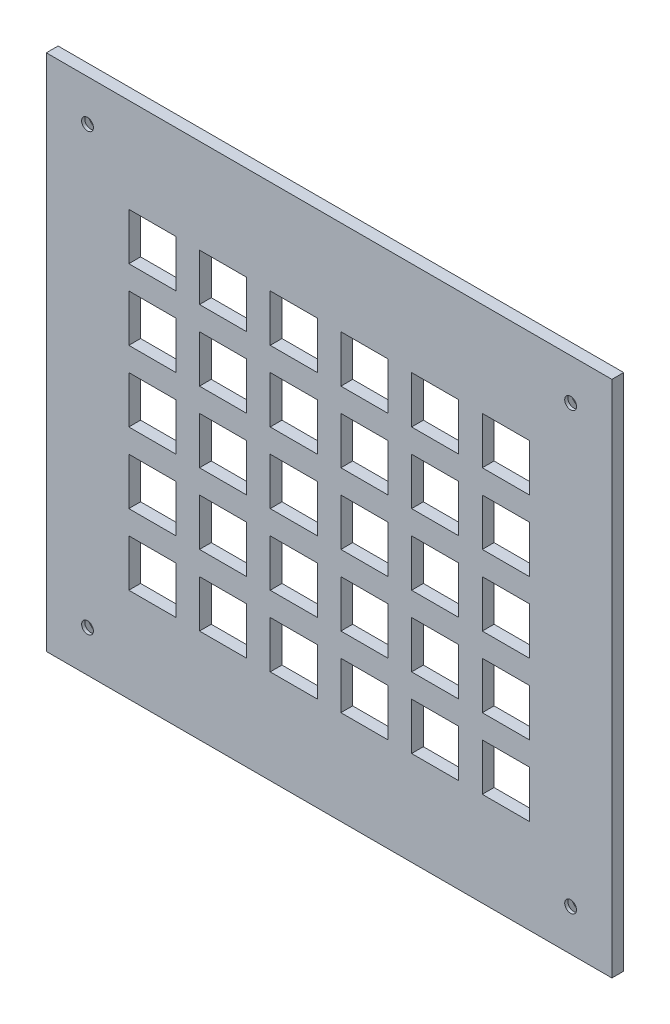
ISO-10303-21;
HEADER;
FILE_DESCRIPTION(('STEP AP214'),'2;1');
FILE_NAME('part.step','',(''),(''),'','','');
FILE_SCHEMA(('AUTOMOTIVE_DESIGN { 1 0 10303 214 1 1 1 1 }'));
ENDSEC;
DATA;
#1=APPLICATION_CONTEXT('core data for automotive mechanical design processes');
#2=APPLICATION_PROTOCOL_DEFINITION('international standard','automotive_design',2000,#1);
#3=PRODUCT_CONTEXT('',#1,'mechanical');
#4=PRODUCT('Part','Part','',(#3));
#5=PRODUCT_RELATED_PRODUCT_CATEGORY('part','',(#4));
#6=PRODUCT_DEFINITION_FORMATION('','',#4);
#7=PRODUCT_DEFINITION_CONTEXT('part definition',#1,'design');
#8=PRODUCT_DEFINITION('design','',#6,#7);
#9=PRODUCT_DEFINITION_SHAPE('','',#8);
#10=(LENGTH_UNIT() NAMED_UNIT(*) SI_UNIT(.MILLI.,.METRE.));
#11=(NAMED_UNIT(*) PLANE_ANGLE_UNIT() SI_UNIT($,.RADIAN.));
#12=(NAMED_UNIT(*) SI_UNIT($,.STERADIAN.) SOLID_ANGLE_UNIT());
#13=UNCERTAINTY_MEASURE_WITH_UNIT(LENGTH_MEASURE(1.E-05),#10,'distance_accuracy_value','');
#14=(GEOMETRIC_REPRESENTATION_CONTEXT(3) GLOBAL_UNCERTAINTY_ASSIGNED_CONTEXT((#13)) GLOBAL_UNIT_ASSIGNED_CONTEXT((#10,
#11,#12)) REPRESENTATION_CONTEXT('',''));
#15=CARTESIAN_POINT('',(0.,0.,0.));
#16=DIRECTION('',(0.,0.,1.));
#17=DIRECTION('',(1.,0.,0.));
#18=AXIS2_PLACEMENT_3D('',#15,#16,#17);
#19=CARTESIAN_POINT('',(76.2,69.85,3.175));
#20=DIRECTION('',(-1.,0.,0.));
#21=DIRECTION('',(0.,-1.,0.));
#22=AXIS2_PLACEMENT_3D('',#19,#20,#21);
#23=PLANE('',#22);
#24=DIRECTION('',(0.,1.,0.));
#25=VECTOR('',#24,1.);
#26=CARTESIAN_POINT('',(76.2,69.85,0.));
#27=LINE('',#26,#25);
#28=CARTESIAN_POINT('',(76.2,-69.85,0.));
#29=VERTEX_POINT('',#28);
#30=CARTESIAN_POINT('',(76.2,69.85,0.));
#31=VERTEX_POINT('',#30);
#32=EDGE_CURVE('E1763',#29,#31,#27,.T.);
#33=ORIENTED_EDGE('',*,*,#32,.T.);
#34=DIRECTION('',(0.,0.,-1.));
#35=VECTOR('',#34,1.);
#36=CARTESIAN_POINT('',(76.2,69.85,3.175));
#37=LINE('',#36,#35);
#38=CARTESIAN_POINT('',(76.2,69.85,3.175));
#39=VERTEX_POINT('',#38);
#40=EDGE_CURVE('E11',#39,#31,#37,.T.);
#41=ORIENTED_EDGE('',*,*,#40,.F.);
#42=DIRECTION('',(0.,1.,0.));
#43=VECTOR('',#42,1.);
#44=CARTESIAN_POINT('',(76.2,69.85,3.175));
#45=LINE('',#44,#43);
#46=CARTESIAN_POINT('',(76.2,-69.85,3.175));
#47=VERTEX_POINT('',#46);
#48=EDGE_CURVE('E1770',#47,#39,#45,.T.);
#49=ORIENTED_EDGE('',*,*,#48,.F.);
#50=DIRECTION('',(0.,0.,-1.));
#51=VECTOR('',#50,1.);
#52=CARTESIAN_POINT('',(76.2,-69.85,3.175));
#53=LINE('',#52,#51);
#54=EDGE_CURVE('E1780',#47,#29,#53,.T.);
#55=ORIENTED_EDGE('',*,*,#54,.T.);
#56=EDGE_LOOP('',(#33,#41,#49,#55));
#57=FACE_BOUND('',#56,.T.);
#58=ADVANCED_FACE('F36',(#57),#23,.F.);
#59=CARTESIAN_POINT('',(-76.2,69.85,3.175));
#60=DIRECTION('',(0.,-1.,0.));
#61=DIRECTION('',(0.,0.,-1.));
#62=AXIS2_PLACEMENT_3D('',#59,#60,#61);
#63=PLANE('',#62);
#64=DIRECTION('',(-1.,0.,0.));
#65=VECTOR('',#64,1.);
#66=CARTESIAN_POINT('',(-76.2,69.85,0.));
#67=LINE('',#66,#65);
#68=CARTESIAN_POINT('',(-76.2,69.85,0.));
#69=VERTEX_POINT('',#68);
#70=EDGE_CURVE('E1783',#31,#69,#67,.T.);
#71=ORIENTED_EDGE('',*,*,#70,.T.);
#72=DIRECTION('',(0.,0.,-1.));
#73=VECTOR('',#72,1.);
#74=CARTESIAN_POINT('',(-76.2,69.85,3.175));
#75=LINE('',#74,#73);
#76=CARTESIAN_POINT('',(-76.2,69.85,3.175));
#77=VERTEX_POINT('',#76);
#78=EDGE_CURVE('E44',#77,#69,#75,.T.);
#79=ORIENTED_EDGE('',*,*,#78,.F.);
#80=DIRECTION('',(-1.,0.,0.));
#81=VECTOR('',#80,1.);
#82=CARTESIAN_POINT('',(-76.2,69.85,3.175));
#83=LINE('',#82,#81);
#84=EDGE_CURVE('E1773',#39,#77,#83,.T.);
#85=ORIENTED_EDGE('',*,*,#84,.F.);
#86=ORIENTED_EDGE('',*,*,#40,.T.);
#87=EDGE_LOOP('',(#71,#79,#85,#86));
#88=FACE_BOUND('',#87,.T.);
#89=ADVANCED_FACE('F1844',(#88),#63,.F.);
#90=CARTESIAN_POINT('',(-76.2,69.85,3.175));
#91=DIRECTION('',(1.,0.,0.));
#92=DIRECTION('',(0.,1.,0.));
#93=AXIS2_PLACEMENT_3D('',#90,#91,#92);
#94=PLANE('',#93);
#95=DIRECTION('',(0.,-1.,0.));
#96=VECTOR('',#95,1.);
#97=CARTESIAN_POINT('',(-76.2,69.85,0.));
#98=LINE('',#97,#96);
#99=CARTESIAN_POINT('',(-76.2,-69.85,0.));
#100=VERTEX_POINT('',#99);
#101=EDGE_CURVE('E1785',#69,#100,#98,.T.);
#102=ORIENTED_EDGE('',*,*,#101,.T.);
#103=DIRECTION('',(0.,0.,-1.));
#104=VECTOR('',#103,1.);
#105=CARTESIAN_POINT('',(-76.2,-69.85,3.175));
#106=LINE('',#105,#104);
#107=CARTESIAN_POINT('',(-76.2,-69.85,3.175));
#108=VERTEX_POINT('',#107);
#109=EDGE_CURVE('E1790',#108,#100,#106,.T.);
#110=ORIENTED_EDGE('',*,*,#109,.F.);
#111=DIRECTION('',(0.,-1.,0.));
#112=VECTOR('',#111,1.);
#113=CARTESIAN_POINT('',(-76.2,69.85,3.175));
#114=LINE('',#113,#112);
#115=EDGE_CURVE('E1776',#77,#108,#114,.T.);
#116=ORIENTED_EDGE('',*,*,#115,.F.);
#117=ORIENTED_EDGE('',*,*,#78,.T.);
#118=EDGE_LOOP('',(#102,#110,#116,#117));
#119=FACE_BOUND('',#118,.T.);
#120=ADVANCED_FACE('F1849',(#119),#94,.F.);
#121=CARTESIAN_POINT('',(-76.2,-69.85,3.175));
#122=DIRECTION('',(0.,1.,0.));
#123=DIRECTION('',(0.,0.,1.));
#124=AXIS2_PLACEMENT_3D('',#121,#122,#123);
#125=PLANE('',#124);
#126=DIRECTION('',(1.,0.,0.));
#127=VECTOR('',#126,1.);
#128=CARTESIAN_POINT('',(-76.2,-69.85,0.));
#129=LINE('',#128,#127);
#130=EDGE_CURVE('E1774',#100,#29,#129,.T.);
#131=ORIENTED_EDGE('',*,*,#130,.T.);
#132=ORIENTED_EDGE('',*,*,#54,.F.);
#133=DIRECTION('',(1.,0.,0.));
#134=VECTOR('',#133,1.);
#135=CARTESIAN_POINT('',(-76.2,-69.85,3.175));
#136=LINE('',#135,#134);
#137=EDGE_CURVE('E1778',#108,#47,#136,.T.);
#138=ORIENTED_EDGE('',*,*,#137,.F.);
#139=ORIENTED_EDGE('',*,*,#109,.T.);
#140=EDGE_LOOP('',(#131,#132,#138,#139));
#141=FACE_BOUND('',#140,.T.);
#142=ADVANCED_FACE('F1865',(#141),#125,.F.);
#143=CARTESIAN_POINT('',(0.,0.,3.175));
#144=DIRECTION('',(0.,0.,1.));
#145=DIRECTION('',(1.,0.,0.));
#146=AXIS2_PLACEMENT_3D('',#143,#144,#145);
#147=PLANE('',#146);
#148=CARTESIAN_POINT('',(-65.1002,58.7502,3.175));
#149=DIRECTION('',(0.,0.,1.));
#150=DIRECTION('',(1.,0.,0.));
#151=AXIS2_PLACEMENT_3D('',#148,#149,#150);
#152=CIRCLE('',#151,1.59051012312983);
#153=CARTESIAN_POINT('',(-63.5096898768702,58.7502,3.175));
#154=VERTEX_POINT('',#153);
#155=EDGE_CURVE('E39',#154,#154,#152,.F.);
#156=ORIENTED_EDGE('',*,*,#155,.T.);
#157=EDGE_LOOP('',(#156));
#158=FACE_BOUND('',#157,.T.);
#159=CARTESIAN_POINT('',(-65.1002,-58.7248,3.175));
#160=DIRECTION('',(0.,0.,1.));
#161=DIRECTION('',(1.,0.,0.));
#162=AXIS2_PLACEMENT_3D('',#159,#160,#161);
#163=CIRCLE('',#162,1.59051012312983);
#164=CARTESIAN_POINT('',(-63.5096898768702,-58.7248,3.175));
#165=VERTEX_POINT('',#164);
#166=EDGE_CURVE('E1801',#165,#165,#163,.F.);
#167=ORIENTED_EDGE('',*,*,#166,.T.);
#168=EDGE_LOOP('',(#167));
#169=FACE_BOUND('',#168,.T.);
#170=CARTESIAN_POINT('',(65.0748,58.7502,3.175));
#171=DIRECTION('',(0.,0.,1.));
#172=DIRECTION('',(1.,0.,0.));
#173=AXIS2_PLACEMENT_3D('',#170,#171,#172);
#174=CIRCLE('',#173,1.59051012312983);
#175=CARTESIAN_POINT('',(66.6653101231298,58.7502,3.175));
#176=VERTEX_POINT('',#175);
#177=EDGE_CURVE('E1797',#176,#176,#174,.F.);
#178=ORIENTED_EDGE('',*,*,#177,.T.);
#179=EDGE_LOOP('',(#178));
#180=FACE_BOUND('',#179,.T.);
#181=CARTESIAN_POINT('',(65.0748,-58.7248,3.175));
#182=DIRECTION('',(0.,0.,1.));
#183=DIRECTION('',(1.,0.,0.));
#184=AXIS2_PLACEMENT_3D('',#181,#182,#183);
#185=CIRCLE('',#184,1.59051012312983);
#186=CARTESIAN_POINT('',(66.6653101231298,-58.7248,3.175));
#187=VERTEX_POINT('',#186);
#188=EDGE_CURVE('E1055',#187,#187,#185,.F.);
#189=ORIENTED_EDGE('',*,*,#188,.T.);
#190=EDGE_LOOP('',(#189));
#191=FACE_BOUND('',#190,.T.);
#192=DIRECTION('',(0.,1.,0.));
#193=VECTOR('',#192,1.);
#194=CARTESIAN_POINT('',(15.8749999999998,25.4000000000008,3.175));
#195=LINE('',#194,#193);
#196=CARTESIAN_POINT('',(15.8749999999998,12.7000000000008,3.175));
#197=VERTEX_POINT('',#196);
#198=CARTESIAN_POINT('',(15.8749999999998,25.4000000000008,3.175));
#199=VERTEX_POINT('',#198);
#200=EDGE_CURVE('E52',#197,#199,#195,.T.);
#201=ORIENTED_EDGE('',*,*,#200,.F.);
#202=DIRECTION('',(1.,0.,0.));
#203=VECTOR('',#202,1.);
#204=CARTESIAN_POINT('',(3.17499999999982,12.7000000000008,3.175));
#205=LINE('',#204,#203);
#206=CARTESIAN_POINT('',(3.17499999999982,12.7000000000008,3.175));
#207=VERTEX_POINT('',#206);
#208=EDGE_CURVE('E1137',#207,#197,#205,.T.);
#209=ORIENTED_EDGE('',*,*,#208,.F.);
#210=DIRECTION('',(0.,-1.,0.));
#211=VECTOR('',#210,1.);
#212=CARTESIAN_POINT('',(3.17499999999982,25.4000000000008,3.175));
#213=LINE('',#212,#211);
#214=CARTESIAN_POINT('',(3.17499999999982,25.4000000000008,3.175));
#215=VERTEX_POINT('',#214);
#216=EDGE_CURVE('E1152',#215,#207,#213,.T.);
#217=ORIENTED_EDGE('',*,*,#216,.F.);
#218=DIRECTION('',(-1.,0.,0.));
#219=VECTOR('',#218,1.);
#220=CARTESIAN_POINT('',(3.17499999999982,25.4000000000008,3.175));
#221=LINE('',#220,#219);
#222=EDGE_CURVE('E1148',#199,#215,#221,.T.);
#223=ORIENTED_EDGE('',*,*,#222,.F.);
#224=EDGE_LOOP('',(#201,#209,#217,#223));
#225=FACE_BOUND('',#224,.T.);
#226=DIRECTION('',(0.,1.,0.));
#227=VECTOR('',#226,1.);
#228=CARTESIAN_POINT('',(34.9249999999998,25.400000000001,3.175));
#229=LINE('',#228,#227);
#230=CARTESIAN_POINT('',(34.9249999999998,12.7000000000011,3.175));
#231=VERTEX_POINT('',#230);
#232=CARTESIAN_POINT('',(34.9249999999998,25.400000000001,3.175));
#233=VERTEX_POINT('',#232);
#234=EDGE_CURVE('E60',#231,#233,#229,.T.);
#235=ORIENTED_EDGE('',*,*,#234,.F.);
#236=DIRECTION('',(1.,0.,0.));
#237=VECTOR('',#236,1.);
#238=CARTESIAN_POINT('',(22.2249999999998,12.700000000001,3.175));
#239=LINE('',#238,#237);
#240=CARTESIAN_POINT('',(22.2249999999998,12.700000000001,3.175));
#241=VERTEX_POINT('',#240);
#242=EDGE_CURVE('E1169',#241,#231,#239,.T.);
#243=ORIENTED_EDGE('',*,*,#242,.F.);
#244=DIRECTION('',(0.,-1.,0.));
#245=VECTOR('',#244,1.);
#246=CARTESIAN_POINT('',(22.2249999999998,25.400000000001,3.175));
#247=LINE('',#246,#245);
#248=CARTESIAN_POINT('',(22.2249999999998,25.400000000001,3.175));
#249=VERTEX_POINT('',#248);
#250=EDGE_CURVE('E1183',#249,#241,#247,.T.);
#251=ORIENTED_EDGE('',*,*,#250,.F.);
#252=DIRECTION('',(-1.,0.,0.));
#253=VECTOR('',#252,1.);
#254=CARTESIAN_POINT('',(22.2249999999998,25.400000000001,3.175));
#255=LINE('',#254,#253);
#256=EDGE_CURVE('E1180',#233,#249,#255,.T.);
#257=ORIENTED_EDGE('',*,*,#256,.F.);
#258=EDGE_LOOP('',(#235,#243,#251,#257));
#259=FACE_BOUND('',#258,.T.);
#260=DIRECTION('',(0.,1.,0.));
#261=VECTOR('',#260,1.);
#262=CARTESIAN_POINT('',(53.9749999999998,25.4000000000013,3.175));
#263=LINE('',#262,#261);
#264=CARTESIAN_POINT('',(53.9749999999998,12.7000000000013,3.175));
#265=VERTEX_POINT('',#264);
#266=CARTESIAN_POINT('',(53.9749999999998,25.4000000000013,3.175));
#267=VERTEX_POINT('',#266);
#268=EDGE_CURVE('E1084',#265,#267,#263,.T.);
#269=ORIENTED_EDGE('',*,*,#268,.F.);
#270=DIRECTION('',(1.,0.,0.));
#271=VECTOR('',#270,1.);
#272=CARTESIAN_POINT('',(41.2749999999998,12.7000000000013,3.175));
#273=LINE('',#272,#271);
#274=CARTESIAN_POINT('',(41.2749999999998,12.7000000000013,3.175));
#275=VERTEX_POINT('',#274);
#276=EDGE_CURVE('E1074',#275,#265,#273,.T.);
#277=ORIENTED_EDGE('',*,*,#276,.F.);
#278=DIRECTION('',(0.,-1.,0.));
#279=VECTOR('',#278,1.);
#280=CARTESIAN_POINT('',(41.2749999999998,25.4000000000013,3.175));
#281=LINE('',#280,#279);
#282=CARTESIAN_POINT('',(41.2749999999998,25.4000000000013,3.175));
#283=VERTEX_POINT('',#282);
#284=EDGE_CURVE('E1090',#283,#275,#281,.T.);
#285=ORIENTED_EDGE('',*,*,#284,.F.);
#286=DIRECTION('',(-1.,0.,0.));
#287=VECTOR('',#286,1.);
#288=CARTESIAN_POINT('',(41.2749999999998,25.4000000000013,3.175));
#289=LINE('',#288,#287);
#290=EDGE_CURVE('E1086',#267,#283,#289,.T.);
#291=ORIENTED_EDGE('',*,*,#290,.F.);
#292=EDGE_LOOP('',(#269,#277,#285,#291));
#293=FACE_BOUND('',#292,.T.);
#294=DIRECTION('',(0.,1.,0.));
#295=VECTOR('',#294,1.);
#296=CARTESIAN_POINT('',(-22.2250000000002,44.4500000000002,3.175));
#297=LINE('',#296,#295);
#298=CARTESIAN_POINT('',(-22.2250000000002,31.7500000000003,3.175));
#299=VERTEX_POINT('',#298);
#300=CARTESIAN_POINT('',(-22.2250000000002,44.4500000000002,3.175));
#301=VERTEX_POINT('',#300);
#302=EDGE_CURVE('E842',#299,#301,#297,.T.);
#303=ORIENTED_EDGE('',*,*,#302,.F.);
#304=DIRECTION('',(1.,0.,0.));
#305=VECTOR('',#304,1.);
#306=CARTESIAN_POINT('',(-34.9250000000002,31.7500000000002,3.175));
#307=LINE('',#306,#305);
#308=CARTESIAN_POINT('',(-34.9250000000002,31.7500000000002,3.175));
#309=VERTEX_POINT('',#308);
#310=EDGE_CURVE('E1107',#309,#299,#307,.T.);
#311=ORIENTED_EDGE('',*,*,#310,.F.);
#312=DIRECTION('',(0.,-1.,0.));
#313=VECTOR('',#312,1.);
#314=CARTESIAN_POINT('',(-34.9250000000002,44.4500000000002,3.175));
#315=LINE('',#314,#313);
#316=CARTESIAN_POINT('',(-34.9250000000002,44.4500000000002,3.175));
#317=VERTEX_POINT('',#316);
#318=EDGE_CURVE('E1121',#317,#309,#315,.T.);
#319=ORIENTED_EDGE('',*,*,#318,.F.);
#320=DIRECTION('',(-1.,0.,0.));
#321=VECTOR('',#320,1.);
#322=CARTESIAN_POINT('',(-34.9250000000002,44.4500000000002,3.175));
#323=LINE('',#322,#321);
#324=EDGE_CURVE('E1118',#301,#317,#323,.T.);
#325=ORIENTED_EDGE('',*,*,#324,.F.);
#326=EDGE_LOOP('',(#303,#311,#319,#325));
#327=FACE_BOUND('',#326,.T.);
#328=DIRECTION('',(0.,1.,0.));
#329=VECTOR('',#328,1.);
#330=CARTESIAN_POINT('',(-3.17500000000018,25.4000000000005,3.175));
#331=LINE('',#330,#329);
#332=CARTESIAN_POINT('',(-3.17500000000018,12.7000000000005,3.175));
#333=VERTEX_POINT('',#332);
#334=CARTESIAN_POINT('',(-3.17500000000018,25.4000000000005,3.175));
#335=VERTEX_POINT('',#334);
#336=EDGE_CURVE('E1159',#333,#335,#331,.T.);
#337=ORIENTED_EDGE('',*,*,#336,.F.);
#338=DIRECTION('',(1.,0.,0.));
#339=VECTOR('',#338,1.);
#340=CARTESIAN_POINT('',(-15.8750000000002,12.7000000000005,3.175));
#341=LINE('',#340,#339);
#342=CARTESIAN_POINT('',(-15.8750000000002,12.7000000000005,3.175));
#343=VERTEX_POINT('',#342);
#344=EDGE_CURVE('E1264',#343,#333,#341,.T.);
#345=ORIENTED_EDGE('',*,*,#344,.F.);
#346=DIRECTION('',(0.,-1.,0.));
#347=VECTOR('',#346,1.);
#348=CARTESIAN_POINT('',(-15.8750000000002,25.4000000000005,3.175));
#349=LINE('',#348,#347);
#350=CARTESIAN_POINT('',(-15.8750000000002,25.4000000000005,3.175));
#351=VERTEX_POINT('',#350);
#352=EDGE_CURVE('E1278',#351,#343,#349,.T.);
#353=ORIENTED_EDGE('',*,*,#352,.F.);
#354=DIRECTION('',(-1.,0.,0.));
#355=VECTOR('',#354,1.);
#356=CARTESIAN_POINT('',(-15.8750000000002,25.4000000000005,3.175));
#357=LINE('',#356,#355);
#358=EDGE_CURVE('E1275',#335,#351,#357,.T.);
#359=ORIENTED_EDGE('',*,*,#358,.F.);
#360=EDGE_LOOP('',(#337,#345,#353,#359));
#361=FACE_BOUND('',#360,.T.);
#362=DIRECTION('',(0.,1.,0.));
#363=VECTOR('',#362,1.);
#364=CARTESIAN_POINT('',(-22.2250000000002,25.4000000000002,3.175));
#365=LINE('',#364,#363);
#366=CARTESIAN_POINT('',(-22.2250000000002,12.7000000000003,3.175));
#367=VERTEX_POINT('',#366);
#368=CARTESIAN_POINT('',(-22.2250000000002,25.4000000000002,3.175));
#369=VERTEX_POINT('',#368);
#370=EDGE_CURVE('E1242',#367,#369,#365,.T.);
#371=ORIENTED_EDGE('',*,*,#370,.F.);
#372=DIRECTION('',(1.,0.,0.));
#373=VECTOR('',#372,1.);
#374=CARTESIAN_POINT('',(-34.9250000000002,12.7000000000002,3.175));
#375=LINE('',#374,#373);
#376=CARTESIAN_POINT('',(-34.9250000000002,12.7000000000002,3.175));
#377=VERTEX_POINT('',#376);
#378=EDGE_CURVE('E1232',#377,#367,#375,.T.);
#379=ORIENTED_EDGE('',*,*,#378,.F.);
#380=DIRECTION('',(0.,-1.,0.));
#381=VECTOR('',#380,1.);
#382=CARTESIAN_POINT('',(-34.9250000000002,25.4000000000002,3.175));
#383=LINE('',#382,#381);
#384=CARTESIAN_POINT('',(-34.9250000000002,25.4000000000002,3.175));
#385=VERTEX_POINT('',#384);
#386=EDGE_CURVE('E1248',#385,#377,#383,.T.);
#387=ORIENTED_EDGE('',*,*,#386,.F.);
#388=DIRECTION('',(-1.,0.,0.));
#389=VECTOR('',#388,1.);
#390=CARTESIAN_POINT('',(-34.9250000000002,25.4000000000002,3.175));
#391=LINE('',#390,#389);
#392=EDGE_CURVE('E1244',#369,#385,#391,.T.);
#393=ORIENTED_EDGE('',*,*,#392,.F.);
#394=EDGE_LOOP('',(#371,#379,#387,#393));
#395=FACE_BOUND('',#394,.T.);
#396=DIRECTION('',(0.,1.,0.));
#397=VECTOR('',#396,1.);
#398=CARTESIAN_POINT('',(53.9749999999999,6.35000000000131,3.175));
#399=LINE('',#398,#397);
#400=CARTESIAN_POINT('',(53.9749999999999,-6.34999999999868,3.175));
#401=VERTEX_POINT('',#400);
#402=CARTESIAN_POINT('',(53.9749999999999,6.35000000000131,3.175));
#403=VERTEX_POINT('',#402);
#404=EDGE_CURVE('E1208',#401,#403,#399,.T.);
#405=ORIENTED_EDGE('',*,*,#404,.F.);
#406=DIRECTION('',(1.,0.,0.));
#407=VECTOR('',#406,1.);
#408=CARTESIAN_POINT('',(41.2749999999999,-6.34999999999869,3.175));
#409=LINE('',#408,#407);
#410=CARTESIAN_POINT('',(41.2749999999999,-6.34999999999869,3.175));
#411=VERTEX_POINT('',#410);
#412=EDGE_CURVE('E1198',#411,#401,#409,.T.);
#413=ORIENTED_EDGE('',*,*,#412,.F.);
#414=DIRECTION('',(0.,-1.,0.));
#415=VECTOR('',#414,1.);
#416=CARTESIAN_POINT('',(41.2749999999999,6.35000000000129,3.175));
#417=LINE('',#416,#415);
#418=CARTESIAN_POINT('',(41.2749999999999,6.35000000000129,3.175));
#419=VERTEX_POINT('',#418);
#420=EDGE_CURVE('E1214',#419,#411,#417,.T.);
#421=ORIENTED_EDGE('',*,*,#420,.F.);
#422=DIRECTION('',(-1.,0.,0.));
#423=VECTOR('',#422,1.);
#424=CARTESIAN_POINT('',(41.2749999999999,6.35000000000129,3.175));
#425=LINE('',#424,#423);
#426=EDGE_CURVE('E1210',#403,#419,#425,.T.);
#427=ORIENTED_EDGE('',*,*,#426,.F.);
#428=EDGE_LOOP('',(#405,#413,#421,#427));
#429=FACE_BOUND('',#428,.T.);
#430=DIRECTION('',(0.,1.,0.));
#431=VECTOR('',#430,1.);
#432=CARTESIAN_POINT('',(-3.17500000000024,44.4500000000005,3.175));
#433=LINE('',#432,#431);
#434=CARTESIAN_POINT('',(-3.17500000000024,31.7500000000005,3.175));
#435=VERTEX_POINT('',#434);
#436=CARTESIAN_POINT('',(-3.17500000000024,44.4500000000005,3.175));
#437=VERTEX_POINT('',#436);
#438=EDGE_CURVE('E805',#435,#437,#433,.T.);
#439=ORIENTED_EDGE('',*,*,#438,.F.);
#440=DIRECTION('',(1.,0.,0.));
#441=VECTOR('',#440,1.);
#442=CARTESIAN_POINT('',(-15.8750000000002,31.7500000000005,3.175));
#443=LINE('',#442,#441);
#444=CARTESIAN_POINT('',(-15.8750000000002,31.7500000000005,3.175));
#445=VERTEX_POINT('',#444);
#446=EDGE_CURVE('E823',#445,#435,#443,.T.);
#447=ORIENTED_EDGE('',*,*,#446,.F.);
#448=DIRECTION('',(0.,-1.,0.));
#449=VECTOR('',#448,1.);
#450=CARTESIAN_POINT('',(-15.8750000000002,44.4500000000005,3.175));
#451=LINE('',#450,#449);
#452=CARTESIAN_POINT('',(-15.8750000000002,44.4500000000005,3.175));
#453=VERTEX_POINT('',#452);
#454=EDGE_CURVE('E826',#453,#445,#451,.T.);
#455=ORIENTED_EDGE('',*,*,#454,.F.);
#456=DIRECTION('',(-1.,0.,0.));
#457=VECTOR('',#456,1.);
#458=CARTESIAN_POINT('',(-15.8750000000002,44.4500000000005,3.175));
#459=LINE('',#458,#457);
#460=EDGE_CURVE('E835',#437,#453,#459,.T.);
#461=ORIENTED_EDGE('',*,*,#460,.F.);
#462=EDGE_LOOP('',(#439,#447,#455,#461));
#463=FACE_BOUND('',#462,.T.);
#464=DIRECTION('',(0.,1.,0.));
#465=VECTOR('',#464,1.);
#466=CARTESIAN_POINT('',(15.8749999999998,44.4500000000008,3.175));
#467=LINE('',#466,#465);
#468=CARTESIAN_POINT('',(15.8749999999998,31.7500000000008,3.175));
#469=VERTEX_POINT('',#468);
#470=CARTESIAN_POINT('',(15.8749999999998,44.4500000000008,3.175));
#471=VERTEX_POINT('',#470);
#472=EDGE_CURVE('E860',#469,#471,#467,.T.);
#473=ORIENTED_EDGE('',*,*,#472,.F.);
#474=DIRECTION('',(1.,0.,0.));
#475=VECTOR('',#474,1.);
#476=CARTESIAN_POINT('',(3.17499999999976,31.7500000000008,3.175));
#477=LINE('',#476,#475);
#478=CARTESIAN_POINT('',(3.17499999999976,31.7500000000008,3.175));
#479=VERTEX_POINT('',#478);
#480=EDGE_CURVE('E850',#479,#469,#477,.T.);
#481=ORIENTED_EDGE('',*,*,#480,.F.);
#482=DIRECTION('',(0.,-1.,0.));
#483=VECTOR('',#482,1.);
#484=CARTESIAN_POINT('',(3.17499999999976,44.4500000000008,3.175));
#485=LINE('',#484,#483);
#486=CARTESIAN_POINT('',(3.17499999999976,44.4500000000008,3.175));
#487=VERTEX_POINT('',#486);
#488=EDGE_CURVE('E866',#487,#479,#485,.T.);
#489=ORIENTED_EDGE('',*,*,#488,.F.);
#490=DIRECTION('',(-1.,0.,0.));
#491=VECTOR('',#490,1.);
#492=CARTESIAN_POINT('',(3.17499999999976,44.4500000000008,3.175));
#493=LINE('',#492,#491);
#494=EDGE_CURVE('E862',#471,#487,#493,.T.);
#495=ORIENTED_EDGE('',*,*,#494,.F.);
#496=EDGE_LOOP('',(#473,#481,#489,#495));
#497=FACE_BOUND('',#496,.T.);
#498=DIRECTION('',(0.,1.,0.));
#499=VECTOR('',#498,1.);
#500=CARTESIAN_POINT('',(34.9249999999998,44.450000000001,3.175));
#501=LINE('',#500,#499);
#502=CARTESIAN_POINT('',(34.9249999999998,31.7500000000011,3.175));
#503=VERTEX_POINT('',#502);
#504=CARTESIAN_POINT('',(34.9249999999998,44.450000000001,3.175));
#505=VERTEX_POINT('',#504);
#506=EDGE_CURVE('E892',#503,#505,#501,.T.);
#507=ORIENTED_EDGE('',*,*,#506,.F.);
#508=DIRECTION('',(1.,0.,0.));
#509=VECTOR('',#508,1.);
#510=CARTESIAN_POINT('',(22.2249999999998,31.750000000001,3.175));
#511=LINE('',#510,#509);
#512=CARTESIAN_POINT('',(22.2249999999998,31.750000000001,3.175));
#513=VERTEX_POINT('',#512);
#514=EDGE_CURVE('E882',#513,#503,#511,.T.);
#515=ORIENTED_EDGE('',*,*,#514,.F.);
#516=DIRECTION('',(0.,-1.,0.));
#517=VECTOR('',#516,1.);
#518=CARTESIAN_POINT('',(22.2249999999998,44.450000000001,3.175));
#519=LINE('',#518,#517);
#520=CARTESIAN_POINT('',(22.2249999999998,44.450000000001,3.175));
#521=VERTEX_POINT('',#520);
#522=EDGE_CURVE('E898',#521,#513,#519,.T.);
#523=ORIENTED_EDGE('',*,*,#522,.F.);
#524=DIRECTION('',(-1.,0.,0.));
#525=VECTOR('',#524,1.);
#526=CARTESIAN_POINT('',(22.2249999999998,44.450000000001,3.175));
#527=LINE('',#526,#525);
#528=EDGE_CURVE('E894',#505,#521,#527,.T.);
#529=ORIENTED_EDGE('',*,*,#528,.F.);
#530=EDGE_LOOP('',(#507,#515,#523,#529));
#531=FACE_BOUND('',#530,.T.);
#532=DIRECTION('',(0.,1.,0.));
#533=VECTOR('',#532,1.);
#534=CARTESIAN_POINT('',(53.9749999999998,44.4500000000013,3.175));
#535=LINE('',#534,#533);
#536=CARTESIAN_POINT('',(53.9749999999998,31.7500000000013,3.175));
#537=VERTEX_POINT('',#536);
#538=CARTESIAN_POINT('',(53.9749999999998,44.4500000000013,3.175));
#539=VERTEX_POINT('',#538);
#540=EDGE_CURVE('E924',#537,#539,#535,.T.);
#541=ORIENTED_EDGE('',*,*,#540,.F.);
#542=DIRECTION('',(1.,0.,0.));
#543=VECTOR('',#542,1.);
#544=CARTESIAN_POINT('',(41.2749999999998,31.7500000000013,3.175));
#545=LINE('',#544,#543);
#546=CARTESIAN_POINT('',(41.2749999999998,31.7500000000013,3.175));
#547=VERTEX_POINT('',#546);
#548=EDGE_CURVE('E914',#547,#537,#545,.T.);
#549=ORIENTED_EDGE('',*,*,#548,.F.);
#550=DIRECTION('',(0.,-1.,0.));
#551=VECTOR('',#550,1.);
#552=CARTESIAN_POINT('',(41.2749999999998,44.4500000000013,3.175));
#553=LINE('',#552,#551);
#554=CARTESIAN_POINT('',(41.2749999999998,44.4500000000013,3.175));
#555=VERTEX_POINT('',#554);
#556=EDGE_CURVE('E930',#555,#547,#553,.T.);
#557=ORIENTED_EDGE('',*,*,#556,.F.);
#558=DIRECTION('',(-1.,0.,0.));
#559=VECTOR('',#558,1.);
#560=CARTESIAN_POINT('',(41.2749999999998,44.4500000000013,3.175));
#561=LINE('',#560,#559);
#562=EDGE_CURVE('E926',#539,#555,#561,.T.);
#563=ORIENTED_EDGE('',*,*,#562,.F.);
#564=EDGE_LOOP('',(#541,#549,#557,#563));
#565=FACE_BOUND('',#564,.T.);
#566=DIRECTION('',(0.,1.,0.));
#567=VECTOR('',#566,1.);
#568=CARTESIAN_POINT('',(-41.275,-12.7,3.175));
#569=LINE('',#568,#567);
#570=CARTESIAN_POINT('',(-41.275,-25.4,3.175));
#571=VERTEX_POINT('',#570);
#572=CARTESIAN_POINT('',(-41.275,-12.7,3.175));
#573=VERTEX_POINT('',#572);
#574=EDGE_CURVE('E956',#571,#573,#569,.T.);
#575=ORIENTED_EDGE('',*,*,#574,.F.);
#576=DIRECTION('',(1.,0.,0.));
#577=VECTOR('',#576,1.);
#578=CARTESIAN_POINT('',(-53.9750000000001,-25.4,3.175));
#579=LINE('',#578,#577);
#580=CARTESIAN_POINT('',(-53.9750000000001,-25.4,3.175));
#581=VERTEX_POINT('',#580);
#582=EDGE_CURVE('E946',#581,#571,#579,.T.);
#583=ORIENTED_EDGE('',*,*,#582,.F.);
#584=DIRECTION('',(0.,-1.,0.));
#585=VECTOR('',#584,1.);
#586=CARTESIAN_POINT('',(-53.9750000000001,-12.7,3.175));
#587=LINE('',#586,#585);
#588=CARTESIAN_POINT('',(-53.9750000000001,-12.7,3.175));
#589=VERTEX_POINT('',#588);
#590=EDGE_CURVE('E962',#589,#581,#587,.T.);
#591=ORIENTED_EDGE('',*,*,#590,.F.);
#592=DIRECTION('',(-1.,0.,0.));
#593=VECTOR('',#592,1.);
#594=CARTESIAN_POINT('',(-53.9750000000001,-12.7,3.175));
#595=LINE('',#594,#593);
#596=EDGE_CURVE('E958',#573,#589,#595,.T.);
#597=ORIENTED_EDGE('',*,*,#596,.F.);
#598=EDGE_LOOP('',(#575,#583,#591,#597));
#599=FACE_BOUND('',#598,.T.);
#600=DIRECTION('',(0.,1.,0.));
#601=VECTOR('',#600,1.);
#602=CARTESIAN_POINT('',(-41.2750000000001,6.34999999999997,3.175));
#603=LINE('',#602,#601);
#604=CARTESIAN_POINT('',(-41.2750000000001,-6.35000000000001,3.175));
#605=VERTEX_POINT('',#604);
#606=CARTESIAN_POINT('',(-41.2750000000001,6.34999999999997,3.175));
#607=VERTEX_POINT('',#606);
#608=EDGE_CURVE('E988',#605,#607,#603,.T.);
#609=ORIENTED_EDGE('',*,*,#608,.F.);
#610=DIRECTION('',(1.,0.,0.));
#611=VECTOR('',#610,1.);
#612=CARTESIAN_POINT('',(-53.9750000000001,-6.35000000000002,3.175));
#613=LINE('',#612,#611);
#614=CARTESIAN_POINT('',(-53.9750000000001,-6.35000000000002,3.175));
#615=VERTEX_POINT('',#614);
#616=EDGE_CURVE('E978',#615,#605,#613,.T.);
#617=ORIENTED_EDGE('',*,*,#616,.F.);
#618=DIRECTION('',(0.,-1.,0.));
#619=VECTOR('',#618,1.);
#620=CARTESIAN_POINT('',(-53.9750000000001,6.34999999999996,3.175));
#621=LINE('',#620,#619);
#622=CARTESIAN_POINT('',(-53.9750000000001,6.34999999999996,3.175));
#623=VERTEX_POINT('',#622);
#624=EDGE_CURVE('E994',#623,#615,#621,.T.);
#625=ORIENTED_EDGE('',*,*,#624,.F.);
#626=DIRECTION('',(-1.,0.,0.));
#627=VECTOR('',#626,1.);
#628=CARTESIAN_POINT('',(-53.9750000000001,6.34999999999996,3.175));
#629=LINE('',#628,#627);
#630=EDGE_CURVE('E990',#607,#623,#629,.T.);
#631=ORIENTED_EDGE('',*,*,#630,.F.);
#632=EDGE_LOOP('',(#609,#617,#625,#631));
#633=FACE_BOUND('',#632,.T.);
#634=DIRECTION('',(0.,1.,0.));
#635=VECTOR('',#634,1.);
#636=CARTESIAN_POINT('',(-41.2750000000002,25.4,3.175));
#637=LINE('',#636,#635);
#638=CARTESIAN_POINT('',(-41.2750000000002,12.7,3.175));
#639=VERTEX_POINT('',#638);
#640=CARTESIAN_POINT('',(-41.2750000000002,25.4,3.175));
#641=VERTEX_POINT('',#640);
#642=EDGE_CURVE('E1020',#639,#641,#637,.T.);
#643=ORIENTED_EDGE('',*,*,#642,.F.);
#644=DIRECTION('',(1.,0.,0.));
#645=VECTOR('',#644,1.);
#646=CARTESIAN_POINT('',(-53.9750000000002,12.7,3.175));
#647=LINE('',#646,#645);
#648=CARTESIAN_POINT('',(-53.9750000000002,12.7,3.175));
#649=VERTEX_POINT('',#648);
#650=EDGE_CURVE('E1010',#649,#639,#647,.T.);
#651=ORIENTED_EDGE('',*,*,#650,.F.);
#652=DIRECTION('',(0.,-1.,0.));
#653=VECTOR('',#652,1.);
#654=CARTESIAN_POINT('',(-53.9750000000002,25.4,3.175));
#655=LINE('',#654,#653);
#656=CARTESIAN_POINT('',(-53.9750000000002,25.4,3.175));
#657=VERTEX_POINT('',#656);
#658=EDGE_CURVE('E1026',#657,#649,#655,.T.);
#659=ORIENTED_EDGE('',*,*,#658,.F.);
#660=DIRECTION('',(-1.,0.,0.));
#661=VECTOR('',#660,1.);
#662=CARTESIAN_POINT('',(-53.9750000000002,25.4,3.175));
#663=LINE('',#662,#661);
#664=EDGE_CURVE('E1022',#641,#657,#663,.T.);
#665=ORIENTED_EDGE('',*,*,#664,.F.);
#666=EDGE_LOOP('',(#643,#651,#659,#665));
#667=FACE_BOUND('',#666,.T.);
#668=DIRECTION('',(0.,1.,0.));
#669=VECTOR('',#668,1.);
#670=CARTESIAN_POINT('',(-41.2750000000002,44.45,3.175));
#671=LINE('',#670,#669);
#672=CARTESIAN_POINT('',(-41.2750000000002,31.75,3.175));
#673=VERTEX_POINT('',#672);
#674=CARTESIAN_POINT('',(-41.2750000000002,44.45,3.175));
#675=VERTEX_POINT('',#674);
#676=EDGE_CURVE('E1052',#673,#675,#671,.T.);
#677=ORIENTED_EDGE('',*,*,#676,.F.);
#678=DIRECTION('',(1.,0.,0.));
#679=VECTOR('',#678,1.);
#680=CARTESIAN_POINT('',(-53.9750000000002,31.75,3.175));
#681=LINE('',#680,#679);
#682=CARTESIAN_POINT('',(-53.9750000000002,31.75,3.175));
#683=VERTEX_POINT('',#682);
#684=EDGE_CURVE('E1042',#683,#673,#681,.T.);
#685=ORIENTED_EDGE('',*,*,#684,.F.);
#686=DIRECTION('',(0.,-1.,0.));
#687=VECTOR('',#686,1.);
#688=CARTESIAN_POINT('',(-53.9750000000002,44.45,3.175));
#689=LINE('',#688,#687);
#690=CARTESIAN_POINT('',(-53.9750000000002,44.45,3.175));
#691=VERTEX_POINT('',#690);
#692=EDGE_CURVE('E1058',#691,#683,#689,.T.);
#693=ORIENTED_EDGE('',*,*,#692,.F.);
#694=DIRECTION('',(-1.,0.,0.));
#695=VECTOR('',#694,1.);
#696=CARTESIAN_POINT('',(-53.9750000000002,44.45,3.175));
#697=LINE('',#696,#695);
#698=EDGE_CURVE('E1054',#675,#691,#697,.T.);
#699=ORIENTED_EDGE('',*,*,#698,.F.);
#700=EDGE_LOOP('',(#677,#685,#693,#699));
#701=FACE_BOUND('',#700,.T.);
#702=DIRECTION('',(0.,1.,0.));
#703=VECTOR('',#702,1.);
#704=CARTESIAN_POINT('',(-3.17500000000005,-12.6999999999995,3.175));
#705=LINE('',#704,#703);
#706=CARTESIAN_POINT('',(-3.17500000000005,-25.3999999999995,3.175));
#707=VERTEX_POINT('',#706);
#708=CARTESIAN_POINT('',(-3.17500000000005,-12.6999999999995,3.175));
#709=VERTEX_POINT('',#708);
#710=EDGE_CURVE('E1317',#707,#709,#705,.T.);
#711=ORIENTED_EDGE('',*,*,#710,.F.);
#712=DIRECTION('',(1.,0.,0.));
#713=VECTOR('',#712,1.);
#714=CARTESIAN_POINT('',(-15.875,-25.3999999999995,3.175));
#715=LINE('',#714,#713);
#716=CARTESIAN_POINT('',(-15.875,-25.3999999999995,3.175));
#717=VERTEX_POINT('',#716);
#718=EDGE_CURVE('E1616',#717,#707,#715,.T.);
#719=ORIENTED_EDGE('',*,*,#718,.F.);
#720=DIRECTION('',(0.,-1.,0.));
#721=VECTOR('',#720,1.);
#722=CARTESIAN_POINT('',(-15.875,-12.6999999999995,3.175));
#723=LINE('',#722,#721);
#724=CARTESIAN_POINT('',(-15.875,-12.6999999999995,3.175));
#725=VERTEX_POINT('',#724);
#726=EDGE_CURVE('E1630',#725,#717,#723,.T.);
#727=ORIENTED_EDGE('',*,*,#726,.F.);
#728=DIRECTION('',(-1.,0.,0.));
#729=VECTOR('',#728,1.);
#730=CARTESIAN_POINT('',(-15.875,-12.6999999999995,3.175));
#731=LINE('',#730,#729);
#732=EDGE_CURVE('E1627',#709,#725,#731,.T.);
#733=ORIENTED_EDGE('',*,*,#732,.F.);
#734=EDGE_LOOP('',(#711,#719,#727,#733));
#735=FACE_BOUND('',#734,.T.);
#736=DIRECTION('',(0.,1.,0.));
#737=VECTOR('',#736,1.);
#738=CARTESIAN_POINT('',(-22.225,-12.6999999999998,3.175));
#739=LINE('',#738,#737);
#740=CARTESIAN_POINT('',(-22.225,-25.3999999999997,3.175));
#741=VERTEX_POINT('',#740);
#742=CARTESIAN_POINT('',(-22.225,-12.6999999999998,3.175));
#743=VERTEX_POINT('',#742);
#744=EDGE_CURVE('E1594',#741,#743,#739,.T.);
#745=ORIENTED_EDGE('',*,*,#744,.F.);
#746=DIRECTION('',(1.,0.,0.));
#747=VECTOR('',#746,1.);
#748=CARTESIAN_POINT('',(-34.925,-25.3999999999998,3.175));
#749=LINE('',#748,#747);
#750=CARTESIAN_POINT('',(-34.925,-25.3999999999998,3.175));
#751=VERTEX_POINT('',#750);
#752=EDGE_CURVE('E1584',#751,#741,#749,.T.);
#753=ORIENTED_EDGE('',*,*,#752,.F.);
#754=DIRECTION('',(0.,-1.,0.));
#755=VECTOR('',#754,1.);
#756=CARTESIAN_POINT('',(-34.925,-12.6999999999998,3.175));
#757=LINE('',#756,#755);
#758=CARTESIAN_POINT('',(-34.925,-12.6999999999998,3.175));
#759=VERTEX_POINT('',#758);
#760=EDGE_CURVE('E1600',#759,#751,#757,.T.);
#761=ORIENTED_EDGE('',*,*,#760,.F.);
#762=DIRECTION('',(-1.,0.,0.));
#763=VECTOR('',#762,1.);
#764=CARTESIAN_POINT('',(-34.925,-12.6999999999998,3.175));
#765=LINE('',#764,#763);
#766=EDGE_CURVE('E1596',#743,#759,#765,.T.);
#767=ORIENTED_EDGE('',*,*,#766,.F.);
#768=EDGE_LOOP('',(#745,#753,#761,#767));
#769=FACE_BOUND('',#768,.T.);
#770=DIRECTION('',(0.,1.,0.));
#771=VECTOR('',#770,1.);
#772=CARTESIAN_POINT('',(53.975,-31.7499999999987,3.175));
#773=LINE('',#772,#771);
#774=CARTESIAN_POINT('',(53.975,-44.4499999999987,3.175));
#775=VERTEX_POINT('',#774);
#776=CARTESIAN_POINT('',(53.975,-31.7499999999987,3.175));
#777=VERTEX_POINT('',#776);
#778=EDGE_CURVE('E1562',#775,#777,#773,.T.);
#779=ORIENTED_EDGE('',*,*,#778,.F.);
#780=DIRECTION('',(1.,0.,0.));
#781=VECTOR('',#780,1.);
#782=CARTESIAN_POINT('',(41.275,-44.4499999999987,3.175));
#783=LINE('',#782,#781);
#784=CARTESIAN_POINT('',(41.275,-44.4499999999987,3.175));
#785=VERTEX_POINT('',#784);
#786=EDGE_CURVE('E1552',#785,#775,#783,.T.);
#787=ORIENTED_EDGE('',*,*,#786,.F.);
#788=DIRECTION('',(0.,-1.,0.));
#789=VECTOR('',#788,1.);
#790=CARTESIAN_POINT('',(41.275,-31.7499999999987,3.175));
#791=LINE('',#790,#789);
#792=CARTESIAN_POINT('',(41.275,-31.7499999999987,3.175));
#793=VERTEX_POINT('',#792);
#794=EDGE_CURVE('E1568',#793,#785,#791,.T.);
#795=ORIENTED_EDGE('',*,*,#794,.F.);
#796=DIRECTION('',(-1.,0.,0.));
#797=VECTOR('',#796,1.);
#798=CARTESIAN_POINT('',(41.275,-31.7499999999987,3.175));
#799=LINE('',#798,#797);
#800=EDGE_CURVE('E1564',#777,#793,#799,.T.);
#801=ORIENTED_EDGE('',*,*,#800,.F.);
#802=EDGE_LOOP('',(#779,#787,#795,#801));
#803=FACE_BOUND('',#802,.T.);
#804=DIRECTION('',(0.,1.,0.));
#805=VECTOR('',#804,1.);
#806=CARTESIAN_POINT('',(34.925,-31.749999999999,3.175));
#807=LINE('',#806,#805);
#808=CARTESIAN_POINT('',(34.925,-44.449999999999,3.175));
#809=VERTEX_POINT('',#808);
#810=CARTESIAN_POINT('',(34.925,-31.749999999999,3.175));
#811=VERTEX_POINT('',#810);
#812=EDGE_CURVE('E1528',#809,#811,#807,.T.);
#813=ORIENTED_EDGE('',*,*,#812,.F.);
#814=DIRECTION('',(1.,0.,0.));
#815=VECTOR('',#814,1.);
#816=CARTESIAN_POINT('',(22.225,-44.449999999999,3.175));
#817=LINE('',#816,#815);
#818=CARTESIAN_POINT('',(22.225,-44.449999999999,3.175));
#819=VERTEX_POINT('',#818);
#820=EDGE_CURVE('E1518',#819,#809,#817,.T.);
#821=ORIENTED_EDGE('',*,*,#820,.F.);
#822=DIRECTION('',(0.,-1.,0.));
#823=VECTOR('',#822,1.);
#824=CARTESIAN_POINT('',(22.225,-31.749999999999,3.175));
#825=LINE('',#824,#823);
#826=CARTESIAN_POINT('',(22.225,-31.749999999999,3.175));
#827=VERTEX_POINT('',#826);
#828=EDGE_CURVE('E1534',#827,#819,#825,.T.);
#829=ORIENTED_EDGE('',*,*,#828,.F.);
#830=DIRECTION('',(-1.,0.,0.));
#831=VECTOR('',#830,1.);
#832=CARTESIAN_POINT('',(22.225,-31.749999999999,3.175));
#833=LINE('',#832,#831);
#834=EDGE_CURVE('E1530',#811,#827,#833,.T.);
#835=ORIENTED_EDGE('',*,*,#834,.F.);
#836=EDGE_LOOP('',(#813,#821,#829,#835));
#837=FACE_BOUND('',#836,.T.);
#838=DIRECTION('',(0.,1.,0.));
#839=VECTOR('',#838,1.);
#840=CARTESIAN_POINT('',(15.875,-31.7499999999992,3.175));
#841=LINE('',#840,#839);
#842=CARTESIAN_POINT('',(15.875,-44.4499999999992,3.175));
#843=VERTEX_POINT('',#842);
#844=CARTESIAN_POINT('',(15.875,-31.7499999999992,3.175));
#845=VERTEX_POINT('',#844);
#846=EDGE_CURVE('E1541',#843,#845,#841,.T.);
#847=ORIENTED_EDGE('',*,*,#846,.F.);
#848=DIRECTION('',(1.,0.,0.));
#849=VECTOR('',#848,1.);
#850=CARTESIAN_POINT('',(3.17500000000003,-44.4499999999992,3.175));
#851=LINE('',#850,#849);
#852=CARTESIAN_POINT('',(3.17500000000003,-44.4499999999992,3.175));
#853=VERTEX_POINT('',#852);
#854=EDGE_CURVE('E1712',#853,#843,#851,.T.);
#855=ORIENTED_EDGE('',*,*,#854,.F.);
#856=DIRECTION('',(0.,-1.,0.));
#857=VECTOR('',#856,1.);
#858=CARTESIAN_POINT('',(3.17500000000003,-31.7499999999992,3.175));
#859=LINE('',#858,#857);
#860=CARTESIAN_POINT('',(3.17500000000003,-31.7499999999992,3.175));
#861=VERTEX_POINT('',#860);
#862=EDGE_CURVE('E1726',#861,#853,#859,.T.);
#863=ORIENTED_EDGE('',*,*,#862,.F.);
#864=DIRECTION('',(-1.,0.,0.));
#865=VECTOR('',#864,1.);
#866=CARTESIAN_POINT('',(3.17500000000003,-31.7499999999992,3.175));
#867=LINE('',#866,#865);
#868=EDGE_CURVE('E1723',#845,#861,#867,.T.);
#869=ORIENTED_EDGE('',*,*,#868,.F.);
#870=EDGE_LOOP('',(#847,#855,#863,#869));
#871=FACE_BOUND('',#870,.T.);
#872=DIRECTION('',(0.,1.,0.));
#873=VECTOR('',#872,1.);
#874=CARTESIAN_POINT('',(-3.17499999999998,-31.7499999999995,3.175));
#875=LINE('',#874,#873);
#876=CARTESIAN_POINT('',(-3.17499999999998,-44.4499999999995,3.175));
#877=VERTEX_POINT('',#876);
#878=CARTESIAN_POINT('',(-3.17499999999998,-31.7499999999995,3.175));
#879=VERTEX_POINT('',#878);
#880=EDGE_CURVE('E1690',#877,#879,#875,.T.);
#881=ORIENTED_EDGE('',*,*,#880,.F.);
#882=DIRECTION('',(1.,0.,0.));
#883=VECTOR('',#882,1.);
#884=CARTESIAN_POINT('',(-15.875,-44.4499999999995,3.175));
#885=LINE('',#884,#883);
#886=CARTESIAN_POINT('',(-15.875,-44.4499999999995,3.175));
#887=VERTEX_POINT('',#886);
#888=EDGE_CURVE('E1680',#887,#877,#885,.T.);
#889=ORIENTED_EDGE('',*,*,#888,.F.);
#890=DIRECTION('',(0.,-1.,0.));
#891=VECTOR('',#890,1.);
#892=CARTESIAN_POINT('',(-15.875,-31.7499999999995,3.175));
#893=LINE('',#892,#891);
#894=CARTESIAN_POINT('',(-15.875,-31.7499999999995,3.175));
#895=VERTEX_POINT('',#894);
#896=EDGE_CURVE('E1696',#895,#887,#893,.T.);
#897=ORIENTED_EDGE('',*,*,#896,.F.);
#898=DIRECTION('',(-1.,0.,0.));
#899=VECTOR('',#898,1.);
#900=CARTESIAN_POINT('',(-15.875,-31.7499999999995,3.175));
#901=LINE('',#900,#899);
#902=EDGE_CURVE('E1692',#879,#895,#901,.T.);
#903=ORIENTED_EDGE('',*,*,#902,.F.);
#904=EDGE_LOOP('',(#881,#889,#897,#903));
#905=FACE_BOUND('',#904,.T.);
#906=DIRECTION('',(0.,1.,0.));
#907=VECTOR('',#906,1.);
#908=CARTESIAN_POINT('',(-22.225,-31.7499999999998,3.175));
#909=LINE('',#908,#907);
#910=CARTESIAN_POINT('',(-22.225,-44.4499999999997,3.175));
#911=VERTEX_POINT('',#910);
#912=CARTESIAN_POINT('',(-22.225,-31.7499999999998,3.175));
#913=VERTEX_POINT('',#912);
#914=EDGE_CURVE('E1656',#911,#913,#909,.T.);
#915=ORIENTED_EDGE('',*,*,#914,.F.);
#916=DIRECTION('',(1.,0.,0.));
#917=VECTOR('',#916,1.);
#918=CARTESIAN_POINT('',(-34.925,-44.4499999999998,3.175));
#919=LINE('',#918,#917);
#920=CARTESIAN_POINT('',(-34.925,-44.4499999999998,3.175));
#921=VERTEX_POINT('',#920);
#922=EDGE_CURVE('E1646',#921,#911,#919,.T.);
#923=ORIENTED_EDGE('',*,*,#922,.F.);
#924=DIRECTION('',(0.,-1.,0.));
#925=VECTOR('',#924,1.);
#926=CARTESIAN_POINT('',(-34.925,-31.7499999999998,3.175));
#927=LINE('',#926,#925);
#928=CARTESIAN_POINT('',(-34.925,-31.7499999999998,3.175));
#929=VERTEX_POINT('',#928);
#930=EDGE_CURVE('E1662',#929,#921,#927,.T.);
#931=ORIENTED_EDGE('',*,*,#930,.F.);
#932=DIRECTION('',(-1.,0.,0.));
#933=VECTOR('',#932,1.);
#934=CARTESIAN_POINT('',(-34.925,-31.7499999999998,3.175));
#935=LINE('',#934,#933);
#936=EDGE_CURVE('E1658',#913,#929,#935,.T.);
#937=ORIENTED_EDGE('',*,*,#936,.F.);
#938=EDGE_LOOP('',(#915,#923,#931,#937));
#939=FACE_BOUND('',#938,.T.);
#940=DIRECTION('',(0.,1.,0.));
#941=VECTOR('',#940,1.);
#942=CARTESIAN_POINT('',(15.875,-12.6999999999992,3.175));
#943=LINE('',#942,#941);
#944=CARTESIAN_POINT('',(15.875,-25.3999999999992,3.175));
#945=VERTEX_POINT('',#944);
#946=CARTESIAN_POINT('',(15.875,-12.6999999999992,3.175));
#947=VERTEX_POINT('',#946);
#948=EDGE_CURVE('E1304',#945,#947,#943,.T.);
#949=ORIENTED_EDGE('',*,*,#948,.F.);
#950=DIRECTION('',(1.,0.,0.));
#951=VECTOR('',#950,1.);
#952=CARTESIAN_POINT('',(3.17499999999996,-25.3999999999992,3.175));
#953=LINE('',#952,#951);
#954=CARTESIAN_POINT('',(3.17499999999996,-25.3999999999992,3.175));
#955=VERTEX_POINT('',#954);
#956=EDGE_CURVE('E1294',#955,#945,#953,.T.);
#957=ORIENTED_EDGE('',*,*,#956,.F.);
#958=DIRECTION('',(0.,-1.,0.));
#959=VECTOR('',#958,1.);
#960=CARTESIAN_POINT('',(3.17499999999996,-12.6999999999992,3.175));
#961=LINE('',#960,#959);
#962=CARTESIAN_POINT('',(3.17499999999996,-12.6999999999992,3.175));
#963=VERTEX_POINT('',#962);
#964=EDGE_CURVE('E1310',#963,#955,#961,.T.);
#965=ORIENTED_EDGE('',*,*,#964,.F.);
#966=DIRECTION('',(-1.,0.,0.));
#967=VECTOR('',#966,1.);
#968=CARTESIAN_POINT('',(3.17499999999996,-12.6999999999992,3.175));
#969=LINE('',#968,#967);
#970=EDGE_CURVE('E1306',#947,#963,#969,.T.);
#971=ORIENTED_EDGE('',*,*,#970,.F.);
#972=EDGE_LOOP('',(#949,#957,#965,#971));
#973=FACE_BOUND('',#972,.T.);
#974=DIRECTION('',(0.,1.,0.));
#975=VECTOR('',#974,1.);
#976=CARTESIAN_POINT('',(34.925,-12.699999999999,3.175));
#977=LINE('',#976,#975);
#978=CARTESIAN_POINT('',(34.925,-25.3999999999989,3.175));
#979=VERTEX_POINT('',#978);
#980=CARTESIAN_POINT('',(34.925,-12.699999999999,3.175));
#981=VERTEX_POINT('',#980);
#982=EDGE_CURVE('E1338',#979,#981,#977,.T.);
#983=ORIENTED_EDGE('',*,*,#982,.F.);
#984=DIRECTION('',(1.,0.,0.));
#985=VECTOR('',#984,1.);
#986=CARTESIAN_POINT('',(22.225,-25.399999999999,3.175));
#987=LINE('',#986,#985);
#988=CARTESIAN_POINT('',(22.225,-25.399999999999,3.175));
#989=VERTEX_POINT('',#988);
#990=EDGE_CURVE('E1328',#989,#979,#987,.T.);
#991=ORIENTED_EDGE('',*,*,#990,.F.);
#992=DIRECTION('',(0.,-1.,0.));
#993=VECTOR('',#992,1.);
#994=CARTESIAN_POINT('',(22.225,-12.699999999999,3.175));
#995=LINE('',#994,#993);
#996=CARTESIAN_POINT('',(22.225,-12.699999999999,3.175));
#997=VERTEX_POINT('',#996);
#998=EDGE_CURVE('E1344',#997,#989,#995,.T.);
#999=ORIENTED_EDGE('',*,*,#998,.F.);
#1000=DIRECTION('',(-1.,0.,0.));
#1001=VECTOR('',#1000,1.);
#1002=CARTESIAN_POINT('',(22.225,-12.699999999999,3.175));
#1003=LINE('',#1002,#1001);
#1004=EDGE_CURVE('E1340',#981,#997,#1003,.T.);
#1005=ORIENTED_EDGE('',*,*,#1004,.F.);
#1006=EDGE_LOOP('',(#983,#991,#999,#1005));
#1007=FACE_BOUND('',#1006,.T.);
#1008=DIRECTION('',(0.,1.,0.));
#1009=VECTOR('',#1008,1.);
#1010=CARTESIAN_POINT('',(53.975,-12.6999999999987,3.175));
#1011=LINE('',#1010,#1009);
#1012=CARTESIAN_POINT('',(53.975,-25.3999999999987,3.175));
#1013=VERTEX_POINT('',#1012);
#1014=CARTESIAN_POINT('',(53.975,-12.6999999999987,3.175));
#1015=VERTEX_POINT('',#1014);
#1016=EDGE_CURVE('E1370',#1013,#1015,#1011,.T.);
#1017=ORIENTED_EDGE('',*,*,#1016,.F.);
#1018=DIRECTION('',(1.,0.,0.));
#1019=VECTOR('',#1018,1.);
#1020=CARTESIAN_POINT('',(41.2749999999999,-25.3999999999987,3.175));
#1021=LINE('',#1020,#1019);
#1022=CARTESIAN_POINT('',(41.2749999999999,-25.3999999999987,3.175));
#1023=VERTEX_POINT('',#1022);
#1024=EDGE_CURVE('E1360',#1023,#1013,#1021,.T.);
#1025=ORIENTED_EDGE('',*,*,#1024,.F.);
#1026=DIRECTION('',(0.,-1.,0.));
#1027=VECTOR('',#1026,1.);
#1028=CARTESIAN_POINT('',(41.2749999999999,-12.6999999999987,3.175));
#1029=LINE('',#1028,#1027);
#1030=CARTESIAN_POINT('',(41.2749999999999,-12.6999999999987,3.175));
#1031=VERTEX_POINT('',#1030);
#1032=EDGE_CURVE('E1376',#1031,#1023,#1029,.T.);
#1033=ORIENTED_EDGE('',*,*,#1032,.F.);
#1034=DIRECTION('',(-1.,0.,0.));
#1035=VECTOR('',#1034,1.);
#1036=CARTESIAN_POINT('',(41.2749999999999,-12.6999999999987,3.175));
#1037=LINE('',#1036,#1035);
#1038=EDGE_CURVE('E1372',#1015,#1031,#1037,.T.);
#1039=ORIENTED_EDGE('',*,*,#1038,.F.);
#1040=EDGE_LOOP('',(#1017,#1025,#1033,#1039));
#1041=FACE_BOUND('',#1040,.T.);
#1042=DIRECTION('',(0.,1.,0.));
#1043=VECTOR('',#1042,1.);
#1044=CARTESIAN_POINT('',(-22.2250000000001,6.35000000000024,3.175));
#1045=LINE('',#1044,#1043);
#1046=CARTESIAN_POINT('',(-22.2250000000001,-6.34999999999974,3.175));
#1047=VERTEX_POINT('',#1046);
#1048=CARTESIAN_POINT('',(-22.2250000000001,6.35000000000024,3.175));
#1049=VERTEX_POINT('',#1048);
#1050=EDGE_CURVE('E1402',#1047,#1049,#1045,.T.);
#1051=ORIENTED_EDGE('',*,*,#1050,.F.);
#1052=DIRECTION('',(1.,0.,0.));
#1053=VECTOR('',#1052,1.);
#1054=CARTESIAN_POINT('',(-34.9250000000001,-6.34999999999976,3.175));
#1055=LINE('',#1054,#1053);
#1056=CARTESIAN_POINT('',(-34.9250000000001,-6.34999999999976,3.175));
#1057=VERTEX_POINT('',#1056);
#1058=EDGE_CURVE('E1392',#1057,#1047,#1055,.T.);
#1059=ORIENTED_EDGE('',*,*,#1058,.F.);
#1060=DIRECTION('',(0.,-1.,0.));
#1061=VECTOR('',#1060,1.);
#1062=CARTESIAN_POINT('',(-34.9250000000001,6.35000000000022,3.175));
#1063=LINE('',#1062,#1061);
#1064=CARTESIAN_POINT('',(-34.9250000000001,6.35000000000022,3.175));
#1065=VERTEX_POINT('',#1064);
#1066=EDGE_CURVE('E1408',#1065,#1057,#1063,.T.);
#1067=ORIENTED_EDGE('',*,*,#1066,.F.);
#1068=DIRECTION('',(-1.,0.,0.));
#1069=VECTOR('',#1068,1.);
#1070=CARTESIAN_POINT('',(-34.9250000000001,6.35000000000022,3.175));
#1071=LINE('',#1070,#1069);
#1072=EDGE_CURVE('E1404',#1049,#1065,#1071,.T.);
#1073=ORIENTED_EDGE('',*,*,#1072,.F.);
#1074=EDGE_LOOP('',(#1051,#1059,#1067,#1073));
#1075=FACE_BOUND('',#1074,.T.);
#1076=DIRECTION('',(0.,1.,0.));
#1077=VECTOR('',#1076,1.);
#1078=CARTESIAN_POINT('',(-3.17500000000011,6.35000000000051,3.175));
#1079=LINE('',#1078,#1077);
#1080=CARTESIAN_POINT('',(-3.17500000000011,-6.34999999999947,3.175));
#1081=VERTEX_POINT('',#1080);
#1082=CARTESIAN_POINT('',(-3.17500000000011,6.35000000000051,3.175));
#1083=VERTEX_POINT('',#1082);
#1084=EDGE_CURVE('E1434',#1081,#1083,#1079,.T.);
#1085=ORIENTED_EDGE('',*,*,#1084,.F.);
#1086=DIRECTION('',(1.,0.,0.));
#1087=VECTOR('',#1086,1.);
#1088=CARTESIAN_POINT('',(-15.8750000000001,-6.34999999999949,3.175));
#1089=LINE('',#1088,#1087);
#1090=CARTESIAN_POINT('',(-15.8750000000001,-6.34999999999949,3.175));
#1091=VERTEX_POINT('',#1090);
#1092=EDGE_CURVE('E1424',#1091,#1081,#1089,.T.);
#1093=ORIENTED_EDGE('',*,*,#1092,.F.);
#1094=DIRECTION('',(0.,-1.,0.));
#1095=VECTOR('',#1094,1.);
#1096=CARTESIAN_POINT('',(-15.8750000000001,6.35000000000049,3.175));
#1097=LINE('',#1096,#1095);
#1098=CARTESIAN_POINT('',(-15.8750000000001,6.35000000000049,3.175));
#1099=VERTEX_POINT('',#1098);
#1100=EDGE_CURVE('E1440',#1099,#1091,#1097,.T.);
#1101=ORIENTED_EDGE('',*,*,#1100,.F.);
#1102=DIRECTION('',(-1.,0.,0.));
#1103=VECTOR('',#1102,1.);
#1104=CARTESIAN_POINT('',(-15.8750000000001,6.35000000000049,3.175));
#1105=LINE('',#1104,#1103);
#1106=EDGE_CURVE('E1436',#1083,#1099,#1105,.T.);
#1107=ORIENTED_EDGE('',*,*,#1106,.F.);
#1108=EDGE_LOOP('',(#1085,#1093,#1101,#1107));
#1109=FACE_BOUND('',#1108,.T.);
#1110=DIRECTION('',(0.,1.,0.));
#1111=VECTOR('',#1110,1.);
#1112=CARTESIAN_POINT('',(15.8749999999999,6.35000000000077,3.175));
#1113=LINE('',#1112,#1111);
#1114=CARTESIAN_POINT('',(15.8749999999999,-6.34999999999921,3.175));
#1115=VERTEX_POINT('',#1114);
#1116=CARTESIAN_POINT('',(15.8749999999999,6.35000000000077,3.175));
#1117=VERTEX_POINT('',#1116);
#1118=EDGE_CURVE('E1466',#1115,#1117,#1113,.T.);
#1119=ORIENTED_EDGE('',*,*,#1118,.F.);
#1120=DIRECTION('',(1.,0.,0.));
#1121=VECTOR('',#1120,1.);
#1122=CARTESIAN_POINT('',(3.17499999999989,-6.34999999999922,3.175));
#1123=LINE('',#1122,#1121);
#1124=CARTESIAN_POINT('',(3.17499999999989,-6.34999999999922,3.175));
#1125=VERTEX_POINT('',#1124);
#1126=EDGE_CURVE('E1456',#1125,#1115,#1123,.T.);
#1127=ORIENTED_EDGE('',*,*,#1126,.F.);
#1128=DIRECTION('',(0.,-1.,0.));
#1129=VECTOR('',#1128,1.);
#1130=CARTESIAN_POINT('',(3.17499999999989,6.35000000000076,3.175));
#1131=LINE('',#1130,#1129);
#1132=CARTESIAN_POINT('',(3.17499999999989,6.35000000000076,3.175));
#1133=VERTEX_POINT('',#1132);
#1134=EDGE_CURVE('E1472',#1133,#1125,#1131,.T.);
#1135=ORIENTED_EDGE('',*,*,#1134,.F.);
#1136=DIRECTION('',(-1.,0.,0.));
#1137=VECTOR('',#1136,1.);
#1138=CARTESIAN_POINT('',(3.17499999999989,6.35000000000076,3.175));
#1139=LINE('',#1138,#1137);
#1140=EDGE_CURVE('E1468',#1117,#1133,#1139,.T.);
#1141=ORIENTED_EDGE('',*,*,#1140,.F.);
#1142=EDGE_LOOP('',(#1119,#1127,#1135,#1141));
#1143=FACE_BOUND('',#1142,.T.);
#1144=DIRECTION('',(0.,1.,0.));
#1145=VECTOR('',#1144,1.);
#1146=CARTESIAN_POINT('',(34.9249999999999,6.35000000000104,3.175));
#1147=LINE('',#1146,#1145);
#1148=CARTESIAN_POINT('',(34.9249999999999,-6.34999999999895,3.175));
#1149=VERTEX_POINT('',#1148);
#1150=CARTESIAN_POINT('',(34.9249999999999,6.35000000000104,3.175));
#1151=VERTEX_POINT('',#1150);
#1152=EDGE_CURVE('E1221',#1149,#1151,#1147,.T.);
#1153=ORIENTED_EDGE('',*,*,#1152,.F.);
#1154=DIRECTION('',(1.,0.,0.));
#1155=VECTOR('',#1154,1.);
#1156=CARTESIAN_POINT('',(22.2249999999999,-6.34999999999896,3.175));
#1157=LINE('',#1156,#1155);
#1158=CARTESIAN_POINT('',(22.2249999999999,-6.34999999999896,3.175));
#1159=VERTEX_POINT('',#1158);
#1160=EDGE_CURVE('E1488',#1159,#1149,#1157,.T.);
#1161=ORIENTED_EDGE('',*,*,#1160,.F.);
#1162=DIRECTION('',(0.,-1.,0.));
#1163=VECTOR('',#1162,1.);
#1164=CARTESIAN_POINT('',(22.2249999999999,6.35000000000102,3.175));
#1165=LINE('',#1164,#1163);
#1166=CARTESIAN_POINT('',(22.2249999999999,6.35000000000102,3.175));
#1167=VERTEX_POINT('',#1166);
#1168=EDGE_CURVE('E1502',#1167,#1159,#1165,.T.);
#1169=ORIENTED_EDGE('',*,*,#1168,.F.);
#1170=DIRECTION('',(-1.,0.,0.));
#1171=VECTOR('',#1170,1.);
#1172=CARTESIAN_POINT('',(22.2249999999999,6.35000000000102,3.175));
#1173=LINE('',#1172,#1171);
#1174=EDGE_CURVE('E1499',#1151,#1167,#1173,.T.);
#1175=ORIENTED_EDGE('',*,*,#1174,.F.);
#1176=EDGE_LOOP('',(#1153,#1161,#1169,#1175));
#1177=FACE_BOUND('',#1176,.T.);
#1178=DIRECTION('',(0.,1.,0.));
#1179=VECTOR('',#1178,1.);
#1180=CARTESIAN_POINT('',(-41.275,-31.75,3.175));
#1181=LINE('',#1180,#1179);
#1182=CARTESIAN_POINT('',(-41.275,-44.45,3.175));
#1183=VERTEX_POINT('',#1182);
#1184=CARTESIAN_POINT('',(-41.275,-31.75,3.175));
#1185=VERTEX_POINT('',#1184);
#1186=EDGE_CURVE('E1669',#1183,#1185,#1181,.T.);
#1187=ORIENTED_EDGE('',*,*,#1186,.F.);
#1188=DIRECTION('',(1.,0.,0.));
#1189=VECTOR('',#1188,1.);
#1190=CARTESIAN_POINT('',(-53.975,-44.45,3.175));
#1191=LINE('',#1190,#1189);
#1192=CARTESIAN_POINT('',(-53.975,-44.45,3.175));
#1193=VERTEX_POINT('',#1192);
#1194=EDGE_CURVE('E1742',#1193,#1183,#1191,.T.);
#1195=ORIENTED_EDGE('',*,*,#1194,.F.);
#1196=DIRECTION('',(0.,-1.,0.));
#1197=VECTOR('',#1196,1.);
#1198=CARTESIAN_POINT('',(-53.975,-31.75,3.175));
#1199=LINE('',#1198,#1197);
#1200=CARTESIAN_POINT('',(-53.975,-31.75,3.175));
#1201=VERTEX_POINT('',#1200);
#1202=EDGE_CURVE('E1756',#1201,#1193,#1199,.T.);
#1203=ORIENTED_EDGE('',*,*,#1202,.F.);
#1204=DIRECTION('',(-1.,0.,0.));
#1205=VECTOR('',#1204,1.);
#1206=CARTESIAN_POINT('',(-53.975,-31.75,3.175));
#1207=LINE('',#1206,#1205);
#1208=EDGE_CURVE('E1753',#1185,#1201,#1207,.T.);
#1209=ORIENTED_EDGE('',*,*,#1208,.F.);
#1210=EDGE_LOOP('',(#1187,#1195,#1203,#1209));
#1211=FACE_BOUND('',#1210,.T.);
#1212=ORIENTED_EDGE('',*,*,#48,.T.);
#1213=ORIENTED_EDGE('',*,*,#84,.T.);
#1214=ORIENTED_EDGE('',*,*,#115,.T.);
#1215=ORIENTED_EDGE('',*,*,#137,.T.);
#1216=EDGE_LOOP('',(#1212,#1213,#1214,#1215));
#1217=FACE_BOUND('',#1216,.T.);
#1218=ADVANCED_FACE('F1861',(#158,#169,#180,#191,#225,#259,#293,#327,#361,#395,#429,#463,#497,
#531,#565,#599,#633,#667,#701,#735,#769,#803,#837,#871,#905,#939,#973,#1007,#1041,#1075,#1109,
#1143,#1177,#1211,#1217),#147,.T.);
#1219=CARTESIAN_POINT('',(0.,0.,0.));
#1220=DIRECTION('',(0.,0.,1.));
#1221=DIRECTION('',(1.,0.,0.));
#1222=AXIS2_PLACEMENT_3D('',#1219,#1220,#1221);
#1223=PLANE('',#1222);
#1224=CARTESIAN_POINT('',(-65.1002,58.7502,0.));
#1225=DIRECTION('',(0.,0.,1.));
#1226=DIRECTION('',(1.,0.,0.));
#1227=AXIS2_PLACEMENT_3D('',#1224,#1225,#1226);
#1228=CIRCLE('',#1227,3.20677954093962);
#1229=CARTESIAN_POINT('',(-61.8934204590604,58.7502,0.));
#1230=VERTEX_POINT('',#1229);
#1231=EDGE_CURVE('E2787',#1230,#1230,#1228,.T.);
#1232=ORIENTED_EDGE('',*,*,#1231,.T.);
#1233=EDGE_LOOP('',(#1232));
#1234=FACE_BOUND('',#1233,.T.);
#1235=CARTESIAN_POINT('',(-65.1002,-58.7248,0.));
#1236=DIRECTION('',(0.,0.,1.));
#1237=DIRECTION('',(1.,0.,0.));
#1238=AXIS2_PLACEMENT_3D('',#1235,#1236,#1237);
#1239=CIRCLE('',#1238,3.20677954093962);
#1240=CARTESIAN_POINT('',(-61.8934204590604,-58.7248,0.));
#1241=VERTEX_POINT('',#1240);
#1242=EDGE_CURVE('E1804',#1241,#1241,#1239,.T.);
#1243=ORIENTED_EDGE('',*,*,#1242,.T.);
#1244=EDGE_LOOP('',(#1243));
#1245=FACE_BOUND('',#1244,.T.);
#1246=CARTESIAN_POINT('',(65.0748,58.7502,0.));
#1247=DIRECTION('',(0.,0.,1.));
#1248=DIRECTION('',(1.,0.,0.));
#1249=AXIS2_PLACEMENT_3D('',#1246,#1247,#1248);
#1250=CIRCLE('',#1249,3.20677954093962);
#1251=CARTESIAN_POINT('',(68.2815795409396,58.7502,0.));
#1252=VERTEX_POINT('',#1251);
#1253=EDGE_CURVE('E1800',#1252,#1252,#1250,.T.);
#1254=ORIENTED_EDGE('',*,*,#1253,.T.);
#1255=EDGE_LOOP('',(#1254));
#1256=FACE_BOUND('',#1255,.T.);
#1257=CARTESIAN_POINT('',(65.0748,-58.7248,0.));
#1258=DIRECTION('',(0.,0.,1.));
#1259=DIRECTION('',(1.,0.,0.));
#1260=AXIS2_PLACEMENT_3D('',#1257,#1258,#1259);
#1261=CIRCLE('',#1260,3.20677954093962);
#1262=CARTESIAN_POINT('',(68.2815795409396,-58.7248,0.));
#1263=VERTEX_POINT('',#1262);
#1264=EDGE_CURVE('E829',#1263,#1263,#1261,.T.);
#1265=ORIENTED_EDGE('',*,*,#1264,.T.);
#1266=EDGE_LOOP('',(#1265));
#1267=FACE_BOUND('',#1266,.T.);
#1268=DIRECTION('',(1.,0.,0.));
#1269=VECTOR('',#1268,1.);
#1270=CARTESIAN_POINT('',(3.17499999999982,12.7000000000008,0.));
#1271=LINE('',#1270,#1269);
#1272=CARTESIAN_POINT('',(3.17499999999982,12.7000000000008,0.));
#1273=VERTEX_POINT('',#1272);
#1274=CARTESIAN_POINT('',(15.8749999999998,12.7000000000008,0.));
#1275=VERTEX_POINT('',#1274);
#1276=EDGE_CURVE('E1143',#1273,#1275,#1271,.T.);
#1277=ORIENTED_EDGE('',*,*,#1276,.T.);
#1278=DIRECTION('',(0.,1.,0.));
#1279=VECTOR('',#1278,1.);
#1280=CARTESIAN_POINT('',(15.8749999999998,25.4000000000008,0.));
#1281=LINE('',#1280,#1279);
#1282=CARTESIAN_POINT('',(15.8749999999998,25.4000000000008,0.));
#1283=VERTEX_POINT('',#1282);
#1284=EDGE_CURVE('E1133',#1275,#1283,#1281,.T.);
#1285=ORIENTED_EDGE('',*,*,#1284,.T.);
#1286=DIRECTION('',(-1.,0.,0.));
#1287=VECTOR('',#1286,1.);
#1288=CARTESIAN_POINT('',(3.17499999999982,25.4000000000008,0.));
#1289=LINE('',#1288,#1287);
#1290=CARTESIAN_POINT('',(3.17499999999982,25.4000000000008,0.));
#1291=VERTEX_POINT('',#1290);
#1292=EDGE_CURVE('E1136',#1283,#1291,#1289,.T.);
#1293=ORIENTED_EDGE('',*,*,#1292,.T.);
#1294=DIRECTION('',(0.,-1.,0.));
#1295=VECTOR('',#1294,1.);
#1296=CARTESIAN_POINT('',(3.17499999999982,25.4000000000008,0.));
#1297=LINE('',#1296,#1295);
#1298=EDGE_CURVE('E1140',#1291,#1273,#1297,.T.);
#1299=ORIENTED_EDGE('',*,*,#1298,.T.);
#1300=EDGE_LOOP('',(#1277,#1285,#1293,#1299));
#1301=FACE_BOUND('',#1300,.T.);
#1302=DIRECTION('',(1.,0.,0.));
#1303=VECTOR('',#1302,1.);
#1304=CARTESIAN_POINT('',(22.2249999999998,12.700000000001,0.));
#1305=LINE('',#1304,#1303);
#1306=CARTESIAN_POINT('',(22.2249999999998,12.700000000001,0.));
#1307=VERTEX_POINT('',#1306);
#1308=CARTESIAN_POINT('',(34.9249999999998,12.7000000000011,0.));
#1309=VERTEX_POINT('',#1308);
#1310=EDGE_CURVE('E1175',#1307,#1309,#1305,.T.);
#1311=ORIENTED_EDGE('',*,*,#1310,.T.);
#1312=DIRECTION('',(0.,1.,0.));
#1313=VECTOR('',#1312,1.);
#1314=CARTESIAN_POINT('',(34.9249999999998,25.400000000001,0.));
#1315=LINE('',#1314,#1313);
#1316=CARTESIAN_POINT('',(34.9249999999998,25.400000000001,0.));
#1317=VERTEX_POINT('',#1316);
#1318=EDGE_CURVE('E1165',#1309,#1317,#1315,.T.);
#1319=ORIENTED_EDGE('',*,*,#1318,.T.);
#1320=DIRECTION('',(-1.,0.,0.));
#1321=VECTOR('',#1320,1.);
#1322=CARTESIAN_POINT('',(22.2249999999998,25.400000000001,0.));
#1323=LINE('',#1322,#1321);
#1324=CARTESIAN_POINT('',(22.2249999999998,25.400000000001,0.));
#1325=VERTEX_POINT('',#1324);
#1326=EDGE_CURVE('E1168',#1317,#1325,#1323,.T.);
#1327=ORIENTED_EDGE('',*,*,#1326,.T.);
#1328=DIRECTION('',(0.,-1.,0.));
#1329=VECTOR('',#1328,1.);
#1330=CARTESIAN_POINT('',(22.2249999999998,25.400000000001,0.));
#1331=LINE('',#1330,#1329);
#1332=EDGE_CURVE('E1172',#1325,#1307,#1331,.T.);
#1333=ORIENTED_EDGE('',*,*,#1332,.T.);
#1334=EDGE_LOOP('',(#1311,#1319,#1327,#1333));
#1335=FACE_BOUND('',#1334,.T.);
#1336=DIRECTION('',(1.,0.,0.));
#1337=VECTOR('',#1336,1.);
#1338=CARTESIAN_POINT('',(41.2749999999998,12.7000000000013,0.));
#1339=LINE('',#1338,#1337);
#1340=CARTESIAN_POINT('',(41.2749999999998,12.7000000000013,0.));
#1341=VERTEX_POINT('',#1340);
#1342=CARTESIAN_POINT('',(53.9749999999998,12.7000000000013,0.));
#1343=VERTEX_POINT('',#1342);
#1344=EDGE_CURVE('E1080',#1341,#1343,#1339,.T.);
#1345=ORIENTED_EDGE('',*,*,#1344,.T.);
#1346=DIRECTION('',(0.,1.,0.));
#1347=VECTOR('',#1346,1.);
#1348=CARTESIAN_POINT('',(53.9749999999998,25.4000000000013,0.));
#1349=LINE('',#1348,#1347);
#1350=CARTESIAN_POINT('',(53.9749999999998,25.4000000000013,0.));
#1351=VERTEX_POINT('',#1350);
#1352=EDGE_CURVE('E1070',#1343,#1351,#1349,.T.);
#1353=ORIENTED_EDGE('',*,*,#1352,.T.);
#1354=DIRECTION('',(-1.,0.,0.));
#1355=VECTOR('',#1354,1.);
#1356=CARTESIAN_POINT('',(41.2749999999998,25.4000000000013,0.));
#1357=LINE('',#1356,#1355);
#1358=CARTESIAN_POINT('',(41.2749999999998,25.4000000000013,0.));
#1359=VERTEX_POINT('',#1358);
#1360=EDGE_CURVE('E1073',#1351,#1359,#1357,.T.);
#1361=ORIENTED_EDGE('',*,*,#1360,.T.);
#1362=DIRECTION('',(0.,-1.,0.));
#1363=VECTOR('',#1362,1.);
#1364=CARTESIAN_POINT('',(41.2749999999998,25.4000000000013,0.));
#1365=LINE('',#1364,#1363);
#1366=EDGE_CURVE('E1077',#1359,#1341,#1365,.T.);
#1367=ORIENTED_EDGE('',*,*,#1366,.T.);
#1368=EDGE_LOOP('',(#1345,#1353,#1361,#1367));
#1369=FACE_BOUND('',#1368,.T.);
#1370=DIRECTION('',(1.,0.,0.));
#1371=VECTOR('',#1370,1.);
#1372=CARTESIAN_POINT('',(-34.9250000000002,31.7500000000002,0.));
#1373=LINE('',#1372,#1371);
#1374=CARTESIAN_POINT('',(-34.9250000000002,31.7500000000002,0.));
#1375=VERTEX_POINT('',#1374);
#1376=CARTESIAN_POINT('',(-22.2250000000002,31.7500000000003,0.));
#1377=VERTEX_POINT('',#1376);
#1378=EDGE_CURVE('E1113',#1375,#1377,#1373,.T.);
#1379=ORIENTED_EDGE('',*,*,#1378,.T.);
#1380=DIRECTION('',(0.,1.,0.));
#1381=VECTOR('',#1380,1.);
#1382=CARTESIAN_POINT('',(-22.2250000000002,44.4500000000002,0.));
#1383=LINE('',#1382,#1381);
#1384=CARTESIAN_POINT('',(-22.2250000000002,44.4500000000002,0.));
#1385=VERTEX_POINT('',#1384);
#1386=EDGE_CURVE('E1103',#1377,#1385,#1383,.T.);
#1387=ORIENTED_EDGE('',*,*,#1386,.T.);
#1388=DIRECTION('',(-1.,0.,0.));
#1389=VECTOR('',#1388,1.);
#1390=CARTESIAN_POINT('',(-34.9250000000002,44.4500000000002,0.));
#1391=LINE('',#1390,#1389);
#1392=CARTESIAN_POINT('',(-34.9250000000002,44.4500000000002,0.));
#1393=VERTEX_POINT('',#1392);
#1394=EDGE_CURVE('E1106',#1385,#1393,#1391,.T.);
#1395=ORIENTED_EDGE('',*,*,#1394,.T.);
#1396=DIRECTION('',(0.,-1.,0.));
#1397=VECTOR('',#1396,1.);
#1398=CARTESIAN_POINT('',(-34.9250000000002,44.4500000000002,0.));
#1399=LINE('',#1398,#1397);
#1400=EDGE_CURVE('E1110',#1393,#1375,#1399,.T.);
#1401=ORIENTED_EDGE('',*,*,#1400,.T.);
#1402=EDGE_LOOP('',(#1379,#1387,#1395,#1401));
#1403=FACE_BOUND('',#1402,.T.);
#1404=DIRECTION('',(1.,0.,0.));
#1405=VECTOR('',#1404,1.);
#1406=CARTESIAN_POINT('',(-15.8750000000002,12.7000000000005,0.));
#1407=LINE('',#1406,#1405);
#1408=CARTESIAN_POINT('',(-15.8750000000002,12.7000000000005,0.));
#1409=VERTEX_POINT('',#1408);
#1410=CARTESIAN_POINT('',(-3.17500000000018,12.7000000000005,0.));
#1411=VERTEX_POINT('',#1410);
#1412=EDGE_CURVE('E1270',#1409,#1411,#1407,.T.);
#1413=ORIENTED_EDGE('',*,*,#1412,.T.);
#1414=DIRECTION('',(0.,1.,0.));
#1415=VECTOR('',#1414,1.);
#1416=CARTESIAN_POINT('',(-3.17500000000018,25.4000000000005,0.));
#1417=LINE('',#1416,#1415);
#1418=CARTESIAN_POINT('',(-3.17500000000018,25.4000000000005,0.));
#1419=VERTEX_POINT('',#1418);
#1420=EDGE_CURVE('E1260',#1411,#1419,#1417,.T.);
#1421=ORIENTED_EDGE('',*,*,#1420,.T.);
#1422=DIRECTION('',(-1.,0.,0.));
#1423=VECTOR('',#1422,1.);
#1424=CARTESIAN_POINT('',(-15.8750000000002,25.4000000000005,0.));
#1425=LINE('',#1424,#1423);
#1426=CARTESIAN_POINT('',(-15.8750000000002,25.4000000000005,0.));
#1427=VERTEX_POINT('',#1426);
#1428=EDGE_CURVE('E1263',#1419,#1427,#1425,.T.);
#1429=ORIENTED_EDGE('',*,*,#1428,.T.);
#1430=DIRECTION('',(0.,-1.,0.));
#1431=VECTOR('',#1430,1.);
#1432=CARTESIAN_POINT('',(-15.8750000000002,25.4000000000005,0.));
#1433=LINE('',#1432,#1431);
#1434=EDGE_CURVE('E1267',#1427,#1409,#1433,.T.);
#1435=ORIENTED_EDGE('',*,*,#1434,.T.);
#1436=EDGE_LOOP('',(#1413,#1421,#1429,#1435));
#1437=FACE_BOUND('',#1436,.T.);
#1438=DIRECTION('',(1.,0.,0.));
#1439=VECTOR('',#1438,1.);
#1440=CARTESIAN_POINT('',(-34.9250000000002,12.7000000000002,0.));
#1441=LINE('',#1440,#1439);
#1442=CARTESIAN_POINT('',(-34.9250000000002,12.7000000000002,0.));
#1443=VERTEX_POINT('',#1442);
#1444=CARTESIAN_POINT('',(-22.2250000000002,12.7000000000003,0.));
#1445=VERTEX_POINT('',#1444);
#1446=EDGE_CURVE('E1238',#1443,#1445,#1441,.T.);
#1447=ORIENTED_EDGE('',*,*,#1446,.T.);
#1448=DIRECTION('',(0.,1.,0.));
#1449=VECTOR('',#1448,1.);
#1450=CARTESIAN_POINT('',(-22.2250000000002,25.4000000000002,0.));
#1451=LINE('',#1450,#1449);
#1452=CARTESIAN_POINT('',(-22.2250000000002,25.4000000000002,0.));
#1453=VERTEX_POINT('',#1452);
#1454=EDGE_CURVE('E1228',#1445,#1453,#1451,.T.);
#1455=ORIENTED_EDGE('',*,*,#1454,.T.);
#1456=DIRECTION('',(-1.,0.,0.));
#1457=VECTOR('',#1456,1.);
#1458=CARTESIAN_POINT('',(-34.9250000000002,25.4000000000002,0.));
#1459=LINE('',#1458,#1457);
#1460=CARTESIAN_POINT('',(-34.9250000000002,25.4000000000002,0.));
#1461=VERTEX_POINT('',#1460);
#1462=EDGE_CURVE('E1231',#1453,#1461,#1459,.T.);
#1463=ORIENTED_EDGE('',*,*,#1462,.T.);
#1464=DIRECTION('',(0.,-1.,0.));
#1465=VECTOR('',#1464,1.);
#1466=CARTESIAN_POINT('',(-34.9250000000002,25.4000000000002,0.));
#1467=LINE('',#1466,#1465);
#1468=EDGE_CURVE('E1235',#1461,#1443,#1467,.T.);
#1469=ORIENTED_EDGE('',*,*,#1468,.T.);
#1470=EDGE_LOOP('',(#1447,#1455,#1463,#1469));
#1471=FACE_BOUND('',#1470,.T.);
#1472=DIRECTION('',(1.,0.,0.));
#1473=VECTOR('',#1472,1.);
#1474=CARTESIAN_POINT('',(41.2749999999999,-6.34999999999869,0.));
#1475=LINE('',#1474,#1473);
#1476=CARTESIAN_POINT('',(41.2749999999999,-6.34999999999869,0.));
#1477=VERTEX_POINT('',#1476);
#1478=CARTESIAN_POINT('',(53.9749999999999,-6.34999999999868,0.));
#1479=VERTEX_POINT('',#1478);
#1480=EDGE_CURVE('E1204',#1477,#1479,#1475,.T.);
#1481=ORIENTED_EDGE('',*,*,#1480,.T.);
#1482=DIRECTION('',(0.,1.,0.));
#1483=VECTOR('',#1482,1.);
#1484=CARTESIAN_POINT('',(53.9749999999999,6.35000000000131,0.));
#1485=LINE('',#1484,#1483);
#1486=CARTESIAN_POINT('',(53.9749999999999,6.35000000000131,0.));
#1487=VERTEX_POINT('',#1486);
#1488=EDGE_CURVE('E1194',#1479,#1487,#1485,.T.);
#1489=ORIENTED_EDGE('',*,*,#1488,.T.);
#1490=DIRECTION('',(-1.,0.,0.));
#1491=VECTOR('',#1490,1.);
#1492=CARTESIAN_POINT('',(41.2749999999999,6.35000000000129,0.));
#1493=LINE('',#1492,#1491);
#1494=CARTESIAN_POINT('',(41.2749999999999,6.35000000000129,0.));
#1495=VERTEX_POINT('',#1494);
#1496=EDGE_CURVE('E1197',#1487,#1495,#1493,.T.);
#1497=ORIENTED_EDGE('',*,*,#1496,.T.);
#1498=DIRECTION('',(0.,-1.,0.));
#1499=VECTOR('',#1498,1.);
#1500=CARTESIAN_POINT('',(41.2749999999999,6.35000000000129,0.));
#1501=LINE('',#1500,#1499);
#1502=EDGE_CURVE('E1201',#1495,#1477,#1501,.T.);
#1503=ORIENTED_EDGE('',*,*,#1502,.T.);
#1504=EDGE_LOOP('',(#1481,#1489,#1497,#1503));
#1505=FACE_BOUND('',#1504,.T.);
#1506=DIRECTION('',(1.,0.,0.));
#1507=VECTOR('',#1506,1.);
#1508=CARTESIAN_POINT('',(-15.8750000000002,31.7500000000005,0.));
#1509=LINE('',#1508,#1507);
#1510=CARTESIAN_POINT('',(-15.8750000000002,31.7500000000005,0.));
#1511=VERTEX_POINT('',#1510);
#1512=CARTESIAN_POINT('',(-3.17500000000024,31.7500000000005,0.));
#1513=VERTEX_POINT('',#1512);
#1514=EDGE_CURVE('E810',#1511,#1513,#1509,.T.);
#1515=ORIENTED_EDGE('',*,*,#1514,.T.);
#1516=DIRECTION('',(0.,1.,0.));
#1517=VECTOR('',#1516,1.);
#1518=CARTESIAN_POINT('',(-3.17500000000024,44.4500000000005,0.));
#1519=LINE('',#1518,#1517);
#1520=CARTESIAN_POINT('',(-3.17500000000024,44.4500000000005,0.));
#1521=VERTEX_POINT('',#1520);
#1522=EDGE_CURVE('E802',#1513,#1521,#1519,.T.);
#1523=ORIENTED_EDGE('',*,*,#1522,.T.);
#1524=DIRECTION('',(-1.,0.,0.));
#1525=VECTOR('',#1524,1.);
#1526=CARTESIAN_POINT('',(-15.8750000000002,44.4500000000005,0.));
#1527=LINE('',#1526,#1525);
#1528=CARTESIAN_POINT('',(-15.8750000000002,44.4500000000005,0.));
#1529=VERTEX_POINT('',#1528);
#1530=EDGE_CURVE('E814',#1521,#1529,#1527,.T.);
#1531=ORIENTED_EDGE('',*,*,#1530,.T.);
#1532=DIRECTION('',(0.,-1.,0.));
#1533=VECTOR('',#1532,1.);
#1534=CARTESIAN_POINT('',(-15.8750000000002,44.4500000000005,0.));
#1535=LINE('',#1534,#1533);
#1536=EDGE_CURVE('E818',#1529,#1511,#1535,.T.);
#1537=ORIENTED_EDGE('',*,*,#1536,.T.);
#1538=EDGE_LOOP('',(#1515,#1523,#1531,#1537));
#1539=FACE_BOUND('',#1538,.T.);
#1540=DIRECTION('',(1.,0.,0.));
#1541=VECTOR('',#1540,1.);
#1542=CARTESIAN_POINT('',(3.17499999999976,31.7500000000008,0.));
#1543=LINE('',#1542,#1541);
#1544=CARTESIAN_POINT('',(3.17499999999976,31.7500000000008,0.));
#1545=VERTEX_POINT('',#1544);
#1546=CARTESIAN_POINT('',(15.8749999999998,31.7500000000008,0.));
#1547=VERTEX_POINT('',#1546);
#1548=EDGE_CURVE('E856',#1545,#1547,#1543,.T.);
#1549=ORIENTED_EDGE('',*,*,#1548,.T.);
#1550=DIRECTION('',(0.,1.,0.));
#1551=VECTOR('',#1550,1.);
#1552=CARTESIAN_POINT('',(15.8749999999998,44.4500000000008,0.));
#1553=LINE('',#1552,#1551);
#1554=CARTESIAN_POINT('',(15.8749999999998,44.4500000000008,0.));
#1555=VERTEX_POINT('',#1554);
#1556=EDGE_CURVE('E846',#1547,#1555,#1553,.T.);
#1557=ORIENTED_EDGE('',*,*,#1556,.T.);
#1558=DIRECTION('',(-1.,0.,0.));
#1559=VECTOR('',#1558,1.);
#1560=CARTESIAN_POINT('',(3.17499999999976,44.4500000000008,0.));
#1561=LINE('',#1560,#1559);
#1562=CARTESIAN_POINT('',(3.17499999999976,44.4500000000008,0.));
#1563=VERTEX_POINT('',#1562);
#1564=EDGE_CURVE('E849',#1555,#1563,#1561,.T.);
#1565=ORIENTED_EDGE('',*,*,#1564,.T.);
#1566=DIRECTION('',(0.,-1.,0.));
#1567=VECTOR('',#1566,1.);
#1568=CARTESIAN_POINT('',(3.17499999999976,44.4500000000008,0.));
#1569=LINE('',#1568,#1567);
#1570=EDGE_CURVE('E853',#1563,#1545,#1569,.T.);
#1571=ORIENTED_EDGE('',*,*,#1570,.T.);
#1572=EDGE_LOOP('',(#1549,#1557,#1565,#1571));
#1573=FACE_BOUND('',#1572,.T.);
#1574=DIRECTION('',(1.,0.,0.));
#1575=VECTOR('',#1574,1.);
#1576=CARTESIAN_POINT('',(22.2249999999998,31.750000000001,0.));
#1577=LINE('',#1576,#1575);
#1578=CARTESIAN_POINT('',(22.2249999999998,31.750000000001,0.));
#1579=VERTEX_POINT('',#1578);
#1580=CARTESIAN_POINT('',(34.9249999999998,31.7500000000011,0.));
#1581=VERTEX_POINT('',#1580);
#1582=EDGE_CURVE('E888',#1579,#1581,#1577,.T.);
#1583=ORIENTED_EDGE('',*,*,#1582,.T.);
#1584=DIRECTION('',(0.,1.,0.));
#1585=VECTOR('',#1584,1.);
#1586=CARTESIAN_POINT('',(34.9249999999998,44.450000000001,0.));
#1587=LINE('',#1586,#1585);
#1588=CARTESIAN_POINT('',(34.9249999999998,44.450000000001,0.));
#1589=VERTEX_POINT('',#1588);
#1590=EDGE_CURVE('E878',#1581,#1589,#1587,.T.);
#1591=ORIENTED_EDGE('',*,*,#1590,.T.);
#1592=DIRECTION('',(-1.,0.,0.));
#1593=VECTOR('',#1592,1.);
#1594=CARTESIAN_POINT('',(22.2249999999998,44.450000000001,0.));
#1595=LINE('',#1594,#1593);
#1596=CARTESIAN_POINT('',(22.2249999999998,44.450000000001,0.));
#1597=VERTEX_POINT('',#1596);
#1598=EDGE_CURVE('E881',#1589,#1597,#1595,.T.);
#1599=ORIENTED_EDGE('',*,*,#1598,.T.);
#1600=DIRECTION('',(0.,-1.,0.));
#1601=VECTOR('',#1600,1.);
#1602=CARTESIAN_POINT('',(22.2249999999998,44.450000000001,0.));
#1603=LINE('',#1602,#1601);
#1604=EDGE_CURVE('E885',#1597,#1579,#1603,.T.);
#1605=ORIENTED_EDGE('',*,*,#1604,.T.);
#1606=EDGE_LOOP('',(#1583,#1591,#1599,#1605));
#1607=FACE_BOUND('',#1606,.T.);
#1608=DIRECTION('',(1.,0.,0.));
#1609=VECTOR('',#1608,1.);
#1610=CARTESIAN_POINT('',(41.2749999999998,31.7500000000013,0.));
#1611=LINE('',#1610,#1609);
#1612=CARTESIAN_POINT('',(41.2749999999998,31.7500000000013,0.));
#1613=VERTEX_POINT('',#1612);
#1614=CARTESIAN_POINT('',(53.9749999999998,31.7500000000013,0.));
#1615=VERTEX_POINT('',#1614);
#1616=EDGE_CURVE('E920',#1613,#1615,#1611,.T.);
#1617=ORIENTED_EDGE('',*,*,#1616,.T.);
#1618=DIRECTION('',(0.,1.,0.));
#1619=VECTOR('',#1618,1.);
#1620=CARTESIAN_POINT('',(53.9749999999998,44.4500000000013,0.));
#1621=LINE('',#1620,#1619);
#1622=CARTESIAN_POINT('',(53.9749999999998,44.4500000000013,0.));
#1623=VERTEX_POINT('',#1622);
#1624=EDGE_CURVE('E910',#1615,#1623,#1621,.T.);
#1625=ORIENTED_EDGE('',*,*,#1624,.T.);
#1626=DIRECTION('',(-1.,0.,0.));
#1627=VECTOR('',#1626,1.);
#1628=CARTESIAN_POINT('',(41.2749999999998,44.4500000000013,0.));
#1629=LINE('',#1628,#1627);
#1630=CARTESIAN_POINT('',(41.2749999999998,44.4500000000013,0.));
#1631=VERTEX_POINT('',#1630);
#1632=EDGE_CURVE('E913',#1623,#1631,#1629,.T.);
#1633=ORIENTED_EDGE('',*,*,#1632,.T.);
#1634=DIRECTION('',(0.,-1.,0.));
#1635=VECTOR('',#1634,1.);
#1636=CARTESIAN_POINT('',(41.2749999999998,44.4500000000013,0.));
#1637=LINE('',#1636,#1635);
#1638=EDGE_CURVE('E917',#1631,#1613,#1637,.T.);
#1639=ORIENTED_EDGE('',*,*,#1638,.T.);
#1640=EDGE_LOOP('',(#1617,#1625,#1633,#1639));
#1641=FACE_BOUND('',#1640,.T.);
#1642=DIRECTION('',(1.,0.,0.));
#1643=VECTOR('',#1642,1.);
#1644=CARTESIAN_POINT('',(-53.9750000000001,-25.4,0.));
#1645=LINE('',#1644,#1643);
#1646=CARTESIAN_POINT('',(-53.9750000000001,-25.4,0.));
#1647=VERTEX_POINT('',#1646);
#1648=CARTESIAN_POINT('',(-41.275,-25.4,0.));
#1649=VERTEX_POINT('',#1648);
#1650=EDGE_CURVE('E952',#1647,#1649,#1645,.T.);
#1651=ORIENTED_EDGE('',*,*,#1650,.T.);
#1652=DIRECTION('',(0.,1.,0.));
#1653=VECTOR('',#1652,1.);
#1654=CARTESIAN_POINT('',(-41.275,-12.7,0.));
#1655=LINE('',#1654,#1653);
#1656=CARTESIAN_POINT('',(-41.275,-12.7,0.));
#1657=VERTEX_POINT('',#1656);
#1658=EDGE_CURVE('E942',#1649,#1657,#1655,.T.);
#1659=ORIENTED_EDGE('',*,*,#1658,.T.);
#1660=DIRECTION('',(-1.,0.,0.));
#1661=VECTOR('',#1660,1.);
#1662=CARTESIAN_POINT('',(-53.9750000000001,-12.7,0.));
#1663=LINE('',#1662,#1661);
#1664=CARTESIAN_POINT('',(-53.9750000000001,-12.7,0.));
#1665=VERTEX_POINT('',#1664);
#1666=EDGE_CURVE('E945',#1657,#1665,#1663,.T.);
#1667=ORIENTED_EDGE('',*,*,#1666,.T.);
#1668=DIRECTION('',(0.,-1.,0.));
#1669=VECTOR('',#1668,1.);
#1670=CARTESIAN_POINT('',(-53.9750000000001,-12.7,0.));
#1671=LINE('',#1670,#1669);
#1672=EDGE_CURVE('E949',#1665,#1647,#1671,.T.);
#1673=ORIENTED_EDGE('',*,*,#1672,.T.);
#1674=EDGE_LOOP('',(#1651,#1659,#1667,#1673));
#1675=FACE_BOUND('',#1674,.T.);
#1676=DIRECTION('',(1.,0.,0.));
#1677=VECTOR('',#1676,1.);
#1678=CARTESIAN_POINT('',(-53.9750000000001,-6.35000000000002,0.));
#1679=LINE('',#1678,#1677);
#1680=CARTESIAN_POINT('',(-53.9750000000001,-6.35000000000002,0.));
#1681=VERTEX_POINT('',#1680);
#1682=CARTESIAN_POINT('',(-41.2750000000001,-6.35000000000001,0.));
#1683=VERTEX_POINT('',#1682);
#1684=EDGE_CURVE('E984',#1681,#1683,#1679,.T.);
#1685=ORIENTED_EDGE('',*,*,#1684,.T.);
#1686=DIRECTION('',(0.,1.,0.));
#1687=VECTOR('',#1686,1.);
#1688=CARTESIAN_POINT('',(-41.2750000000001,6.34999999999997,0.));
#1689=LINE('',#1688,#1687);
#1690=CARTESIAN_POINT('',(-41.2750000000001,6.34999999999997,0.));
#1691=VERTEX_POINT('',#1690);
#1692=EDGE_CURVE('E974',#1683,#1691,#1689,.T.);
#1693=ORIENTED_EDGE('',*,*,#1692,.T.);
#1694=DIRECTION('',(-1.,0.,0.));
#1695=VECTOR('',#1694,1.);
#1696=CARTESIAN_POINT('',(-53.9750000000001,6.34999999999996,0.));
#1697=LINE('',#1696,#1695);
#1698=CARTESIAN_POINT('',(-53.9750000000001,6.34999999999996,0.));
#1699=VERTEX_POINT('',#1698);
#1700=EDGE_CURVE('E977',#1691,#1699,#1697,.T.);
#1701=ORIENTED_EDGE('',*,*,#1700,.T.);
#1702=DIRECTION('',(0.,-1.,0.));
#1703=VECTOR('',#1702,1.);
#1704=CARTESIAN_POINT('',(-53.9750000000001,6.34999999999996,0.));
#1705=LINE('',#1704,#1703);
#1706=EDGE_CURVE('E981',#1699,#1681,#1705,.T.);
#1707=ORIENTED_EDGE('',*,*,#1706,.T.);
#1708=EDGE_LOOP('',(#1685,#1693,#1701,#1707));
#1709=FACE_BOUND('',#1708,.T.);
#1710=DIRECTION('',(1.,0.,0.));
#1711=VECTOR('',#1710,1.);
#1712=CARTESIAN_POINT('',(-53.9750000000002,12.7,0.));
#1713=LINE('',#1712,#1711);
#1714=CARTESIAN_POINT('',(-53.9750000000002,12.7,0.));
#1715=VERTEX_POINT('',#1714);
#1716=CARTESIAN_POINT('',(-41.2750000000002,12.7,0.));
#1717=VERTEX_POINT('',#1716);
#1718=EDGE_CURVE('E1016',#1715,#1717,#1713,.T.);
#1719=ORIENTED_EDGE('',*,*,#1718,.T.);
#1720=DIRECTION('',(0.,1.,0.));
#1721=VECTOR('',#1720,1.);
#1722=CARTESIAN_POINT('',(-41.2750000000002,25.4,0.));
#1723=LINE('',#1722,#1721);
#1724=CARTESIAN_POINT('',(-41.2750000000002,25.4,0.));
#1725=VERTEX_POINT('',#1724);
#1726=EDGE_CURVE('E1006',#1717,#1725,#1723,.T.);
#1727=ORIENTED_EDGE('',*,*,#1726,.T.);
#1728=DIRECTION('',(-1.,0.,0.));
#1729=VECTOR('',#1728,1.);
#1730=CARTESIAN_POINT('',(-53.9750000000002,25.4,0.));
#1731=LINE('',#1730,#1729);
#1732=CARTESIAN_POINT('',(-53.9750000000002,25.4,0.));
#1733=VERTEX_POINT('',#1732);
#1734=EDGE_CURVE('E1009',#1725,#1733,#1731,.T.);
#1735=ORIENTED_EDGE('',*,*,#1734,.T.);
#1736=DIRECTION('',(0.,-1.,0.));
#1737=VECTOR('',#1736,1.);
#1738=CARTESIAN_POINT('',(-53.9750000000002,25.4,0.));
#1739=LINE('',#1738,#1737);
#1740=EDGE_CURVE('E1013',#1733,#1715,#1739,.T.);
#1741=ORIENTED_EDGE('',*,*,#1740,.T.);
#1742=EDGE_LOOP('',(#1719,#1727,#1735,#1741));
#1743=FACE_BOUND('',#1742,.T.);
#1744=DIRECTION('',(1.,0.,0.));
#1745=VECTOR('',#1744,1.);
#1746=CARTESIAN_POINT('',(-53.9750000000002,31.75,0.));
#1747=LINE('',#1746,#1745);
#1748=CARTESIAN_POINT('',(-53.9750000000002,31.75,0.));
#1749=VERTEX_POINT('',#1748);
#1750=CARTESIAN_POINT('',(-41.2750000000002,31.75,0.));
#1751=VERTEX_POINT('',#1750);
#1752=EDGE_CURVE('E1048',#1749,#1751,#1747,.T.);
#1753=ORIENTED_EDGE('',*,*,#1752,.T.);
#1754=DIRECTION('',(0.,1.,0.));
#1755=VECTOR('',#1754,1.);
#1756=CARTESIAN_POINT('',(-41.2750000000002,44.45,0.));
#1757=LINE('',#1756,#1755);
#1758=CARTESIAN_POINT('',(-41.2750000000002,44.45,0.));
#1759=VERTEX_POINT('',#1758);
#1760=EDGE_CURVE('E1038',#1751,#1759,#1757,.T.);
#1761=ORIENTED_EDGE('',*,*,#1760,.T.);
#1762=DIRECTION('',(-1.,0.,0.));
#1763=VECTOR('',#1762,1.);
#1764=CARTESIAN_POINT('',(-53.9750000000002,44.45,0.));
#1765=LINE('',#1764,#1763);
#1766=CARTESIAN_POINT('',(-53.9750000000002,44.45,0.));
#1767=VERTEX_POINT('',#1766);
#1768=EDGE_CURVE('E1041',#1759,#1767,#1765,.T.);
#1769=ORIENTED_EDGE('',*,*,#1768,.T.);
#1770=DIRECTION('',(0.,-1.,0.));
#1771=VECTOR('',#1770,1.);
#1772=CARTESIAN_POINT('',(-53.9750000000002,44.45,0.));
#1773=LINE('',#1772,#1771);
#1774=EDGE_CURVE('E1045',#1767,#1749,#1773,.T.);
#1775=ORIENTED_EDGE('',*,*,#1774,.T.);
#1776=EDGE_LOOP('',(#1753,#1761,#1769,#1775));
#1777=FACE_BOUND('',#1776,.T.);
#1778=DIRECTION('',(1.,0.,0.));
#1779=VECTOR('',#1778,1.);
#1780=CARTESIAN_POINT('',(-15.875,-25.3999999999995,0.));
#1781=LINE('',#1780,#1779);
#1782=CARTESIAN_POINT('',(-15.875,-25.3999999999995,0.));
#1783=VERTEX_POINT('',#1782);
#1784=CARTESIAN_POINT('',(-3.17500000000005,-25.3999999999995,0.));
#1785=VERTEX_POINT('',#1784);
#1786=EDGE_CURVE('E1622',#1783,#1785,#1781,.T.);
#1787=ORIENTED_EDGE('',*,*,#1786,.T.);
#1788=DIRECTION('',(0.,1.,0.));
#1789=VECTOR('',#1788,1.);
#1790=CARTESIAN_POINT('',(-3.17500000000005,-12.6999999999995,0.));
#1791=LINE('',#1790,#1789);
#1792=CARTESIAN_POINT('',(-3.17500000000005,-12.6999999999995,0.));
#1793=VERTEX_POINT('',#1792);
#1794=EDGE_CURVE('E1612',#1785,#1793,#1791,.T.);
#1795=ORIENTED_EDGE('',*,*,#1794,.T.);
#1796=DIRECTION('',(-1.,0.,0.));
#1797=VECTOR('',#1796,1.);
#1798=CARTESIAN_POINT('',(-15.875,-12.6999999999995,0.));
#1799=LINE('',#1798,#1797);
#1800=CARTESIAN_POINT('',(-15.875,-12.6999999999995,0.));
#1801=VERTEX_POINT('',#1800);
#1802=EDGE_CURVE('E1615',#1793,#1801,#1799,.T.);
#1803=ORIENTED_EDGE('',*,*,#1802,.T.);
#1804=DIRECTION('',(0.,-1.,0.));
#1805=VECTOR('',#1804,1.);
#1806=CARTESIAN_POINT('',(-15.875,-12.6999999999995,0.));
#1807=LINE('',#1806,#1805);
#1808=EDGE_CURVE('E1619',#1801,#1783,#1807,.T.);
#1809=ORIENTED_EDGE('',*,*,#1808,.T.);
#1810=EDGE_LOOP('',(#1787,#1795,#1803,#1809));
#1811=FACE_BOUND('',#1810,.T.);
#1812=DIRECTION('',(1.,0.,0.));
#1813=VECTOR('',#1812,1.);
#1814=CARTESIAN_POINT('',(-34.925,-25.3999999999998,0.));
#1815=LINE('',#1814,#1813);
#1816=CARTESIAN_POINT('',(-34.925,-25.3999999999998,0.));
#1817=VERTEX_POINT('',#1816);
#1818=CARTESIAN_POINT('',(-22.225,-25.3999999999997,0.));
#1819=VERTEX_POINT('',#1818);
#1820=EDGE_CURVE('E1590',#1817,#1819,#1815,.T.);
#1821=ORIENTED_EDGE('',*,*,#1820,.T.);
#1822=DIRECTION('',(0.,1.,0.));
#1823=VECTOR('',#1822,1.);
#1824=CARTESIAN_POINT('',(-22.225,-12.6999999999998,0.));
#1825=LINE('',#1824,#1823);
#1826=CARTESIAN_POINT('',(-22.225,-12.6999999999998,0.));
#1827=VERTEX_POINT('',#1826);
#1828=EDGE_CURVE('E1580',#1819,#1827,#1825,.T.);
#1829=ORIENTED_EDGE('',*,*,#1828,.T.);
#1830=DIRECTION('',(-1.,0.,0.));
#1831=VECTOR('',#1830,1.);
#1832=CARTESIAN_POINT('',(-34.925,-12.6999999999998,0.));
#1833=LINE('',#1832,#1831);
#1834=CARTESIAN_POINT('',(-34.925,-12.6999999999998,0.));
#1835=VERTEX_POINT('',#1834);
#1836=EDGE_CURVE('E1583',#1827,#1835,#1833,.T.);
#1837=ORIENTED_EDGE('',*,*,#1836,.T.);
#1838=DIRECTION('',(0.,-1.,0.));
#1839=VECTOR('',#1838,1.);
#1840=CARTESIAN_POINT('',(-34.925,-12.6999999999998,0.));
#1841=LINE('',#1840,#1839);
#1842=EDGE_CURVE('E1587',#1835,#1817,#1841,.T.);
#1843=ORIENTED_EDGE('',*,*,#1842,.T.);
#1844=EDGE_LOOP('',(#1821,#1829,#1837,#1843));
#1845=FACE_BOUND('',#1844,.T.);
#1846=DIRECTION('',(1.,0.,0.));
#1847=VECTOR('',#1846,1.);
#1848=CARTESIAN_POINT('',(41.275,-44.4499999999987,0.));
#1849=LINE('',#1848,#1847);
#1850=CARTESIAN_POINT('',(41.275,-44.4499999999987,0.));
#1851=VERTEX_POINT('',#1850);
#1852=CARTESIAN_POINT('',(53.975,-44.4499999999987,0.));
#1853=VERTEX_POINT('',#1852);
#1854=EDGE_CURVE('E1558',#1851,#1853,#1849,.T.);
#1855=ORIENTED_EDGE('',*,*,#1854,.T.);
#1856=DIRECTION('',(0.,1.,0.));
#1857=VECTOR('',#1856,1.);
#1858=CARTESIAN_POINT('',(53.975,-31.7499999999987,0.));
#1859=LINE('',#1858,#1857);
#1860=CARTESIAN_POINT('',(53.975,-31.7499999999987,0.));
#1861=VERTEX_POINT('',#1860);
#1862=EDGE_CURVE('E1548',#1853,#1861,#1859,.T.);
#1863=ORIENTED_EDGE('',*,*,#1862,.T.);
#1864=DIRECTION('',(-1.,0.,0.));
#1865=VECTOR('',#1864,1.);
#1866=CARTESIAN_POINT('',(41.275,-31.7499999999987,0.));
#1867=LINE('',#1866,#1865);
#1868=CARTESIAN_POINT('',(41.275,-31.7499999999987,0.));
#1869=VERTEX_POINT('',#1868);
#1870=EDGE_CURVE('E1551',#1861,#1869,#1867,.T.);
#1871=ORIENTED_EDGE('',*,*,#1870,.T.);
#1872=DIRECTION('',(0.,-1.,0.));
#1873=VECTOR('',#1872,1.);
#1874=CARTESIAN_POINT('',(41.275,-31.7499999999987,0.));
#1875=LINE('',#1874,#1873);
#1876=EDGE_CURVE('E1555',#1869,#1851,#1875,.T.);
#1877=ORIENTED_EDGE('',*,*,#1876,.T.);
#1878=EDGE_LOOP('',(#1855,#1863,#1871,#1877));
#1879=FACE_BOUND('',#1878,.T.);
#1880=DIRECTION('',(1.,0.,0.));
#1881=VECTOR('',#1880,1.);
#1882=CARTESIAN_POINT('',(22.225,-44.449999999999,0.));
#1883=LINE('',#1882,#1881);
#1884=CARTESIAN_POINT('',(22.225,-44.449999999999,0.));
#1885=VERTEX_POINT('',#1884);
#1886=CARTESIAN_POINT('',(34.925,-44.449999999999,0.));
#1887=VERTEX_POINT('',#1886);
#1888=EDGE_CURVE('E1524',#1885,#1887,#1883,.T.);
#1889=ORIENTED_EDGE('',*,*,#1888,.T.);
#1890=DIRECTION('',(0.,1.,0.));
#1891=VECTOR('',#1890,1.);
#1892=CARTESIAN_POINT('',(34.925,-31.749999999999,0.));
#1893=LINE('',#1892,#1891);
#1894=CARTESIAN_POINT('',(34.925,-31.749999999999,0.));
#1895=VERTEX_POINT('',#1894);
#1896=EDGE_CURVE('E1514',#1887,#1895,#1893,.T.);
#1897=ORIENTED_EDGE('',*,*,#1896,.T.);
#1898=DIRECTION('',(-1.,0.,0.));
#1899=VECTOR('',#1898,1.);
#1900=CARTESIAN_POINT('',(22.225,-31.749999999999,0.));
#1901=LINE('',#1900,#1899);
#1902=CARTESIAN_POINT('',(22.225,-31.749999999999,0.));
#1903=VERTEX_POINT('',#1902);
#1904=EDGE_CURVE('E1517',#1895,#1903,#1901,.T.);
#1905=ORIENTED_EDGE('',*,*,#1904,.T.);
#1906=DIRECTION('',(0.,-1.,0.));
#1907=VECTOR('',#1906,1.);
#1908=CARTESIAN_POINT('',(22.225,-31.749999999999,0.));
#1909=LINE('',#1908,#1907);
#1910=EDGE_CURVE('E1521',#1903,#1885,#1909,.T.);
#1911=ORIENTED_EDGE('',*,*,#1910,.T.);
#1912=EDGE_LOOP('',(#1889,#1897,#1905,#1911));
#1913=FACE_BOUND('',#1912,.T.);
#1914=DIRECTION('',(1.,0.,0.));
#1915=VECTOR('',#1914,1.);
#1916=CARTESIAN_POINT('',(3.17500000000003,-44.4499999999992,0.));
#1917=LINE('',#1916,#1915);
#1918=CARTESIAN_POINT('',(3.17500000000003,-44.4499999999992,0.));
#1919=VERTEX_POINT('',#1918);
#1920=CARTESIAN_POINT('',(15.875,-44.4499999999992,0.));
#1921=VERTEX_POINT('',#1920);
#1922=EDGE_CURVE('E1718',#1919,#1921,#1917,.T.);
#1923=ORIENTED_EDGE('',*,*,#1922,.T.);
#1924=DIRECTION('',(0.,1.,0.));
#1925=VECTOR('',#1924,1.);
#1926=CARTESIAN_POINT('',(15.875,-31.7499999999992,0.));
#1927=LINE('',#1926,#1925);
#1928=CARTESIAN_POINT('',(15.875,-31.7499999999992,0.));
#1929=VERTEX_POINT('',#1928);
#1930=EDGE_CURVE('E1708',#1921,#1929,#1927,.T.);
#1931=ORIENTED_EDGE('',*,*,#1930,.T.);
#1932=DIRECTION('',(-1.,0.,0.));
#1933=VECTOR('',#1932,1.);
#1934=CARTESIAN_POINT('',(3.17500000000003,-31.7499999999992,0.));
#1935=LINE('',#1934,#1933);
#1936=CARTESIAN_POINT('',(3.17500000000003,-31.7499999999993,0.));
#1937=VERTEX_POINT('',#1936);
#1938=EDGE_CURVE('E1711',#1929,#1937,#1935,.T.);
#1939=ORIENTED_EDGE('',*,*,#1938,.T.);
#1940=DIRECTION('',(0.,-1.,0.));
#1941=VECTOR('',#1940,1.);
#1942=CARTESIAN_POINT('',(3.17500000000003,-31.7499999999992,0.));
#1943=LINE('',#1942,#1941);
#1944=EDGE_CURVE('E1715',#1937,#1919,#1943,.T.);
#1945=ORIENTED_EDGE('',*,*,#1944,.T.);
#1946=EDGE_LOOP('',(#1923,#1931,#1939,#1945));
#1947=FACE_BOUND('',#1946,.T.);
#1948=DIRECTION('',(1.,0.,0.));
#1949=VECTOR('',#1948,1.);
#1950=CARTESIAN_POINT('',(-15.875,-44.4499999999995,0.));
#1951=LINE('',#1950,#1949);
#1952=CARTESIAN_POINT('',(-15.875,-44.4499999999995,0.));
#1953=VERTEX_POINT('',#1952);
#1954=CARTESIAN_POINT('',(-3.17499999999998,-44.4499999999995,0.));
#1955=VERTEX_POINT('',#1954);
#1956=EDGE_CURVE('E1686',#1953,#1955,#1951,.T.);
#1957=ORIENTED_EDGE('',*,*,#1956,.T.);
#1958=DIRECTION('',(0.,1.,0.));
#1959=VECTOR('',#1958,1.);
#1960=CARTESIAN_POINT('',(-3.17499999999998,-31.7499999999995,0.));
#1961=LINE('',#1960,#1959);
#1962=CARTESIAN_POINT('',(-3.17499999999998,-31.7499999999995,0.));
#1963=VERTEX_POINT('',#1962);
#1964=EDGE_CURVE('E1676',#1955,#1963,#1961,.T.);
#1965=ORIENTED_EDGE('',*,*,#1964,.T.);
#1966=DIRECTION('',(-1.,0.,0.));
#1967=VECTOR('',#1966,1.);
#1968=CARTESIAN_POINT('',(-15.875,-31.7499999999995,0.));
#1969=LINE('',#1968,#1967);
#1970=CARTESIAN_POINT('',(-15.875,-31.7499999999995,0.));
#1971=VERTEX_POINT('',#1970);
#1972=EDGE_CURVE('E1679',#1963,#1971,#1969,.T.);
#1973=ORIENTED_EDGE('',*,*,#1972,.T.);
#1974=DIRECTION('',(0.,-1.,0.));
#1975=VECTOR('',#1974,1.);
#1976=CARTESIAN_POINT('',(-15.875,-31.7499999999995,0.));
#1977=LINE('',#1976,#1975);
#1978=EDGE_CURVE('E1683',#1971,#1953,#1977,.T.);
#1979=ORIENTED_EDGE('',*,*,#1978,.T.);
#1980=EDGE_LOOP('',(#1957,#1965,#1973,#1979));
#1981=FACE_BOUND('',#1980,.T.);
#1982=DIRECTION('',(1.,0.,0.));
#1983=VECTOR('',#1982,1.);
#1984=CARTESIAN_POINT('',(-34.925,-44.4499999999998,0.));
#1985=LINE('',#1984,#1983);
#1986=CARTESIAN_POINT('',(-34.925,-44.4499999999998,0.));
#1987=VERTEX_POINT('',#1986);
#1988=CARTESIAN_POINT('',(-22.225,-44.4499999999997,0.));
#1989=VERTEX_POINT('',#1988);
#1990=EDGE_CURVE('E1652',#1987,#1989,#1985,.T.);
#1991=ORIENTED_EDGE('',*,*,#1990,.T.);
#1992=DIRECTION('',(0.,1.,0.));
#1993=VECTOR('',#1992,1.);
#1994=CARTESIAN_POINT('',(-22.225,-31.7499999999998,0.));
#1995=LINE('',#1994,#1993);
#1996=CARTESIAN_POINT('',(-22.225,-31.7499999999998,0.));
#1997=VERTEX_POINT('',#1996);
#1998=EDGE_CURVE('E1642',#1989,#1997,#1995,.T.);
#1999=ORIENTED_EDGE('',*,*,#1998,.T.);
#2000=DIRECTION('',(-1.,0.,0.));
#2001=VECTOR('',#2000,1.);
#2002=CARTESIAN_POINT('',(-34.925,-31.7499999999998,0.));
#2003=LINE('',#2002,#2001);
#2004=CARTESIAN_POINT('',(-34.925,-31.7499999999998,0.));
#2005=VERTEX_POINT('',#2004);
#2006=EDGE_CURVE('E1645',#1997,#2005,#2003,.T.);
#2007=ORIENTED_EDGE('',*,*,#2006,.T.);
#2008=DIRECTION('',(0.,-1.,0.));
#2009=VECTOR('',#2008,1.);
#2010=CARTESIAN_POINT('',(-34.925,-31.7499999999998,0.));
#2011=LINE('',#2010,#2009);
#2012=EDGE_CURVE('E1649',#2005,#1987,#2011,.T.);
#2013=ORIENTED_EDGE('',*,*,#2012,.T.);
#2014=EDGE_LOOP('',(#1991,#1999,#2007,#2013));
#2015=FACE_BOUND('',#2014,.T.);
#2016=DIRECTION('',(1.,0.,0.));
#2017=VECTOR('',#2016,1.);
#2018=CARTESIAN_POINT('',(3.17499999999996,-25.3999999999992,0.));
#2019=LINE('',#2018,#2017);
#2020=CARTESIAN_POINT('',(3.17499999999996,-25.3999999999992,0.));
#2021=VERTEX_POINT('',#2020);
#2022=CARTESIAN_POINT('',(15.875,-25.3999999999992,0.));
#2023=VERTEX_POINT('',#2022);
#2024=EDGE_CURVE('E1300',#2021,#2023,#2019,.T.);
#2025=ORIENTED_EDGE('',*,*,#2024,.T.);
#2026=DIRECTION('',(0.,1.,0.));
#2027=VECTOR('',#2026,1.);
#2028=CARTESIAN_POINT('',(15.875,-12.6999999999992,0.));
#2029=LINE('',#2028,#2027);
#2030=CARTESIAN_POINT('',(15.875,-12.6999999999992,0.));
#2031=VERTEX_POINT('',#2030);
#2032=EDGE_CURVE('E1290',#2023,#2031,#2029,.T.);
#2033=ORIENTED_EDGE('',*,*,#2032,.T.);
#2034=DIRECTION('',(-1.,0.,0.));
#2035=VECTOR('',#2034,1.);
#2036=CARTESIAN_POINT('',(3.17499999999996,-12.6999999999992,0.));
#2037=LINE('',#2036,#2035);
#2038=CARTESIAN_POINT('',(3.17499999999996,-12.6999999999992,0.));
#2039=VERTEX_POINT('',#2038);
#2040=EDGE_CURVE('E1293',#2031,#2039,#2037,.T.);
#2041=ORIENTED_EDGE('',*,*,#2040,.T.);
#2042=DIRECTION('',(0.,-1.,0.));
#2043=VECTOR('',#2042,1.);
#2044=CARTESIAN_POINT('',(3.17499999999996,-12.6999999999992,0.));
#2045=LINE('',#2044,#2043);
#2046=EDGE_CURVE('E1297',#2039,#2021,#2045,.T.);
#2047=ORIENTED_EDGE('',*,*,#2046,.T.);
#2048=EDGE_LOOP('',(#2025,#2033,#2041,#2047));
#2049=FACE_BOUND('',#2048,.T.);
#2050=DIRECTION('',(1.,0.,0.));
#2051=VECTOR('',#2050,1.);
#2052=CARTESIAN_POINT('',(22.225,-25.399999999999,0.));
#2053=LINE('',#2052,#2051);
#2054=CARTESIAN_POINT('',(22.225,-25.399999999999,0.));
#2055=VERTEX_POINT('',#2054);
#2056=CARTESIAN_POINT('',(34.925,-25.3999999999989,0.));
#2057=VERTEX_POINT('',#2056);
#2058=EDGE_CURVE('E1334',#2055,#2057,#2053,.T.);
#2059=ORIENTED_EDGE('',*,*,#2058,.T.);
#2060=DIRECTION('',(0.,1.,0.));
#2061=VECTOR('',#2060,1.);
#2062=CARTESIAN_POINT('',(34.925,-12.699999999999,0.));
#2063=LINE('',#2062,#2061);
#2064=CARTESIAN_POINT('',(34.925,-12.699999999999,0.));
#2065=VERTEX_POINT('',#2064);
#2066=EDGE_CURVE('E1324',#2057,#2065,#2063,.T.);
#2067=ORIENTED_EDGE('',*,*,#2066,.T.);
#2068=DIRECTION('',(-1.,0.,0.));
#2069=VECTOR('',#2068,1.);
#2070=CARTESIAN_POINT('',(22.225,-12.699999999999,0.));
#2071=LINE('',#2070,#2069);
#2072=CARTESIAN_POINT('',(22.225,-12.699999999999,0.));
#2073=VERTEX_POINT('',#2072);
#2074=EDGE_CURVE('E1327',#2065,#2073,#2071,.T.);
#2075=ORIENTED_EDGE('',*,*,#2074,.T.);
#2076=DIRECTION('',(0.,-1.,0.));
#2077=VECTOR('',#2076,1.);
#2078=CARTESIAN_POINT('',(22.225,-12.699999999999,0.));
#2079=LINE('',#2078,#2077);
#2080=EDGE_CURVE('E1331',#2073,#2055,#2079,.T.);
#2081=ORIENTED_EDGE('',*,*,#2080,.T.);
#2082=EDGE_LOOP('',(#2059,#2067,#2075,#2081));
#2083=FACE_BOUND('',#2082,.T.);
#2084=DIRECTION('',(1.,0.,0.));
#2085=VECTOR('',#2084,1.);
#2086=CARTESIAN_POINT('',(41.2749999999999,-25.3999999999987,0.));
#2087=LINE('',#2086,#2085);
#2088=CARTESIAN_POINT('',(41.2749999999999,-25.3999999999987,0.));
#2089=VERTEX_POINT('',#2088);
#2090=CARTESIAN_POINT('',(53.975,-25.3999999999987,0.));
#2091=VERTEX_POINT('',#2090);
#2092=EDGE_CURVE('E1366',#2089,#2091,#2087,.T.);
#2093=ORIENTED_EDGE('',*,*,#2092,.T.);
#2094=DIRECTION('',(0.,1.,0.));
#2095=VECTOR('',#2094,1.);
#2096=CARTESIAN_POINT('',(53.975,-12.6999999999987,0.));
#2097=LINE('',#2096,#2095);
#2098=CARTESIAN_POINT('',(53.975,-12.6999999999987,0.));
#2099=VERTEX_POINT('',#2098);
#2100=EDGE_CURVE('E1356',#2091,#2099,#2097,.T.);
#2101=ORIENTED_EDGE('',*,*,#2100,.T.);
#2102=DIRECTION('',(-1.,0.,0.));
#2103=VECTOR('',#2102,1.);
#2104=CARTESIAN_POINT('',(41.2749999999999,-12.6999999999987,0.));
#2105=LINE('',#2104,#2103);
#2106=CARTESIAN_POINT('',(41.2749999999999,-12.6999999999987,0.));
#2107=VERTEX_POINT('',#2106);
#2108=EDGE_CURVE('E1359',#2099,#2107,#2105,.T.);
#2109=ORIENTED_EDGE('',*,*,#2108,.T.);
#2110=DIRECTION('',(0.,-1.,0.));
#2111=VECTOR('',#2110,1.);
#2112=CARTESIAN_POINT('',(41.2749999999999,-12.6999999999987,0.));
#2113=LINE('',#2112,#2111);
#2114=EDGE_CURVE('E1363',#2107,#2089,#2113,.T.);
#2115=ORIENTED_EDGE('',*,*,#2114,.T.);
#2116=EDGE_LOOP('',(#2093,#2101,#2109,#2115));
#2117=FACE_BOUND('',#2116,.T.);
#2118=DIRECTION('',(1.,0.,0.));
#2119=VECTOR('',#2118,1.);
#2120=CARTESIAN_POINT('',(-34.9250000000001,-6.34999999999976,0.));
#2121=LINE('',#2120,#2119);
#2122=CARTESIAN_POINT('',(-34.9250000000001,-6.34999999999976,0.));
#2123=VERTEX_POINT('',#2122);
#2124=CARTESIAN_POINT('',(-22.2250000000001,-6.34999999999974,0.));
#2125=VERTEX_POINT('',#2124);
#2126=EDGE_CURVE('E1398',#2123,#2125,#2121,.T.);
#2127=ORIENTED_EDGE('',*,*,#2126,.T.);
#2128=DIRECTION('',(0.,1.,0.));
#2129=VECTOR('',#2128,1.);
#2130=CARTESIAN_POINT('',(-22.2250000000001,6.35000000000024,0.));
#2131=LINE('',#2130,#2129);
#2132=CARTESIAN_POINT('',(-22.2250000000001,6.35000000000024,0.));
#2133=VERTEX_POINT('',#2132);
#2134=EDGE_CURVE('E1388',#2125,#2133,#2131,.T.);
#2135=ORIENTED_EDGE('',*,*,#2134,.T.);
#2136=DIRECTION('',(-1.,0.,0.));
#2137=VECTOR('',#2136,1.);
#2138=CARTESIAN_POINT('',(-34.9250000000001,6.35000000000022,0.));
#2139=LINE('',#2138,#2137);
#2140=CARTESIAN_POINT('',(-34.9250000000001,6.35000000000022,0.));
#2141=VERTEX_POINT('',#2140);
#2142=EDGE_CURVE('E1391',#2133,#2141,#2139,.T.);
#2143=ORIENTED_EDGE('',*,*,#2142,.T.);
#2144=DIRECTION('',(0.,-1.,0.));
#2145=VECTOR('',#2144,1.);
#2146=CARTESIAN_POINT('',(-34.9250000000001,6.35000000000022,0.));
#2147=LINE('',#2146,#2145);
#2148=EDGE_CURVE('E1395',#2141,#2123,#2147,.T.);
#2149=ORIENTED_EDGE('',*,*,#2148,.T.);
#2150=EDGE_LOOP('',(#2127,#2135,#2143,#2149));
#2151=FACE_BOUND('',#2150,.T.);
#2152=DIRECTION('',(1.,0.,0.));
#2153=VECTOR('',#2152,1.);
#2154=CARTESIAN_POINT('',(-15.8750000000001,-6.34999999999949,0.));
#2155=LINE('',#2154,#2153);
#2156=CARTESIAN_POINT('',(-15.8750000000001,-6.34999999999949,0.));
#2157=VERTEX_POINT('',#2156);
#2158=CARTESIAN_POINT('',(-3.17500000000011,-6.34999999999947,0.));
#2159=VERTEX_POINT('',#2158);
#2160=EDGE_CURVE('E1430',#2157,#2159,#2155,.T.);
#2161=ORIENTED_EDGE('',*,*,#2160,.T.);
#2162=DIRECTION('',(0.,1.,0.));
#2163=VECTOR('',#2162,1.);
#2164=CARTESIAN_POINT('',(-3.17500000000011,6.35000000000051,0.));
#2165=LINE('',#2164,#2163);
#2166=CARTESIAN_POINT('',(-3.17500000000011,6.35000000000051,0.));
#2167=VERTEX_POINT('',#2166);
#2168=EDGE_CURVE('E1420',#2159,#2167,#2165,.T.);
#2169=ORIENTED_EDGE('',*,*,#2168,.T.);
#2170=DIRECTION('',(-1.,0.,0.));
#2171=VECTOR('',#2170,1.);
#2172=CARTESIAN_POINT('',(-15.8750000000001,6.35000000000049,0.));
#2173=LINE('',#2172,#2171);
#2174=CARTESIAN_POINT('',(-15.8750000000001,6.35000000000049,0.));
#2175=VERTEX_POINT('',#2174);
#2176=EDGE_CURVE('E1423',#2167,#2175,#2173,.T.);
#2177=ORIENTED_EDGE('',*,*,#2176,.T.);
#2178=DIRECTION('',(0.,-1.,0.));
#2179=VECTOR('',#2178,1.);
#2180=CARTESIAN_POINT('',(-15.8750000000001,6.35000000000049,0.));
#2181=LINE('',#2180,#2179);
#2182=EDGE_CURVE('E1427',#2175,#2157,#2181,.T.);
#2183=ORIENTED_EDGE('',*,*,#2182,.T.);
#2184=EDGE_LOOP('',(#2161,#2169,#2177,#2183));
#2185=FACE_BOUND('',#2184,.T.);
#2186=DIRECTION('',(1.,0.,0.));
#2187=VECTOR('',#2186,1.);
#2188=CARTESIAN_POINT('',(3.17499999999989,-6.34999999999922,0.));
#2189=LINE('',#2188,#2187);
#2190=CARTESIAN_POINT('',(3.17499999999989,-6.34999999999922,0.));
#2191=VERTEX_POINT('',#2190);
#2192=CARTESIAN_POINT('',(15.8749999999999,-6.34999999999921,0.));
#2193=VERTEX_POINT('',#2192);
#2194=EDGE_CURVE('E1462',#2191,#2193,#2189,.T.);
#2195=ORIENTED_EDGE('',*,*,#2194,.T.);
#2196=DIRECTION('',(0.,1.,0.));
#2197=VECTOR('',#2196,1.);
#2198=CARTESIAN_POINT('',(15.8749999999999,6.35000000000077,0.));
#2199=LINE('',#2198,#2197);
#2200=CARTESIAN_POINT('',(15.8749999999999,6.35000000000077,0.));
#2201=VERTEX_POINT('',#2200);
#2202=EDGE_CURVE('E1452',#2193,#2201,#2199,.T.);
#2203=ORIENTED_EDGE('',*,*,#2202,.T.);
#2204=DIRECTION('',(-1.,0.,0.));
#2205=VECTOR('',#2204,1.);
#2206=CARTESIAN_POINT('',(3.17499999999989,6.35000000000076,0.));
#2207=LINE('',#2206,#2205);
#2208=CARTESIAN_POINT('',(3.17499999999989,6.35000000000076,0.));
#2209=VERTEX_POINT('',#2208);
#2210=EDGE_CURVE('E1455',#2201,#2209,#2207,.T.);
#2211=ORIENTED_EDGE('',*,*,#2210,.T.);
#2212=DIRECTION('',(0.,-1.,0.));
#2213=VECTOR('',#2212,1.);
#2214=CARTESIAN_POINT('',(3.17499999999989,6.35000000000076,0.));
#2215=LINE('',#2214,#2213);
#2216=EDGE_CURVE('E1459',#2209,#2191,#2215,.T.);
#2217=ORIENTED_EDGE('',*,*,#2216,.T.);
#2218=EDGE_LOOP('',(#2195,#2203,#2211,#2217));
#2219=FACE_BOUND('',#2218,.T.);
#2220=DIRECTION('',(1.,0.,0.));
#2221=VECTOR('',#2220,1.);
#2222=CARTESIAN_POINT('',(22.2249999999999,-6.34999999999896,0.));
#2223=LINE('',#2222,#2221);
#2224=CARTESIAN_POINT('',(22.2249999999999,-6.34999999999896,0.));
#2225=VERTEX_POINT('',#2224);
#2226=CARTESIAN_POINT('',(34.9249999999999,-6.34999999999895,0.));
#2227=VERTEX_POINT('',#2226);
#2228=EDGE_CURVE('E1494',#2225,#2227,#2223,.T.);
#2229=ORIENTED_EDGE('',*,*,#2228,.T.);
#2230=DIRECTION('',(0.,1.,0.));
#2231=VECTOR('',#2230,1.);
#2232=CARTESIAN_POINT('',(34.9249999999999,6.35000000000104,0.));
#2233=LINE('',#2232,#2231);
#2234=CARTESIAN_POINT('',(34.9249999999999,6.35000000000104,0.));
#2235=VERTEX_POINT('',#2234);
#2236=EDGE_CURVE('E1484',#2227,#2235,#2233,.T.);
#2237=ORIENTED_EDGE('',*,*,#2236,.T.);
#2238=DIRECTION('',(-1.,0.,0.));
#2239=VECTOR('',#2238,1.);
#2240=CARTESIAN_POINT('',(22.2249999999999,6.35000000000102,0.));
#2241=LINE('',#2240,#2239);
#2242=CARTESIAN_POINT('',(22.2249999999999,6.35000000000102,0.));
#2243=VERTEX_POINT('',#2242);
#2244=EDGE_CURVE('E1487',#2235,#2243,#2241,.T.);
#2245=ORIENTED_EDGE('',*,*,#2244,.T.);
#2246=DIRECTION('',(0.,-1.,0.));
#2247=VECTOR('',#2246,1.);
#2248=CARTESIAN_POINT('',(22.2249999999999,6.35000000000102,0.));
#2249=LINE('',#2248,#2247);
#2250=EDGE_CURVE('E1491',#2243,#2225,#2249,.T.);
#2251=ORIENTED_EDGE('',*,*,#2250,.T.);
#2252=EDGE_LOOP('',(#2229,#2237,#2245,#2251));
#2253=FACE_BOUND('',#2252,.T.);
#2254=DIRECTION('',(1.,0.,0.));
#2255=VECTOR('',#2254,1.);
#2256=CARTESIAN_POINT('',(-53.975,-44.45,0.));
#2257=LINE('',#2256,#2255);
#2258=CARTESIAN_POINT('',(-53.975,-44.45,0.));
#2259=VERTEX_POINT('',#2258);
#2260=CARTESIAN_POINT('',(-41.275,-44.45,0.));
#2261=VERTEX_POINT('',#2260);
#2262=EDGE_CURVE('E1748',#2259,#2261,#2257,.T.);
#2263=ORIENTED_EDGE('',*,*,#2262,.T.);
#2264=DIRECTION('',(0.,1.,0.));
#2265=VECTOR('',#2264,1.);
#2266=CARTESIAN_POINT('',(-41.275,-31.75,0.));
#2267=LINE('',#2266,#2265);
#2268=CARTESIAN_POINT('',(-41.275,-31.75,0.));
#2269=VERTEX_POINT('',#2268);
#2270=EDGE_CURVE('E1738',#2261,#2269,#2267,.T.);
#2271=ORIENTED_EDGE('',*,*,#2270,.T.);
#2272=DIRECTION('',(-1.,0.,0.));
#2273=VECTOR('',#2272,1.);
#2274=CARTESIAN_POINT('',(-53.975,-31.75,0.));
#2275=LINE('',#2274,#2273);
#2276=CARTESIAN_POINT('',(-53.975,-31.75,0.));
#2277=VERTEX_POINT('',#2276);
#2278=EDGE_CURVE('E1741',#2269,#2277,#2275,.T.);
#2279=ORIENTED_EDGE('',*,*,#2278,.T.);
#2280=DIRECTION('',(0.,-1.,0.));
#2281=VECTOR('',#2280,1.);
#2282=CARTESIAN_POINT('',(-53.975,-31.75,0.));
#2283=LINE('',#2282,#2281);
#2284=EDGE_CURVE('E1745',#2277,#2259,#2283,.T.);
#2285=ORIENTED_EDGE('',*,*,#2284,.T.);
#2286=EDGE_LOOP('',(#2263,#2271,#2279,#2285));
#2287=FACE_BOUND('',#2286,.T.);
#2288=ORIENTED_EDGE('',*,*,#32,.F.);
#2289=ORIENTED_EDGE('',*,*,#130,.F.);
#2290=ORIENTED_EDGE('',*,*,#101,.F.);
#2291=ORIENTED_EDGE('',*,*,#70,.F.);
#2292=EDGE_LOOP('',(#2288,#2289,#2290,#2291));
#2293=FACE_BOUND('',#2292,.T.);
#2294=ADVANCED_FACE('F820',(#1234,#1245,#1256,#1267,#1301,#1335,#1369,#1403,#1437,#1471,#1505,
#1539,#1573,#1607,#1641,#1675,#1709,#1743,#1777,#1811,#1845,#1879,#1913,#1947,#1981,#2015,#2049,
#2083,#2117,#2151,#2185,#2219,#2253,#2287,#2293),#1223,.F.);
#2295=CARTESIAN_POINT('',(-41.275,-31.75,0.));
#2296=DIRECTION('',(1.,0.,0.));
#2297=DIRECTION('',(0.,0.,-1.));
#2298=AXIS2_PLACEMENT_3D('',#2295,#2296,#2297);
#2299=PLANE('',#2298);
#2300=ORIENTED_EDGE('',*,*,#1186,.T.);
#2301=DIRECTION('',(0.,0.,1.));
#2302=VECTOR('',#2301,1.);
#2303=CARTESIAN_POINT('',(-41.275,-31.75,0.));
#2304=LINE('',#2303,#2302);
#2305=EDGE_CURVE('E1751',#2269,#1185,#2304,.T.);
#2306=ORIENTED_EDGE('',*,*,#2305,.F.);
#2307=ORIENTED_EDGE('',*,*,#2270,.F.);
#2308=DIRECTION('',(0.,0.,1.));
#2309=VECTOR('',#2308,1.);
#2310=CARTESIAN_POINT('',(-41.275,-44.45,0.));
#2311=LINE('',#2310,#2309);
#2312=EDGE_CURVE('E1761',#2261,#1183,#2311,.T.);
#2313=ORIENTED_EDGE('',*,*,#2312,.T.);
#2314=EDGE_LOOP('',(#2300,#2306,#2307,#2313));
#2315=FACE_BOUND('',#2314,.T.);
#2316=ADVANCED_FACE('F1876',(#2315),#2299,.F.);
#2317=CARTESIAN_POINT('',(-53.975,-44.45,0.));
#2318=DIRECTION('',(0.,-1.,0.));
#2319=DIRECTION('',(1.,0.,0.));
#2320=AXIS2_PLACEMENT_3D('',#2317,#2318,#2319);
#2321=PLANE('',#2320);
#2322=ORIENTED_EDGE('',*,*,#1194,.T.);
#2323=ORIENTED_EDGE('',*,*,#2312,.F.);
#2324=ORIENTED_EDGE('',*,*,#2262,.F.);
#2325=DIRECTION('',(0.,0.,1.));
#2326=VECTOR('',#2325,1.);
#2327=CARTESIAN_POINT('',(-53.975,-44.45,0.));
#2328=LINE('',#2327,#2326);
#2329=EDGE_CURVE('E1764',#2259,#1193,#2328,.T.);
#2330=ORIENTED_EDGE('',*,*,#2329,.T.);
#2331=EDGE_LOOP('',(#2322,#2323,#2324,#2330));
#2332=FACE_BOUND('',#2331,.T.);
#2333=ADVANCED_FACE('F1883',(#2332),#2321,.F.);
#2334=CARTESIAN_POINT('',(-53.975,-31.75,0.));
#2335=DIRECTION('',(-1.,0.,0.));
#2336=DIRECTION('',(0.,0.,1.));
#2337=AXIS2_PLACEMENT_3D('',#2334,#2335,#2336);
#2338=PLANE('',#2337);
#2339=ORIENTED_EDGE('',*,*,#1202,.T.);
#2340=ORIENTED_EDGE('',*,*,#2329,.F.);
#2341=ORIENTED_EDGE('',*,*,#2284,.F.);
#2342=DIRECTION('',(0.,0.,1.));
#2343=VECTOR('',#2342,1.);
#2344=CARTESIAN_POINT('',(-53.975,-31.75,0.));
#2345=LINE('',#2344,#2343);
#2346=EDGE_CURVE('E1766',#2277,#1201,#2345,.T.);
#2347=ORIENTED_EDGE('',*,*,#2346,.T.);
#2348=EDGE_LOOP('',(#2339,#2340,#2341,#2347));
#2349=FACE_BOUND('',#2348,.T.);
#2350=ADVANCED_FACE('F1889',(#2349),#2338,.F.);
#2351=CARTESIAN_POINT('',(-53.975,-31.75,0.));
#2352=DIRECTION('',(0.,1.,0.));
#2353=DIRECTION('',(-1.,0.,0.));
#2354=AXIS2_PLACEMENT_3D('',#2351,#2352,#2353);
#2355=PLANE('',#2354);
#2356=ORIENTED_EDGE('',*,*,#1208,.T.);
#2357=ORIENTED_EDGE('',*,*,#2346,.F.);
#2358=ORIENTED_EDGE('',*,*,#2278,.F.);
#2359=ORIENTED_EDGE('',*,*,#2305,.T.);
#2360=EDGE_LOOP('',(#2356,#2357,#2358,#2359));
#2361=FACE_BOUND('',#2360,.T.);
#2362=ADVANCED_FACE('F1885',(#2361),#2355,.F.);
#2363=CARTESIAN_POINT('',(34.9249999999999,6.35000000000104,0.));
#2364=DIRECTION('',(1.,0.,0.));
#2365=DIRECTION('',(0.,0.,-1.));
#2366=AXIS2_PLACEMENT_3D('',#2363,#2364,#2365);
#2367=PLANE('',#2366);
#2368=ORIENTED_EDGE('',*,*,#1152,.T.);
#2369=DIRECTION('',(0.,0.,1.));
#2370=VECTOR('',#2369,1.);
#2371=CARTESIAN_POINT('',(34.9249999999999,6.35000000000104,0.));
#2372=LINE('',#2371,#2370);
#2373=EDGE_CURVE('E1497',#2235,#1151,#2372,.T.);
#2374=ORIENTED_EDGE('',*,*,#2373,.F.);
#2375=ORIENTED_EDGE('',*,*,#2236,.F.);
#2376=DIRECTION('',(0.,0.,1.));
#2377=VECTOR('',#2376,1.);
#2378=CARTESIAN_POINT('',(34.9249999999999,-6.34999999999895,0.));
#2379=LINE('',#2378,#2377);
#2380=EDGE_CURVE('E1469',#2227,#1149,#2379,.T.);
#2381=ORIENTED_EDGE('',*,*,#2380,.T.);
#2382=EDGE_LOOP('',(#2368,#2374,#2375,#2381));
#2383=FACE_BOUND('',#2382,.T.);
#2384=ADVANCED_FACE('F1888',(#2383),#2367,.F.);
#2385=CARTESIAN_POINT('',(22.2249999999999,-6.34999999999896,0.));
#2386=DIRECTION('',(0.,-1.,0.));
#2387=DIRECTION('',(1.,0.,0.));
#2388=AXIS2_PLACEMENT_3D('',#2385,#2386,#2387);
#2389=PLANE('',#2388);
#2390=ORIENTED_EDGE('',*,*,#1160,.T.);
#2391=ORIENTED_EDGE('',*,*,#2380,.F.);
#2392=ORIENTED_EDGE('',*,*,#2228,.F.);
#2393=DIRECTION('',(0.,0.,1.));
#2394=VECTOR('',#2393,1.);
#2395=CARTESIAN_POINT('',(22.2249999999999,-6.34999999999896,0.));
#2396=LINE('',#2395,#2394);
#2397=EDGE_CURVE('E1508',#2225,#1159,#2396,.T.);
#2398=ORIENTED_EDGE('',*,*,#2397,.T.);
#2399=EDGE_LOOP('',(#2390,#2391,#2392,#2398));
#2400=FACE_BOUND('',#2399,.T.);
#2401=ADVANCED_FACE('F2013',(#2400),#2389,.F.);
#2402=CARTESIAN_POINT('',(22.2249999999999,6.35000000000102,0.));
#2403=DIRECTION('',(-1.,0.,0.));
#2404=DIRECTION('',(0.,0.,1.));
#2405=AXIS2_PLACEMENT_3D('',#2402,#2403,#2404);
#2406=PLANE('',#2405);
#2407=ORIENTED_EDGE('',*,*,#1168,.T.);
#2408=ORIENTED_EDGE('',*,*,#2397,.F.);
#2409=ORIENTED_EDGE('',*,*,#2250,.F.);
#2410=DIRECTION('',(0.,0.,1.));
#2411=VECTOR('',#2410,1.);
#2412=CARTESIAN_POINT('',(22.2249999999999,6.35000000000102,0.));
#2413=LINE('',#2412,#2411);
#2414=EDGE_CURVE('E1510',#2243,#1167,#2413,.T.);
#2415=ORIENTED_EDGE('',*,*,#2414,.T.);
#2416=EDGE_LOOP('',(#2407,#2408,#2409,#2415));
#2417=FACE_BOUND('',#2416,.T.);
#2418=ADVANCED_FACE('F2019',(#2417),#2406,.F.);
#2419=CARTESIAN_POINT('',(22.2249999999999,6.35000000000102,0.));
#2420=DIRECTION('',(0.,1.,0.));
#2421=DIRECTION('',(-1.,0.,0.));
#2422=AXIS2_PLACEMENT_3D('',#2419,#2420,#2421);
#2423=PLANE('',#2422);
#2424=ORIENTED_EDGE('',*,*,#1174,.T.);
#2425=ORIENTED_EDGE('',*,*,#2414,.F.);
#2426=ORIENTED_EDGE('',*,*,#2244,.F.);
#2427=ORIENTED_EDGE('',*,*,#2373,.T.);
#2428=EDGE_LOOP('',(#2424,#2425,#2426,#2427));
#2429=FACE_BOUND('',#2428,.T.);
#2430=ADVANCED_FACE('F2015',(#2429),#2423,.F.);
#2431=CARTESIAN_POINT('',(15.8749999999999,6.35000000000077,0.));
#2432=DIRECTION('',(1.,0.,0.));
#2433=DIRECTION('',(0.,0.,-1.));
#2434=AXIS2_PLACEMENT_3D('',#2431,#2432,#2433);
#2435=PLANE('',#2434);
#2436=ORIENTED_EDGE('',*,*,#1118,.T.);
#2437=DIRECTION('',(0.,0.,1.));
#2438=VECTOR('',#2437,1.);
#2439=CARTESIAN_POINT('',(15.8749999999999,6.35000000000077,0.));
#2440=LINE('',#2439,#2438);
#2441=EDGE_CURVE('E1465',#2201,#1117,#2440,.T.);
#2442=ORIENTED_EDGE('',*,*,#2441,.F.);
#2443=ORIENTED_EDGE('',*,*,#2202,.F.);
#2444=DIRECTION('',(0.,0.,1.));
#2445=VECTOR('',#2444,1.);
#2446=CARTESIAN_POINT('',(15.8749999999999,-6.34999999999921,0.));
#2447=LINE('',#2446,#2445);
#2448=EDGE_CURVE('E1437',#2193,#1115,#2447,.T.);
#2449=ORIENTED_EDGE('',*,*,#2448,.T.);
#2450=EDGE_LOOP('',(#2436,#2442,#2443,#2449));
#2451=FACE_BOUND('',#2450,.T.);
#2452=ADVANCED_FACE('F2018',(#2451),#2435,.F.);
#2453=CARTESIAN_POINT('',(3.17499999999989,-6.34999999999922,0.));
#2454=DIRECTION('',(0.,-1.,0.));
#2455=DIRECTION('',(1.,0.,0.));
#2456=AXIS2_PLACEMENT_3D('',#2453,#2454,#2455);
#2457=PLANE('',#2456);
#2458=ORIENTED_EDGE('',*,*,#1126,.T.);
#2459=ORIENTED_EDGE('',*,*,#2448,.F.);
#2460=ORIENTED_EDGE('',*,*,#2194,.F.);
#2461=DIRECTION('',(0.,0.,1.));
#2462=VECTOR('',#2461,1.);
#2463=CARTESIAN_POINT('',(3.17499999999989,-6.34999999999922,0.));
#2464=LINE('',#2463,#2462);
#2465=EDGE_CURVE('E1478',#2191,#1125,#2464,.T.);
#2466=ORIENTED_EDGE('',*,*,#2465,.T.);
#2467=EDGE_LOOP('',(#2458,#2459,#2460,#2466));
#2468=FACE_BOUND('',#2467,.T.);
#2469=ADVANCED_FACE('F2029',(#2468),#2457,.F.);
#2470=CARTESIAN_POINT('',(3.17499999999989,6.35000000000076,0.));
#2471=DIRECTION('',(-1.,0.,0.));
#2472=DIRECTION('',(0.,0.,1.));
#2473=AXIS2_PLACEMENT_3D('',#2470,#2471,#2472);
#2474=PLANE('',#2473);
#2475=ORIENTED_EDGE('',*,*,#1134,.T.);
#2476=ORIENTED_EDGE('',*,*,#2465,.F.);
#2477=ORIENTED_EDGE('',*,*,#2216,.F.);
#2478=DIRECTION('',(0.,0.,1.));
#2479=VECTOR('',#2478,1.);
#2480=CARTESIAN_POINT('',(3.17499999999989,6.35000000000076,0.));
#2481=LINE('',#2480,#2479);
#2482=EDGE_CURVE('E1480',#2209,#1133,#2481,.T.);
#2483=ORIENTED_EDGE('',*,*,#2482,.T.);
#2484=EDGE_LOOP('',(#2475,#2476,#2477,#2483));
#2485=FACE_BOUND('',#2484,.T.);
#2486=ADVANCED_FACE('F2035',(#2485),#2474,.F.);
#2487=CARTESIAN_POINT('',(3.17499999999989,6.35000000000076,0.));
#2488=DIRECTION('',(0.,1.,0.));
#2489=DIRECTION('',(-1.,0.,0.));
#2490=AXIS2_PLACEMENT_3D('',#2487,#2488,#2489);
#2491=PLANE('',#2490);
#2492=ORIENTED_EDGE('',*,*,#1140,.T.);
#2493=ORIENTED_EDGE('',*,*,#2482,.F.);
#2494=ORIENTED_EDGE('',*,*,#2210,.F.);
#2495=ORIENTED_EDGE('',*,*,#2441,.T.);
#2496=EDGE_LOOP('',(#2492,#2493,#2494,#2495));
#2497=FACE_BOUND('',#2496,.T.);
#2498=ADVANCED_FACE('F2031',(#2497),#2491,.F.);
#2499=CARTESIAN_POINT('',(-3.17500000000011,6.35000000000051,0.));
#2500=DIRECTION('',(1.,0.,0.));
#2501=DIRECTION('',(0.,0.,-1.));
#2502=AXIS2_PLACEMENT_3D('',#2499,#2500,#2501);
#2503=PLANE('',#2502);
#2504=ORIENTED_EDGE('',*,*,#1084,.T.);
#2505=DIRECTION('',(0.,0.,1.));
#2506=VECTOR('',#2505,1.);
#2507=CARTESIAN_POINT('',(-3.17500000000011,6.35000000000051,0.));
#2508=LINE('',#2507,#2506);
#2509=EDGE_CURVE('E1433',#2167,#1083,#2508,.T.);
#2510=ORIENTED_EDGE('',*,*,#2509,.F.);
#2511=ORIENTED_EDGE('',*,*,#2168,.F.);
#2512=DIRECTION('',(0.,0.,1.));
#2513=VECTOR('',#2512,1.);
#2514=CARTESIAN_POINT('',(-3.17500000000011,-6.34999999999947,0.));
#2515=LINE('',#2514,#2513);
#2516=EDGE_CURVE('E1405',#2159,#1081,#2515,.T.);
#2517=ORIENTED_EDGE('',*,*,#2516,.T.);
#2518=EDGE_LOOP('',(#2504,#2510,#2511,#2517));
#2519=FACE_BOUND('',#2518,.T.);
#2520=ADVANCED_FACE('F2034',(#2519),#2503,.F.);
#2521=CARTESIAN_POINT('',(-15.8750000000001,-6.34999999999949,0.));
#2522=DIRECTION('',(0.,-1.,0.));
#2523=DIRECTION('',(1.,0.,0.));
#2524=AXIS2_PLACEMENT_3D('',#2521,#2522,#2523);
#2525=PLANE('',#2524);
#2526=ORIENTED_EDGE('',*,*,#1092,.T.);
#2527=ORIENTED_EDGE('',*,*,#2516,.F.);
#2528=ORIENTED_EDGE('',*,*,#2160,.F.);
#2529=DIRECTION('',(0.,0.,1.));
#2530=VECTOR('',#2529,1.);
#2531=CARTESIAN_POINT('',(-15.8750000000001,-6.34999999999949,0.));
#2532=LINE('',#2531,#2530);
#2533=EDGE_CURVE('E1446',#2157,#1091,#2532,.T.);
#2534=ORIENTED_EDGE('',*,*,#2533,.T.);
#2535=EDGE_LOOP('',(#2526,#2527,#2528,#2534));
#2536=FACE_BOUND('',#2535,.T.);
#2537=ADVANCED_FACE('F2045',(#2536),#2525,.F.);
#2538=CARTESIAN_POINT('',(-15.8750000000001,6.35000000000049,0.));
#2539=DIRECTION('',(-1.,0.,0.));
#2540=DIRECTION('',(0.,0.,1.));
#2541=AXIS2_PLACEMENT_3D('',#2538,#2539,#2540);
#2542=PLANE('',#2541);
#2543=ORIENTED_EDGE('',*,*,#1100,.T.);
#2544=ORIENTED_EDGE('',*,*,#2533,.F.);
#2545=ORIENTED_EDGE('',*,*,#2182,.F.);
#2546=DIRECTION('',(0.,0.,1.));
#2547=VECTOR('',#2546,1.);
#2548=CARTESIAN_POINT('',(-15.8750000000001,6.35000000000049,0.));
#2549=LINE('',#2548,#2547);
#2550=EDGE_CURVE('E1448',#2175,#1099,#2549,.T.);
#2551=ORIENTED_EDGE('',*,*,#2550,.T.);
#2552=EDGE_LOOP('',(#2543,#2544,#2545,#2551));
#2553=FACE_BOUND('',#2552,.T.);
#2554=ADVANCED_FACE('F2051',(#2553),#2542,.F.);
#2555=CARTESIAN_POINT('',(-15.8750000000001,6.35000000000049,0.));
#2556=DIRECTION('',(0.,1.,0.));
#2557=DIRECTION('',(-1.,0.,0.));
#2558=AXIS2_PLACEMENT_3D('',#2555,#2556,#2557);
#2559=PLANE('',#2558);
#2560=ORIENTED_EDGE('',*,*,#1106,.T.);
#2561=ORIENTED_EDGE('',*,*,#2550,.F.);
#2562=ORIENTED_EDGE('',*,*,#2176,.F.);
#2563=ORIENTED_EDGE('',*,*,#2509,.T.);
#2564=EDGE_LOOP('',(#2560,#2561,#2562,#2563));
#2565=FACE_BOUND('',#2564,.T.);
#2566=ADVANCED_FACE('F2047',(#2565),#2559,.F.);
#2567=CARTESIAN_POINT('',(-22.2250000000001,6.35000000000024,0.));
#2568=DIRECTION('',(1.,0.,0.));
#2569=DIRECTION('',(0.,0.,-1.));
#2570=AXIS2_PLACEMENT_3D('',#2567,#2568,#2569);
#2571=PLANE('',#2570);
#2572=ORIENTED_EDGE('',*,*,#1050,.T.);
#2573=DIRECTION('',(0.,0.,1.));
#2574=VECTOR('',#2573,1.);
#2575=CARTESIAN_POINT('',(-22.2250000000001,6.35000000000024,0.));
#2576=LINE('',#2575,#2574);
#2577=EDGE_CURVE('E1401',#2133,#1049,#2576,.T.);
#2578=ORIENTED_EDGE('',*,*,#2577,.F.);
#2579=ORIENTED_EDGE('',*,*,#2134,.F.);
#2580=DIRECTION('',(0.,0.,1.));
#2581=VECTOR('',#2580,1.);
#2582=CARTESIAN_POINT('',(-22.2250000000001,-6.34999999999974,0.));
#2583=LINE('',#2582,#2581);
#2584=EDGE_CURVE('E1373',#2125,#1047,#2583,.T.);
#2585=ORIENTED_EDGE('',*,*,#2584,.T.);
#2586=EDGE_LOOP('',(#2572,#2578,#2579,#2585));
#2587=FACE_BOUND('',#2586,.T.);
#2588=ADVANCED_FACE('F2050',(#2587),#2571,.F.);
#2589=CARTESIAN_POINT('',(-34.9250000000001,-6.34999999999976,0.));
#2590=DIRECTION('',(0.,-1.,0.));
#2591=DIRECTION('',(1.,0.,0.));
#2592=AXIS2_PLACEMENT_3D('',#2589,#2590,#2591);
#2593=PLANE('',#2592);
#2594=ORIENTED_EDGE('',*,*,#1058,.T.);
#2595=ORIENTED_EDGE('',*,*,#2584,.F.);
#2596=ORIENTED_EDGE('',*,*,#2126,.F.);
#2597=DIRECTION('',(0.,0.,1.));
#2598=VECTOR('',#2597,1.);
#2599=CARTESIAN_POINT('',(-34.9250000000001,-6.34999999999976,0.));
#2600=LINE('',#2599,#2598);
#2601=EDGE_CURVE('E1414',#2123,#1057,#2600,.T.);
#2602=ORIENTED_EDGE('',*,*,#2601,.T.);
#2603=EDGE_LOOP('',(#2594,#2595,#2596,#2602));
#2604=FACE_BOUND('',#2603,.T.);
#2605=ADVANCED_FACE('F2061',(#2604),#2593,.F.);
#2606=CARTESIAN_POINT('',(-34.9250000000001,6.35000000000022,0.));
#2607=DIRECTION('',(-1.,0.,0.));
#2608=DIRECTION('',(0.,0.,1.));
#2609=AXIS2_PLACEMENT_3D('',#2606,#2607,#2608);
#2610=PLANE('',#2609);
#2611=ORIENTED_EDGE('',*,*,#1066,.T.);
#2612=ORIENTED_EDGE('',*,*,#2601,.F.);
#2613=ORIENTED_EDGE('',*,*,#2148,.F.);
#2614=DIRECTION('',(0.,0.,1.));
#2615=VECTOR('',#2614,1.);
#2616=CARTESIAN_POINT('',(-34.9250000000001,6.35000000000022,0.));
#2617=LINE('',#2616,#2615);
#2618=EDGE_CURVE('E1416',#2141,#1065,#2617,.T.);
#2619=ORIENTED_EDGE('',*,*,#2618,.T.);
#2620=EDGE_LOOP('',(#2611,#2612,#2613,#2619));
#2621=FACE_BOUND('',#2620,.T.);
#2622=ADVANCED_FACE('F2067',(#2621),#2610,.F.);
#2623=CARTESIAN_POINT('',(-34.9250000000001,6.35000000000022,0.));
#2624=DIRECTION('',(0.,1.,0.));
#2625=DIRECTION('',(-1.,0.,0.));
#2626=AXIS2_PLACEMENT_3D('',#2623,#2624,#2625);
#2627=PLANE('',#2626);
#2628=ORIENTED_EDGE('',*,*,#1072,.T.);
#2629=ORIENTED_EDGE('',*,*,#2618,.F.);
#2630=ORIENTED_EDGE('',*,*,#2142,.F.);
#2631=ORIENTED_EDGE('',*,*,#2577,.T.);
#2632=EDGE_LOOP('',(#2628,#2629,#2630,#2631));
#2633=FACE_BOUND('',#2632,.T.);
#2634=ADVANCED_FACE('F2063',(#2633),#2627,.F.);
#2635=CARTESIAN_POINT('',(53.975,-12.6999999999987,0.));
#2636=DIRECTION('',(1.,0.,0.));
#2637=DIRECTION('',(0.,0.,-1.));
#2638=AXIS2_PLACEMENT_3D('',#2635,#2636,#2637);
#2639=PLANE('',#2638);
#2640=ORIENTED_EDGE('',*,*,#1016,.T.);
#2641=DIRECTION('',(0.,0.,1.));
#2642=VECTOR('',#2641,1.);
#2643=CARTESIAN_POINT('',(53.975,-12.6999999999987,0.));
#2644=LINE('',#2643,#2642);
#2645=EDGE_CURVE('E1369',#2099,#1015,#2644,.T.);
#2646=ORIENTED_EDGE('',*,*,#2645,.F.);
#2647=ORIENTED_EDGE('',*,*,#2100,.F.);
#2648=DIRECTION('',(0.,0.,1.));
#2649=VECTOR('',#2648,1.);
#2650=CARTESIAN_POINT('',(53.975,-25.3999999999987,0.));
#2651=LINE('',#2650,#2649);
#2652=EDGE_CURVE('E1341',#2091,#1013,#2651,.T.);
#2653=ORIENTED_EDGE('',*,*,#2652,.T.);
#2654=EDGE_LOOP('',(#2640,#2646,#2647,#2653));
#2655=FACE_BOUND('',#2654,.T.);
#2656=ADVANCED_FACE('F2066',(#2655),#2639,.F.);
#2657=CARTESIAN_POINT('',(41.2749999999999,-25.3999999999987,0.));
#2658=DIRECTION('',(0.,-1.,0.));
#2659=DIRECTION('',(1.,0.,0.));
#2660=AXIS2_PLACEMENT_3D('',#2657,#2658,#2659);
#2661=PLANE('',#2660);
#2662=ORIENTED_EDGE('',*,*,#1024,.T.);
#2663=ORIENTED_EDGE('',*,*,#2652,.F.);
#2664=ORIENTED_EDGE('',*,*,#2092,.F.);
#2665=DIRECTION('',(0.,0.,1.));
#2666=VECTOR('',#2665,1.);
#2667=CARTESIAN_POINT('',(41.2749999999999,-25.3999999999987,0.));
#2668=LINE('',#2667,#2666);
#2669=EDGE_CURVE('E1382',#2089,#1023,#2668,.T.);
#2670=ORIENTED_EDGE('',*,*,#2669,.T.);
#2671=EDGE_LOOP('',(#2662,#2663,#2664,#2670));
#2672=FACE_BOUND('',#2671,.T.);
#2673=ADVANCED_FACE('F2077',(#2672),#2661,.F.);
#2674=CARTESIAN_POINT('',(41.2749999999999,-12.6999999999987,0.));
#2675=DIRECTION('',(-1.,0.,0.));
#2676=DIRECTION('',(0.,0.,1.));
#2677=AXIS2_PLACEMENT_3D('',#2674,#2675,#2676);
#2678=PLANE('',#2677);
#2679=ORIENTED_EDGE('',*,*,#1032,.T.);
#2680=ORIENTED_EDGE('',*,*,#2669,.F.);
#2681=ORIENTED_EDGE('',*,*,#2114,.F.);
#2682=DIRECTION('',(0.,0.,1.));
#2683=VECTOR('',#2682,1.);
#2684=CARTESIAN_POINT('',(41.2749999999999,-12.6999999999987,0.));
#2685=LINE('',#2684,#2683);
#2686=EDGE_CURVE('E1384',#2107,#1031,#2685,.T.);
#2687=ORIENTED_EDGE('',*,*,#2686,.T.);
#2688=EDGE_LOOP('',(#2679,#2680,#2681,#2687));
#2689=FACE_BOUND('',#2688,.T.);
#2690=ADVANCED_FACE('F2083',(#2689),#2678,.F.);
#2691=CARTESIAN_POINT('',(41.2749999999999,-12.6999999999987,0.));
#2692=DIRECTION('',(0.,1.,0.));
#2693=DIRECTION('',(-1.,0.,0.));
#2694=AXIS2_PLACEMENT_3D('',#2691,#2692,#2693);
#2695=PLANE('',#2694);
#2696=ORIENTED_EDGE('',*,*,#1038,.T.);
#2697=ORIENTED_EDGE('',*,*,#2686,.F.);
#2698=ORIENTED_EDGE('',*,*,#2108,.F.);
#2699=ORIENTED_EDGE('',*,*,#2645,.T.);
#2700=EDGE_LOOP('',(#2696,#2697,#2698,#2699));
#2701=FACE_BOUND('',#2700,.T.);
#2702=ADVANCED_FACE('F2079',(#2701),#2695,.F.);
#2703=CARTESIAN_POINT('',(34.925,-12.699999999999,0.));
#2704=DIRECTION('',(1.,0.,0.));
#2705=DIRECTION('',(0.,0.,-1.));
#2706=AXIS2_PLACEMENT_3D('',#2703,#2704,#2705);
#2707=PLANE('',#2706);
#2708=ORIENTED_EDGE('',*,*,#982,.T.);
#2709=DIRECTION('',(0.,0.,1.));
#2710=VECTOR('',#2709,1.);
#2711=CARTESIAN_POINT('',(34.925,-12.699999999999,0.));
#2712=LINE('',#2711,#2710);
#2713=EDGE_CURVE('E1337',#2065,#981,#2712,.T.);
#2714=ORIENTED_EDGE('',*,*,#2713,.F.);
#2715=ORIENTED_EDGE('',*,*,#2066,.F.);
#2716=DIRECTION('',(0.,0.,1.));
#2717=VECTOR('',#2716,1.);
#2718=CARTESIAN_POINT('',(34.925,-25.3999999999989,0.));
#2719=LINE('',#2718,#2717);
#2720=EDGE_CURVE('E1307',#2057,#979,#2719,.T.);
#2721=ORIENTED_EDGE('',*,*,#2720,.T.);
#2722=EDGE_LOOP('',(#2708,#2714,#2715,#2721));
#2723=FACE_BOUND('',#2722,.T.);
#2724=ADVANCED_FACE('F2082',(#2723),#2707,.F.);
#2725=CARTESIAN_POINT('',(22.225,-25.399999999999,0.));
#2726=DIRECTION('',(0.,-1.,0.));
#2727=DIRECTION('',(1.,0.,0.));
#2728=AXIS2_PLACEMENT_3D('',#2725,#2726,#2727);
#2729=PLANE('',#2728);
#2730=ORIENTED_EDGE('',*,*,#990,.T.);
#2731=ORIENTED_EDGE('',*,*,#2720,.F.);
#2732=ORIENTED_EDGE('',*,*,#2058,.F.);
#2733=DIRECTION('',(0.,0.,1.));
#2734=VECTOR('',#2733,1.);
#2735=CARTESIAN_POINT('',(22.225,-25.399999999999,0.));
#2736=LINE('',#2735,#2734);
#2737=EDGE_CURVE('E1350',#2055,#989,#2736,.T.);
#2738=ORIENTED_EDGE('',*,*,#2737,.T.);
#2739=EDGE_LOOP('',(#2730,#2731,#2732,#2738));
#2740=FACE_BOUND('',#2739,.T.);
#2741=ADVANCED_FACE('F2093',(#2740),#2729,.F.);
#2742=CARTESIAN_POINT('',(22.225,-12.699999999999,0.));
#2743=DIRECTION('',(-1.,0.,0.));
#2744=DIRECTION('',(0.,0.,1.));
#2745=AXIS2_PLACEMENT_3D('',#2742,#2743,#2744);
#2746=PLANE('',#2745);
#2747=ORIENTED_EDGE('',*,*,#998,.T.);
#2748=ORIENTED_EDGE('',*,*,#2737,.F.);
#2749=ORIENTED_EDGE('',*,*,#2080,.F.);
#2750=DIRECTION('',(0.,0.,1.));
#2751=VECTOR('',#2750,1.);
#2752=CARTESIAN_POINT('',(22.225,-12.699999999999,0.));
#2753=LINE('',#2752,#2751);
#2754=EDGE_CURVE('E1352',#2073,#997,#2753,.T.);
#2755=ORIENTED_EDGE('',*,*,#2754,.T.);
#2756=EDGE_LOOP('',(#2747,#2748,#2749,#2755));
#2757=FACE_BOUND('',#2756,.T.);
#2758=ADVANCED_FACE('F2099',(#2757),#2746,.F.);
#2759=CARTESIAN_POINT('',(22.225,-12.699999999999,0.));
#2760=DIRECTION('',(0.,1.,0.));
#2761=DIRECTION('',(-1.,0.,0.));
#2762=AXIS2_PLACEMENT_3D('',#2759,#2760,#2761);
#2763=PLANE('',#2762);
#2764=ORIENTED_EDGE('',*,*,#1004,.T.);
#2765=ORIENTED_EDGE('',*,*,#2754,.F.);
#2766=ORIENTED_EDGE('',*,*,#2074,.F.);
#2767=ORIENTED_EDGE('',*,*,#2713,.T.);
#2768=EDGE_LOOP('',(#2764,#2765,#2766,#2767));
#2769=FACE_BOUND('',#2768,.T.);
#2770=ADVANCED_FACE('F2095',(#2769),#2763,.F.);
#2771=CARTESIAN_POINT('',(15.875,-12.6999999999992,0.));
#2772=DIRECTION('',(1.,0.,0.));
#2773=DIRECTION('',(0.,0.,-1.));
#2774=AXIS2_PLACEMENT_3D('',#2771,#2772,#2773);
#2775=PLANE('',#2774);
#2776=ORIENTED_EDGE('',*,*,#948,.T.);
#2777=DIRECTION('',(0.,0.,1.));
#2778=VECTOR('',#2777,1.);
#2779=CARTESIAN_POINT('',(15.875,-12.6999999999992,0.));
#2780=LINE('',#2779,#2778);
#2781=EDGE_CURVE('E1303',#2031,#947,#2780,.T.);
#2782=ORIENTED_EDGE('',*,*,#2781,.F.);
#2783=ORIENTED_EDGE('',*,*,#2032,.F.);
#2784=DIRECTION('',(0.,0.,1.));
#2785=VECTOR('',#2784,1.);
#2786=CARTESIAN_POINT('',(15.875,-25.3999999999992,0.));
#2787=LINE('',#2786,#2785);
#2788=EDGE_CURVE('E1315',#2023,#945,#2787,.T.);
#2789=ORIENTED_EDGE('',*,*,#2788,.T.);
#2790=EDGE_LOOP('',(#2776,#2782,#2783,#2789));
#2791=FACE_BOUND('',#2790,.T.);
#2792=ADVANCED_FACE('F2098',(#2791),#2775,.F.);
#2793=CARTESIAN_POINT('',(3.17499999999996,-25.3999999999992,0.));
#2794=DIRECTION('',(0.,-1.,0.));
#2795=DIRECTION('',(1.,0.,0.));
#2796=AXIS2_PLACEMENT_3D('',#2793,#2794,#2795);
#2797=PLANE('',#2796);
#2798=ORIENTED_EDGE('',*,*,#956,.T.);
#2799=ORIENTED_EDGE('',*,*,#2788,.F.);
#2800=ORIENTED_EDGE('',*,*,#2024,.F.);
#2801=DIRECTION('',(0.,0.,1.));
#2802=VECTOR('',#2801,1.);
#2803=CARTESIAN_POINT('',(3.17499999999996,-25.3999999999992,0.));
#2804=LINE('',#2803,#2802);
#2805=EDGE_CURVE('E1318',#2021,#955,#2804,.T.);
#2806=ORIENTED_EDGE('',*,*,#2805,.T.);
#2807=EDGE_LOOP('',(#2798,#2799,#2800,#2806));
#2808=FACE_BOUND('',#2807,.T.);
#2809=ADVANCED_FACE('F2109',(#2808),#2797,.F.);
#2810=CARTESIAN_POINT('',(3.17499999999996,-12.6999999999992,0.));
#2811=DIRECTION('',(-1.,0.,0.));
#2812=DIRECTION('',(0.,0.,1.));
#2813=AXIS2_PLACEMENT_3D('',#2810,#2811,#2812);
#2814=PLANE('',#2813);
#2815=ORIENTED_EDGE('',*,*,#964,.T.);
#2816=ORIENTED_EDGE('',*,*,#2805,.F.);
#2817=ORIENTED_EDGE('',*,*,#2046,.F.);
#2818=DIRECTION('',(0.,0.,1.));
#2819=VECTOR('',#2818,1.);
#2820=CARTESIAN_POINT('',(3.17499999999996,-12.6999999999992,0.));
#2821=LINE('',#2820,#2819);
#2822=EDGE_CURVE('E1320',#2039,#963,#2821,.T.);
#2823=ORIENTED_EDGE('',*,*,#2822,.T.);
#2824=EDGE_LOOP('',(#2815,#2816,#2817,#2823));
#2825=FACE_BOUND('',#2824,.T.);
#2826=ADVANCED_FACE('F2113',(#2825),#2814,.F.);
#2827=CARTESIAN_POINT('',(3.17499999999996,-12.6999999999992,0.));
#2828=DIRECTION('',(0.,1.,0.));
#2829=DIRECTION('',(-1.,0.,0.));
#2830=AXIS2_PLACEMENT_3D('',#2827,#2828,#2829);
#2831=PLANE('',#2830);
#2832=ORIENTED_EDGE('',*,*,#970,.T.);
#2833=ORIENTED_EDGE('',*,*,#2822,.F.);
#2834=ORIENTED_EDGE('',*,*,#2040,.F.);
#2835=ORIENTED_EDGE('',*,*,#2781,.T.);
#2836=EDGE_LOOP('',(#2832,#2833,#2834,#2835));
#2837=FACE_BOUND('',#2836,.T.);
#2838=ADVANCED_FACE('F1935',(#2837),#2831,.F.);
#2839=CARTESIAN_POINT('',(-22.225,-31.7499999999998,0.));
#2840=DIRECTION('',(1.,0.,0.));
#2841=DIRECTION('',(0.,0.,-1.));
#2842=AXIS2_PLACEMENT_3D('',#2839,#2840,#2841);
#2843=PLANE('',#2842);
#2844=ORIENTED_EDGE('',*,*,#914,.T.);
#2845=DIRECTION('',(0.,0.,1.));
#2846=VECTOR('',#2845,1.);
#2847=CARTESIAN_POINT('',(-22.225,-31.7499999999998,0.));
#2848=LINE('',#2847,#2846);
#2849=EDGE_CURVE('E1655',#1997,#913,#2848,.T.);
#2850=ORIENTED_EDGE('',*,*,#2849,.F.);
#2851=ORIENTED_EDGE('',*,*,#1998,.F.);
#2852=DIRECTION('',(0.,0.,1.));
#2853=VECTOR('',#2852,1.);
#2854=CARTESIAN_POINT('',(-22.225,-44.4499999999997,0.));
#2855=LINE('',#2854,#2853);
#2856=EDGE_CURVE('E1667',#1989,#911,#2855,.T.);
#2857=ORIENTED_EDGE('',*,*,#2856,.T.);
#2858=EDGE_LOOP('',(#2844,#2850,#2851,#2857));
#2859=FACE_BOUND('',#2858,.T.);
#2860=ADVANCED_FACE('F1931',(#2859),#2843,.F.);
#2861=CARTESIAN_POINT('',(-34.925,-44.4499999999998,0.));
#2862=DIRECTION('',(0.,-1.,0.));
#2863=DIRECTION('',(1.,0.,0.));
#2864=AXIS2_PLACEMENT_3D('',#2861,#2862,#2863);
#2865=PLANE('',#2864);
#2866=ORIENTED_EDGE('',*,*,#922,.T.);
#2867=ORIENTED_EDGE('',*,*,#2856,.F.);
#2868=ORIENTED_EDGE('',*,*,#1990,.F.);
#2869=DIRECTION('',(0.,0.,1.));
#2870=VECTOR('',#2869,1.);
#2871=CARTESIAN_POINT('',(-34.925,-44.4499999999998,0.));
#2872=LINE('',#2871,#2870);
#2873=EDGE_CURVE('E1670',#1987,#921,#2872,.T.);
#2874=ORIENTED_EDGE('',*,*,#2873,.T.);
#2875=EDGE_LOOP('',(#2866,#2867,#2868,#2874));
#2876=FACE_BOUND('',#2875,.T.);
#2877=ADVANCED_FACE('F1934',(#2876),#2865,.F.);
#2878=CARTESIAN_POINT('',(-34.925,-31.7499999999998,0.));
#2879=DIRECTION('',(-1.,0.,0.));
#2880=DIRECTION('',(0.,0.,1.));
#2881=AXIS2_PLACEMENT_3D('',#2878,#2879,#2880);
#2882=PLANE('',#2881);
#2883=ORIENTED_EDGE('',*,*,#930,.T.);
#2884=ORIENTED_EDGE('',*,*,#2873,.F.);
#2885=ORIENTED_EDGE('',*,*,#2012,.F.);
#2886=DIRECTION('',(0.,0.,1.));
#2887=VECTOR('',#2886,1.);
#2888=CARTESIAN_POINT('',(-34.925,-31.7499999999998,0.));
#2889=LINE('',#2888,#2887);
#2890=EDGE_CURVE('E1672',#2005,#929,#2889,.T.);
#2891=ORIENTED_EDGE('',*,*,#2890,.T.);
#2892=EDGE_LOOP('',(#2883,#2884,#2885,#2891));
#2893=FACE_BOUND('',#2892,.T.);
#2894=ADVANCED_FACE('F1939',(#2893),#2882,.F.);
#2895=CARTESIAN_POINT('',(-34.925,-31.7499999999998,0.));
#2896=DIRECTION('',(0.,1.,0.));
#2897=DIRECTION('',(-1.,0.,0.));
#2898=AXIS2_PLACEMENT_3D('',#2895,#2896,#2897);
#2899=PLANE('',#2898);
#2900=ORIENTED_EDGE('',*,*,#936,.T.);
#2901=ORIENTED_EDGE('',*,*,#2890,.F.);
#2902=ORIENTED_EDGE('',*,*,#2006,.F.);
#2903=ORIENTED_EDGE('',*,*,#2849,.T.);
#2904=EDGE_LOOP('',(#2900,#2901,#2902,#2903));
#2905=FACE_BOUND('',#2904,.T.);
#2906=ADVANCED_FACE('F1919',(#2905),#2899,.F.);
#2907=CARTESIAN_POINT('',(-3.17499999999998,-31.7499999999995,0.));
#2908=DIRECTION('',(1.,0.,0.));
#2909=DIRECTION('',(0.,0.,-1.));
#2910=AXIS2_PLACEMENT_3D('',#2907,#2908,#2909);
#2911=PLANE('',#2910);
#2912=ORIENTED_EDGE('',*,*,#880,.T.);
#2913=DIRECTION('',(0.,0.,1.));
#2914=VECTOR('',#2913,1.);
#2915=CARTESIAN_POINT('',(-3.17499999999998,-31.7499999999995,0.));
#2916=LINE('',#2915,#2914);
#2917=EDGE_CURVE('E1689',#1963,#879,#2916,.T.);
#2918=ORIENTED_EDGE('',*,*,#2917,.F.);
#2919=ORIENTED_EDGE('',*,*,#1964,.F.);
#2920=DIRECTION('',(0.,0.,1.));
#2921=VECTOR('',#2920,1.);
#2922=CARTESIAN_POINT('',(-3.17499999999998,-44.4499999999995,0.));
#2923=LINE('',#2922,#2921);
#2924=EDGE_CURVE('E1659',#1955,#877,#2923,.T.);
#2925=ORIENTED_EDGE('',*,*,#2924,.T.);
#2926=EDGE_LOOP('',(#2912,#2918,#2919,#2925));
#2927=FACE_BOUND('',#2926,.T.);
#2928=ADVANCED_FACE('F1915',(#2927),#2911,.F.);
#2929=CARTESIAN_POINT('',(-15.875,-44.4499999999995,0.));
#2930=DIRECTION('',(0.,-1.,0.));
#2931=DIRECTION('',(1.,0.,0.));
#2932=AXIS2_PLACEMENT_3D('',#2929,#2930,#2931);
#2933=PLANE('',#2932);
#2934=ORIENTED_EDGE('',*,*,#888,.T.);
#2935=ORIENTED_EDGE('',*,*,#2924,.F.);
#2936=ORIENTED_EDGE('',*,*,#1956,.F.);
#2937=DIRECTION('',(0.,0.,1.));
#2938=VECTOR('',#2937,1.);
#2939=CARTESIAN_POINT('',(-15.875,-44.4499999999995,0.));
#2940=LINE('',#2939,#2938);
#2941=EDGE_CURVE('E1702',#1953,#887,#2940,.T.);
#2942=ORIENTED_EDGE('',*,*,#2941,.T.);
#2943=EDGE_LOOP('',(#2934,#2935,#2936,#2942));
#2944=FACE_BOUND('',#2943,.T.);
#2945=ADVANCED_FACE('F1918',(#2944),#2933,.F.);
#2946=CARTESIAN_POINT('',(-15.875,-31.7499999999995,0.));
#2947=DIRECTION('',(-1.,0.,0.));
#2948=DIRECTION('',(0.,0.,1.));
#2949=AXIS2_PLACEMENT_3D('',#2946,#2947,#2948);
#2950=PLANE('',#2949);
#2951=ORIENTED_EDGE('',*,*,#896,.T.);
#2952=ORIENTED_EDGE('',*,*,#2941,.F.);
#2953=ORIENTED_EDGE('',*,*,#1978,.F.);
#2954=DIRECTION('',(0.,0.,1.));
#2955=VECTOR('',#2954,1.);
#2956=CARTESIAN_POINT('',(-15.875,-31.7499999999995,0.));
#2957=LINE('',#2956,#2955);
#2958=EDGE_CURVE('E1704',#1971,#895,#2957,.T.);
#2959=ORIENTED_EDGE('',*,*,#2958,.T.);
#2960=EDGE_LOOP('',(#2951,#2952,#2953,#2959));
#2961=FACE_BOUND('',#2960,.T.);
#2962=ADVANCED_FACE('F1923',(#2961),#2950,.F.);
#2963=CARTESIAN_POINT('',(-15.875,-31.7499999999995,0.));
#2964=DIRECTION('',(0.,1.,0.));
#2965=DIRECTION('',(-1.,0.,0.));
#2966=AXIS2_PLACEMENT_3D('',#2963,#2964,#2965);
#2967=PLANE('',#2966);
#2968=ORIENTED_EDGE('',*,*,#902,.T.);
#2969=ORIENTED_EDGE('',*,*,#2958,.F.);
#2970=ORIENTED_EDGE('',*,*,#1972,.F.);
#2971=ORIENTED_EDGE('',*,*,#2917,.T.);
#2972=EDGE_LOOP('',(#2968,#2969,#2970,#2971));
#2973=FACE_BOUND('',#2972,.T.);
#2974=ADVANCED_FACE('F1901',(#2973),#2967,.F.);
#2975=CARTESIAN_POINT('',(15.875,-31.7499999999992,0.));
#2976=DIRECTION('',(1.,0.,0.));
#2977=DIRECTION('',(0.,0.,-1.));
#2978=AXIS2_PLACEMENT_3D('',#2975,#2976,#2977);
#2979=PLANE('',#2978);
#2980=ORIENTED_EDGE('',*,*,#846,.T.);
#2981=DIRECTION('',(0.,0.,1.));
#2982=VECTOR('',#2981,1.);
#2983=CARTESIAN_POINT('',(15.875,-31.7499999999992,0.));
#2984=LINE('',#2983,#2982);
#2985=EDGE_CURVE('E1721',#1929,#845,#2984,.T.);
#2986=ORIENTED_EDGE('',*,*,#2985,.F.);
#2987=ORIENTED_EDGE('',*,*,#1930,.F.);
#2988=DIRECTION('',(0.,0.,1.));
#2989=VECTOR('',#2988,1.);
#2990=CARTESIAN_POINT('',(15.875,-44.4499999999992,0.));
#2991=LINE('',#2990,#2989);
#2992=EDGE_CURVE('E1693',#1921,#843,#2991,.T.);
#2993=ORIENTED_EDGE('',*,*,#2992,.T.);
#2994=EDGE_LOOP('',(#2980,#2986,#2987,#2993));
#2995=FACE_BOUND('',#2994,.T.);
#2996=ADVANCED_FACE('F1897',(#2995),#2979,.F.);
#2997=CARTESIAN_POINT('',(3.17500000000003,-44.4499999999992,0.));
#2998=DIRECTION('',(0.,-1.,0.));
#2999=DIRECTION('',(1.,0.,0.));
#3000=AXIS2_PLACEMENT_3D('',#2997,#2998,#2999);
#3001=PLANE('',#3000);
#3002=ORIENTED_EDGE('',*,*,#854,.T.);
#3003=ORIENTED_EDGE('',*,*,#2992,.F.);
#3004=ORIENTED_EDGE('',*,*,#1922,.F.);
#3005=DIRECTION('',(0.,0.,1.));
#3006=VECTOR('',#3005,1.);
#3007=CARTESIAN_POINT('',(3.17500000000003,-44.4499999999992,0.));
#3008=LINE('',#3007,#3006);
#3009=EDGE_CURVE('E1732',#1919,#853,#3008,.T.);
#3010=ORIENTED_EDGE('',*,*,#3009,.T.);
#3011=EDGE_LOOP('',(#3002,#3003,#3004,#3010));
#3012=FACE_BOUND('',#3011,.T.);
#3013=ADVANCED_FACE('F1900',(#3012),#3001,.F.);
#3014=CARTESIAN_POINT('',(3.17500000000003,-31.7499999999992,0.));
#3015=DIRECTION('',(-1.,0.,0.));
#3016=DIRECTION('',(0.,0.,1.));
#3017=AXIS2_PLACEMENT_3D('',#3014,#3015,#3016);
#3018=PLANE('',#3017);
#3019=ORIENTED_EDGE('',*,*,#862,.T.);
#3020=ORIENTED_EDGE('',*,*,#3009,.F.);
#3021=ORIENTED_EDGE('',*,*,#1944,.F.);
#3022=DIRECTION('',(0.,0.,1.));
#3023=VECTOR('',#3022,1.);
#3024=CARTESIAN_POINT('',(3.17500000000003,-31.7499999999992,0.));
#3025=LINE('',#3024,#3023);
#3026=EDGE_CURVE('E1734',#1937,#861,#3025,.T.);
#3027=ORIENTED_EDGE('',*,*,#3026,.T.);
#3028=EDGE_LOOP('',(#3019,#3020,#3021,#3027));
#3029=FACE_BOUND('',#3028,.T.);
#3030=ADVANCED_FACE('F1907',(#3029),#3018,.F.);
#3031=CARTESIAN_POINT('',(3.17500000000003,-31.7499999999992,0.));
#3032=DIRECTION('',(0.,1.,0.));
#3033=DIRECTION('',(-1.,0.,0.));
#3034=AXIS2_PLACEMENT_3D('',#3031,#3032,#3033);
#3035=PLANE('',#3034);
#3036=ORIENTED_EDGE('',*,*,#868,.T.);
#3037=ORIENTED_EDGE('',*,*,#3026,.F.);
#3038=ORIENTED_EDGE('',*,*,#1938,.F.);
#3039=ORIENTED_EDGE('',*,*,#2985,.T.);
#3040=EDGE_LOOP('',(#3036,#3037,#3038,#3039));
#3041=FACE_BOUND('',#3040,.T.);
#3042=ADVANCED_FACE('F1903',(#3041),#3035,.F.);
#3043=CARTESIAN_POINT('',(34.925,-31.749999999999,0.));
#3044=DIRECTION('',(1.,0.,0.));
#3045=DIRECTION('',(0.,0.,-1.));
#3046=AXIS2_PLACEMENT_3D('',#3043,#3044,#3045);
#3047=PLANE('',#3046);
#3048=ORIENTED_EDGE('',*,*,#812,.T.);
#3049=DIRECTION('',(0.,0.,1.));
#3050=VECTOR('',#3049,1.);
#3051=CARTESIAN_POINT('',(34.925,-31.749999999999,0.));
#3052=LINE('',#3051,#3050);
#3053=EDGE_CURVE('E1527',#1895,#811,#3052,.T.);
#3054=ORIENTED_EDGE('',*,*,#3053,.F.);
#3055=ORIENTED_EDGE('',*,*,#1896,.F.);
#3056=DIRECTION('',(0.,0.,1.));
#3057=VECTOR('',#3056,1.);
#3058=CARTESIAN_POINT('',(34.925,-44.449999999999,0.));
#3059=LINE('',#3058,#3057);
#3060=EDGE_CURVE('E1539',#1887,#809,#3059,.T.);
#3061=ORIENTED_EDGE('',*,*,#3060,.T.);
#3062=EDGE_LOOP('',(#3048,#3054,#3055,#3061));
#3063=FACE_BOUND('',#3062,.T.);
#3064=ADVANCED_FACE('F1906',(#3063),#3047,.F.);
#3065=CARTESIAN_POINT('',(22.225,-44.449999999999,0.));
#3066=DIRECTION('',(0.,-1.,0.));
#3067=DIRECTION('',(1.,0.,0.));
#3068=AXIS2_PLACEMENT_3D('',#3065,#3066,#3067);
#3069=PLANE('',#3068);
#3070=ORIENTED_EDGE('',*,*,#820,.T.);
#3071=ORIENTED_EDGE('',*,*,#3060,.F.);
#3072=ORIENTED_EDGE('',*,*,#1888,.F.);
#3073=DIRECTION('',(0.,0.,1.));
#3074=VECTOR('',#3073,1.);
#3075=CARTESIAN_POINT('',(22.225,-44.449999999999,0.));
#3076=LINE('',#3075,#3074);
#3077=EDGE_CURVE('E1542',#1885,#819,#3076,.T.);
#3078=ORIENTED_EDGE('',*,*,#3077,.T.);
#3079=EDGE_LOOP('',(#3070,#3071,#3072,#3078));
#3080=FACE_BOUND('',#3079,.T.);
#3081=ADVANCED_FACE('F1999',(#3080),#3069,.F.);
#3082=CARTESIAN_POINT('',(22.225,-31.749999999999,0.));
#3083=DIRECTION('',(-1.,0.,0.));
#3084=DIRECTION('',(0.,0.,1.));
#3085=AXIS2_PLACEMENT_3D('',#3082,#3083,#3084);
#3086=PLANE('',#3085);
#3087=ORIENTED_EDGE('',*,*,#828,.T.);
#3088=ORIENTED_EDGE('',*,*,#3077,.F.);
#3089=ORIENTED_EDGE('',*,*,#1910,.F.);
#3090=DIRECTION('',(0.,0.,1.));
#3091=VECTOR('',#3090,1.);
#3092=CARTESIAN_POINT('',(22.225,-31.749999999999,0.));
#3093=LINE('',#3092,#3091);
#3094=EDGE_CURVE('E1544',#1903,#827,#3093,.T.);
#3095=ORIENTED_EDGE('',*,*,#3094,.T.);
#3096=EDGE_LOOP('',(#3087,#3088,#3089,#3095));
#3097=FACE_BOUND('',#3096,.T.);
#3098=ADVANCED_FACE('F2003',(#3097),#3086,.F.);
#3099=CARTESIAN_POINT('',(22.225,-31.749999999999,0.));
#3100=DIRECTION('',(0.,1.,0.));
#3101=DIRECTION('',(-1.,0.,0.));
#3102=AXIS2_PLACEMENT_3D('',#3099,#3100,#3101);
#3103=PLANE('',#3102);
#3104=ORIENTED_EDGE('',*,*,#834,.T.);
#3105=ORIENTED_EDGE('',*,*,#3094,.F.);
#3106=ORIENTED_EDGE('',*,*,#1904,.F.);
#3107=ORIENTED_EDGE('',*,*,#3053,.T.);
#3108=EDGE_LOOP('',(#3104,#3105,#3106,#3107));
#3109=FACE_BOUND('',#3108,.T.);
#3110=ADVANCED_FACE('F1985',(#3109),#3103,.F.);
#3111=CARTESIAN_POINT('',(53.975,-31.7499999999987,0.));
#3112=DIRECTION('',(1.,0.,0.));
#3113=DIRECTION('',(0.,0.,-1.));
#3114=AXIS2_PLACEMENT_3D('',#3111,#3112,#3113);
#3115=PLANE('',#3114);
#3116=ORIENTED_EDGE('',*,*,#778,.T.);
#3117=DIRECTION('',(0.,0.,1.));
#3118=VECTOR('',#3117,1.);
#3119=CARTESIAN_POINT('',(53.975,-31.7499999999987,0.));
#3120=LINE('',#3119,#3118);
#3121=EDGE_CURVE('E1561',#1861,#777,#3120,.T.);
#3122=ORIENTED_EDGE('',*,*,#3121,.F.);
#3123=ORIENTED_EDGE('',*,*,#1862,.F.);
#3124=DIRECTION('',(0.,0.,1.));
#3125=VECTOR('',#3124,1.);
#3126=CARTESIAN_POINT('',(53.975,-44.4499999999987,0.));
#3127=LINE('',#3126,#3125);
#3128=EDGE_CURVE('E1531',#1853,#775,#3127,.T.);
#3129=ORIENTED_EDGE('',*,*,#3128,.T.);
#3130=EDGE_LOOP('',(#3116,#3122,#3123,#3129));
#3131=FACE_BOUND('',#3130,.T.);
#3132=ADVANCED_FACE('F1981',(#3131),#3115,.F.);
#3133=CARTESIAN_POINT('',(41.275,-44.4499999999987,0.));
#3134=DIRECTION('',(0.,-1.,0.));
#3135=DIRECTION('',(1.,0.,0.));
#3136=AXIS2_PLACEMENT_3D('',#3133,#3134,#3135);
#3137=PLANE('',#3136);
#3138=ORIENTED_EDGE('',*,*,#786,.T.);
#3139=ORIENTED_EDGE('',*,*,#3128,.F.);
#3140=ORIENTED_EDGE('',*,*,#1854,.F.);
#3141=DIRECTION('',(0.,0.,1.));
#3142=VECTOR('',#3141,1.);
#3143=CARTESIAN_POINT('',(41.275,-44.4499999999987,0.));
#3144=LINE('',#3143,#3142);
#3145=EDGE_CURVE('E1574',#1851,#785,#3144,.T.);
#3146=ORIENTED_EDGE('',*,*,#3145,.T.);
#3147=EDGE_LOOP('',(#3138,#3139,#3140,#3146));
#3148=FACE_BOUND('',#3147,.T.);
#3149=ADVANCED_FACE('F1984',(#3148),#3137,.F.);
#3150=CARTESIAN_POINT('',(41.275,-31.7499999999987,0.));
#3151=DIRECTION('',(-1.,0.,0.));
#3152=DIRECTION('',(0.,0.,1.));
#3153=AXIS2_PLACEMENT_3D('',#3150,#3151,#3152);
#3154=PLANE('',#3153);
#3155=ORIENTED_EDGE('',*,*,#794,.T.);
#3156=ORIENTED_EDGE('',*,*,#3145,.F.);
#3157=ORIENTED_EDGE('',*,*,#1876,.F.);
#3158=DIRECTION('',(0.,0.,1.));
#3159=VECTOR('',#3158,1.);
#3160=CARTESIAN_POINT('',(41.275,-31.7499999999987,0.));
#3161=LINE('',#3160,#3159);
#3162=EDGE_CURVE('E1576',#1869,#793,#3161,.T.);
#3163=ORIENTED_EDGE('',*,*,#3162,.T.);
#3164=EDGE_LOOP('',(#3155,#3156,#3157,#3163));
#3165=FACE_BOUND('',#3164,.T.);
#3166=ADVANCED_FACE('F1989',(#3165),#3154,.F.);
#3167=CARTESIAN_POINT('',(41.275,-31.7499999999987,0.));
#3168=DIRECTION('',(0.,1.,0.));
#3169=DIRECTION('',(-1.,0.,0.));
#3170=AXIS2_PLACEMENT_3D('',#3167,#3168,#3169);
#3171=PLANE('',#3170);
#3172=ORIENTED_EDGE('',*,*,#800,.T.);
#3173=ORIENTED_EDGE('',*,*,#3162,.F.);
#3174=ORIENTED_EDGE('',*,*,#1870,.F.);
#3175=ORIENTED_EDGE('',*,*,#3121,.T.);
#3176=EDGE_LOOP('',(#3172,#3173,#3174,#3175));
#3177=FACE_BOUND('',#3176,.T.);
#3178=ADVANCED_FACE('F1969',(#3177),#3171,.F.);
#3179=CARTESIAN_POINT('',(-22.225,-12.6999999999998,0.));
#3180=DIRECTION('',(1.,0.,0.));
#3181=DIRECTION('',(0.,0.,-1.));
#3182=AXIS2_PLACEMENT_3D('',#3179,#3180,#3181);
#3183=PLANE('',#3182);
#3184=ORIENTED_EDGE('',*,*,#744,.T.);
#3185=DIRECTION('',(0.,0.,1.));
#3186=VECTOR('',#3185,1.);
#3187=CARTESIAN_POINT('',(-22.225,-12.6999999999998,0.));
#3188=LINE('',#3187,#3186);
#3189=EDGE_CURVE('E1593',#1827,#743,#3188,.T.);
#3190=ORIENTED_EDGE('',*,*,#3189,.F.);
#3191=ORIENTED_EDGE('',*,*,#1828,.F.);
#3192=DIRECTION('',(0.,0.,1.));
#3193=VECTOR('',#3192,1.);
#3194=CARTESIAN_POINT('',(-22.225,-25.3999999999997,0.));
#3195=LINE('',#3194,#3193);
#3196=EDGE_CURVE('E1565',#1819,#741,#3195,.T.);
#3197=ORIENTED_EDGE('',*,*,#3196,.T.);
#3198=EDGE_LOOP('',(#3184,#3190,#3191,#3197));
#3199=FACE_BOUND('',#3198,.T.);
#3200=ADVANCED_FACE('F1965',(#3199),#3183,.F.);
#3201=CARTESIAN_POINT('',(-34.925,-25.3999999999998,0.));
#3202=DIRECTION('',(0.,-1.,0.));
#3203=DIRECTION('',(1.,0.,0.));
#3204=AXIS2_PLACEMENT_3D('',#3201,#3202,#3203);
#3205=PLANE('',#3204);
#3206=ORIENTED_EDGE('',*,*,#752,.T.);
#3207=ORIENTED_EDGE('',*,*,#3196,.F.);
#3208=ORIENTED_EDGE('',*,*,#1820,.F.);
#3209=DIRECTION('',(0.,0.,1.));
#3210=VECTOR('',#3209,1.);
#3211=CARTESIAN_POINT('',(-34.925,-25.3999999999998,0.));
#3212=LINE('',#3211,#3210);
#3213=EDGE_CURVE('E1606',#1817,#751,#3212,.T.);
#3214=ORIENTED_EDGE('',*,*,#3213,.T.);
#3215=EDGE_LOOP('',(#3206,#3207,#3208,#3214));
#3216=FACE_BOUND('',#3215,.T.);
#3217=ADVANCED_FACE('F1968',(#3216),#3205,.F.);
#3218=CARTESIAN_POINT('',(-34.925,-12.6999999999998,0.));
#3219=DIRECTION('',(-1.,0.,0.));
#3220=DIRECTION('',(0.,0.,1.));
#3221=AXIS2_PLACEMENT_3D('',#3218,#3219,#3220);
#3222=PLANE('',#3221);
#3223=ORIENTED_EDGE('',*,*,#760,.T.);
#3224=ORIENTED_EDGE('',*,*,#3213,.F.);
#3225=ORIENTED_EDGE('',*,*,#1842,.F.);
#3226=DIRECTION('',(0.,0.,1.));
#3227=VECTOR('',#3226,1.);
#3228=CARTESIAN_POINT('',(-34.925,-12.6999999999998,0.));
#3229=LINE('',#3228,#3227);
#3230=EDGE_CURVE('E1608',#1835,#759,#3229,.T.);
#3231=ORIENTED_EDGE('',*,*,#3230,.T.);
#3232=EDGE_LOOP('',(#3223,#3224,#3225,#3231));
#3233=FACE_BOUND('',#3232,.T.);
#3234=ADVANCED_FACE('F1973',(#3233),#3222,.F.);
#3235=CARTESIAN_POINT('',(-34.925,-12.6999999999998,0.));
#3236=DIRECTION('',(0.,1.,0.));
#3237=DIRECTION('',(-1.,0.,0.));
#3238=AXIS2_PLACEMENT_3D('',#3235,#3236,#3237);
#3239=PLANE('',#3238);
#3240=ORIENTED_EDGE('',*,*,#766,.T.);
#3241=ORIENTED_EDGE('',*,*,#3230,.F.);
#3242=ORIENTED_EDGE('',*,*,#1836,.F.);
#3243=ORIENTED_EDGE('',*,*,#3189,.T.);
#3244=EDGE_LOOP('',(#3240,#3241,#3242,#3243));
#3245=FACE_BOUND('',#3244,.T.);
#3246=ADVANCED_FACE('F1951',(#3245),#3239,.F.);
#3247=CARTESIAN_POINT('',(-3.17500000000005,-12.6999999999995,0.));
#3248=DIRECTION('',(1.,0.,0.));
#3249=DIRECTION('',(0.,0.,-1.));
#3250=AXIS2_PLACEMENT_3D('',#3247,#3248,#3249);
#3251=PLANE('',#3250);
#3252=ORIENTED_EDGE('',*,*,#710,.T.);
#3253=DIRECTION('',(0.,0.,1.));
#3254=VECTOR('',#3253,1.);
#3255=CARTESIAN_POINT('',(-3.17500000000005,-12.6999999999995,0.));
#3256=LINE('',#3255,#3254);
#3257=EDGE_CURVE('E1625',#1793,#709,#3256,.T.);
#3258=ORIENTED_EDGE('',*,*,#3257,.F.);
#3259=ORIENTED_EDGE('',*,*,#1794,.F.);
#3260=DIRECTION('',(0.,0.,1.));
#3261=VECTOR('',#3260,1.);
#3262=CARTESIAN_POINT('',(-3.17500000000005,-25.3999999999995,0.));
#3263=LINE('',#3262,#3261);
#3264=EDGE_CURVE('E1597',#1785,#707,#3263,.T.);
#3265=ORIENTED_EDGE('',*,*,#3264,.T.);
#3266=EDGE_LOOP('',(#3252,#3258,#3259,#3265));
#3267=FACE_BOUND('',#3266,.T.);
#3268=ADVANCED_FACE('F1947',(#3267),#3251,.F.);
#3269=CARTESIAN_POINT('',(-15.875,-25.3999999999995,0.));
#3270=DIRECTION('',(0.,-1.,0.));
#3271=DIRECTION('',(1.,0.,0.));
#3272=AXIS2_PLACEMENT_3D('',#3269,#3270,#3271);
#3273=PLANE('',#3272);
#3274=ORIENTED_EDGE('',*,*,#718,.T.);
#3275=ORIENTED_EDGE('',*,*,#3264,.F.);
#3276=ORIENTED_EDGE('',*,*,#1786,.F.);
#3277=DIRECTION('',(0.,0.,1.));
#3278=VECTOR('',#3277,1.);
#3279=CARTESIAN_POINT('',(-15.875,-25.3999999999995,0.));
#3280=LINE('',#3279,#3278);
#3281=EDGE_CURVE('E1636',#1783,#717,#3280,.T.);
#3282=ORIENTED_EDGE('',*,*,#3281,.T.);
#3283=EDGE_LOOP('',(#3274,#3275,#3276,#3282));
#3284=FACE_BOUND('',#3283,.T.);
#3285=ADVANCED_FACE('F1950',(#3284),#3273,.F.);
#3286=CARTESIAN_POINT('',(-15.875,-12.6999999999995,0.));
#3287=DIRECTION('',(-1.,0.,0.));
#3288=DIRECTION('',(0.,0.,1.));
#3289=AXIS2_PLACEMENT_3D('',#3286,#3287,#3288);
#3290=PLANE('',#3289);
#3291=ORIENTED_EDGE('',*,*,#726,.T.);
#3292=ORIENTED_EDGE('',*,*,#3281,.F.);
#3293=ORIENTED_EDGE('',*,*,#1808,.F.);
#3294=DIRECTION('',(0.,0.,1.));
#3295=VECTOR('',#3294,1.);
#3296=CARTESIAN_POINT('',(-15.875,-12.6999999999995,0.));
#3297=LINE('',#3296,#3295);
#3298=EDGE_CURVE('E1638',#1801,#725,#3297,.T.);
#3299=ORIENTED_EDGE('',*,*,#3298,.T.);
#3300=EDGE_LOOP('',(#3291,#3292,#3293,#3299));
#3301=FACE_BOUND('',#3300,.T.);
#3302=ADVANCED_FACE('F1957',(#3301),#3290,.F.);
#3303=CARTESIAN_POINT('',(-15.875,-12.6999999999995,0.));
#3304=DIRECTION('',(0.,1.,0.));
#3305=DIRECTION('',(-1.,0.,0.));
#3306=AXIS2_PLACEMENT_3D('',#3303,#3304,#3305);
#3307=PLANE('',#3306);
#3308=ORIENTED_EDGE('',*,*,#732,.T.);
#3309=ORIENTED_EDGE('',*,*,#3298,.F.);
#3310=ORIENTED_EDGE('',*,*,#1802,.F.);
#3311=ORIENTED_EDGE('',*,*,#3257,.T.);
#3312=EDGE_LOOP('',(#3308,#3309,#3310,#3311));
#3313=FACE_BOUND('',#3312,.T.);
#3314=ADVANCED_FACE('F1953',(#3313),#3307,.F.);
#3315=CARTESIAN_POINT('',(-41.2750000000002,44.45,0.));
#3316=DIRECTION('',(1.,0.,0.));
#3317=DIRECTION('',(0.,0.,-1.));
#3318=AXIS2_PLACEMENT_3D('',#3315,#3316,#3317);
#3319=PLANE('',#3318);
#3320=ORIENTED_EDGE('',*,*,#676,.T.);
#3321=DIRECTION('',(0.,0.,1.));
#3322=VECTOR('',#3321,1.);
#3323=CARTESIAN_POINT('',(-41.2750000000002,44.45,0.));
#3324=LINE('',#3323,#3322);
#3325=EDGE_CURVE('E1051',#1759,#675,#3324,.T.);
#3326=ORIENTED_EDGE('',*,*,#3325,.F.);
#3327=ORIENTED_EDGE('',*,*,#1760,.F.);
#3328=DIRECTION('',(0.,0.,1.));
#3329=VECTOR('',#3328,1.);
#3330=CARTESIAN_POINT('',(-41.2750000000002,31.75,0.));
#3331=LINE('',#3330,#3329);
#3332=EDGE_CURVE('E1023',#1751,#673,#3331,.T.);
#3333=ORIENTED_EDGE('',*,*,#3332,.T.);
#3334=EDGE_LOOP('',(#3320,#3326,#3327,#3333));
#3335=FACE_BOUND('',#3334,.T.);
#3336=ADVANCED_FACE('F1956',(#3335),#3319,.F.);
#3337=CARTESIAN_POINT('',(-53.9750000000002,31.75,0.));
#3338=DIRECTION('',(0.,-1.,0.));
#3339=DIRECTION('',(1.,0.,0.));
#3340=AXIS2_PLACEMENT_3D('',#3337,#3338,#3339);
#3341=PLANE('',#3340);
#3342=ORIENTED_EDGE('',*,*,#684,.T.);
#3343=ORIENTED_EDGE('',*,*,#3332,.F.);
#3344=ORIENTED_EDGE('',*,*,#1752,.F.);
#3345=DIRECTION('',(0.,0.,1.));
#3346=VECTOR('',#3345,1.);
#3347=CARTESIAN_POINT('',(-53.9750000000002,31.75,0.));
#3348=LINE('',#3347,#3346);
#3349=EDGE_CURVE('E1064',#1749,#683,#3348,.T.);
#3350=ORIENTED_EDGE('',*,*,#3349,.T.);
#3351=EDGE_LOOP('',(#3342,#3343,#3344,#3350));
#3352=FACE_BOUND('',#3351,.T.);
#3353=ADVANCED_FACE('F2228',(#3352),#3341,.F.);
#3354=CARTESIAN_POINT('',(-53.9750000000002,44.45,0.));
#3355=DIRECTION('',(-1.,0.,0.));
#3356=DIRECTION('',(0.,0.,1.));
#3357=AXIS2_PLACEMENT_3D('',#3354,#3355,#3356);
#3358=PLANE('',#3357);
#3359=ORIENTED_EDGE('',*,*,#692,.T.);
#3360=ORIENTED_EDGE('',*,*,#3349,.F.);
#3361=ORIENTED_EDGE('',*,*,#1774,.F.);
#3362=DIRECTION('',(0.,0.,1.));
#3363=VECTOR('',#3362,1.);
#3364=CARTESIAN_POINT('',(-53.9750000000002,44.45,0.));
#3365=LINE('',#3364,#3363);
#3366=EDGE_CURVE('E1066',#1767,#691,#3365,.T.);
#3367=ORIENTED_EDGE('',*,*,#3366,.T.);
#3368=EDGE_LOOP('',(#3359,#3360,#3361,#3367));
#3369=FACE_BOUND('',#3368,.T.);
#3370=ADVANCED_FACE('F2234',(#3369),#3358,.F.);
#3371=CARTESIAN_POINT('',(-53.9750000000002,44.45,0.));
#3372=DIRECTION('',(0.,1.,0.));
#3373=DIRECTION('',(-1.,0.,0.));
#3374=AXIS2_PLACEMENT_3D('',#3371,#3372,#3373);
#3375=PLANE('',#3374);
#3376=ORIENTED_EDGE('',*,*,#698,.T.);
#3377=ORIENTED_EDGE('',*,*,#3366,.F.);
#3378=ORIENTED_EDGE('',*,*,#1768,.F.);
#3379=ORIENTED_EDGE('',*,*,#3325,.T.);
#3380=EDGE_LOOP('',(#3376,#3377,#3378,#3379));
#3381=FACE_BOUND('',#3380,.T.);
#3382=ADVANCED_FACE('F2230',(#3381),#3375,.F.);
#3383=CARTESIAN_POINT('',(-41.2750000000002,25.4,0.));
#3384=DIRECTION('',(1.,0.,0.));
#3385=DIRECTION('',(0.,0.,-1.));
#3386=AXIS2_PLACEMENT_3D('',#3383,#3384,#3385);
#3387=PLANE('',#3386);
#3388=ORIENTED_EDGE('',*,*,#642,.T.);
#3389=DIRECTION('',(0.,0.,1.));
#3390=VECTOR('',#3389,1.);
#3391=CARTESIAN_POINT('',(-41.2750000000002,25.4,0.));
#3392=LINE('',#3391,#3390);
#3393=EDGE_CURVE('E1019',#1725,#641,#3392,.T.);
#3394=ORIENTED_EDGE('',*,*,#3393,.F.);
#3395=ORIENTED_EDGE('',*,*,#1726,.F.);
#3396=DIRECTION('',(0.,0.,1.));
#3397=VECTOR('',#3396,1.);
#3398=CARTESIAN_POINT('',(-41.2750000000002,12.7,0.));
#3399=LINE('',#3398,#3397);
#3400=EDGE_CURVE('E991',#1717,#639,#3399,.T.);
#3401=ORIENTED_EDGE('',*,*,#3400,.T.);
#3402=EDGE_LOOP('',(#3388,#3394,#3395,#3401));
#3403=FACE_BOUND('',#3402,.T.);
#3404=ADVANCED_FACE('F2233',(#3403),#3387,.F.);
#3405=CARTESIAN_POINT('',(-53.9750000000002,12.7,0.));
#3406=DIRECTION('',(0.,-1.,0.));
#3407=DIRECTION('',(1.,0.,0.));
#3408=AXIS2_PLACEMENT_3D('',#3405,#3406,#3407);
#3409=PLANE('',#3408);
#3410=ORIENTED_EDGE('',*,*,#650,.T.);
#3411=ORIENTED_EDGE('',*,*,#3400,.F.);
#3412=ORIENTED_EDGE('',*,*,#1718,.F.);
#3413=DIRECTION('',(0.,0.,1.));
#3414=VECTOR('',#3413,1.);
#3415=CARTESIAN_POINT('',(-53.9750000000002,12.7,0.));
#3416=LINE('',#3415,#3414);
#3417=EDGE_CURVE('E1032',#1715,#649,#3416,.T.);
#3418=ORIENTED_EDGE('',*,*,#3417,.T.);
#3419=EDGE_LOOP('',(#3410,#3411,#3412,#3418));
#3420=FACE_BOUND('',#3419,.T.);
#3421=ADVANCED_FACE('F2244',(#3420),#3409,.F.);
#3422=CARTESIAN_POINT('',(-53.9750000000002,25.4,0.));
#3423=DIRECTION('',(-1.,0.,0.));
#3424=DIRECTION('',(0.,0.,1.));
#3425=AXIS2_PLACEMENT_3D('',#3422,#3423,#3424);
#3426=PLANE('',#3425);
#3427=ORIENTED_EDGE('',*,*,#658,.T.);
#3428=ORIENTED_EDGE('',*,*,#3417,.F.);
#3429=ORIENTED_EDGE('',*,*,#1740,.F.);
#3430=DIRECTION('',(0.,0.,1.));
#3431=VECTOR('',#3430,1.);
#3432=CARTESIAN_POINT('',(-53.9750000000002,25.4,0.));
#3433=LINE('',#3432,#3431);
#3434=EDGE_CURVE('E1034',#1733,#657,#3433,.T.);
#3435=ORIENTED_EDGE('',*,*,#3434,.T.);
#3436=EDGE_LOOP('',(#3427,#3428,#3429,#3435));
#3437=FACE_BOUND('',#3436,.T.);
#3438=ADVANCED_FACE('F2250',(#3437),#3426,.F.);
#3439=CARTESIAN_POINT('',(-53.9750000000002,25.4,0.));
#3440=DIRECTION('',(0.,1.,0.));
#3441=DIRECTION('',(-1.,0.,0.));
#3442=AXIS2_PLACEMENT_3D('',#3439,#3440,#3441);
#3443=PLANE('',#3442);
#3444=ORIENTED_EDGE('',*,*,#664,.T.);
#3445=ORIENTED_EDGE('',*,*,#3434,.F.);
#3446=ORIENTED_EDGE('',*,*,#1734,.F.);
#3447=ORIENTED_EDGE('',*,*,#3393,.T.);
#3448=EDGE_LOOP('',(#3444,#3445,#3446,#3447));
#3449=FACE_BOUND('',#3448,.T.);
#3450=ADVANCED_FACE('F2246',(#3449),#3443,.F.);
#3451=CARTESIAN_POINT('',(-41.2750000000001,6.34999999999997,0.));
#3452=DIRECTION('',(1.,0.,0.));
#3453=DIRECTION('',(0.,0.,-1.));
#3454=AXIS2_PLACEMENT_3D('',#3451,#3452,#3453);
#3455=PLANE('',#3454);
#3456=ORIENTED_EDGE('',*,*,#608,.T.);
#3457=DIRECTION('',(0.,0.,1.));
#3458=VECTOR('',#3457,1.);
#3459=CARTESIAN_POINT('',(-41.2750000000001,6.34999999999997,0.));
#3460=LINE('',#3459,#3458);
#3461=EDGE_CURVE('E987',#1691,#607,#3460,.T.);
#3462=ORIENTED_EDGE('',*,*,#3461,.F.);
#3463=ORIENTED_EDGE('',*,*,#1692,.F.);
#3464=DIRECTION('',(0.,0.,1.));
#3465=VECTOR('',#3464,1.);
#3466=CARTESIAN_POINT('',(-41.2750000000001,-6.35000000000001,0.));
#3467=LINE('',#3466,#3465);
#3468=EDGE_CURVE('E959',#1683,#605,#3467,.T.);
#3469=ORIENTED_EDGE('',*,*,#3468,.T.);
#3470=EDGE_LOOP('',(#3456,#3462,#3463,#3469));
#3471=FACE_BOUND('',#3470,.T.);
#3472=ADVANCED_FACE('F2249',(#3471),#3455,.F.);
#3473=CARTESIAN_POINT('',(-53.9750000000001,-6.35000000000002,0.));
#3474=DIRECTION('',(0.,-1.,0.));
#3475=DIRECTION('',(1.,0.,0.));
#3476=AXIS2_PLACEMENT_3D('',#3473,#3474,#3475);
#3477=PLANE('',#3476);
#3478=ORIENTED_EDGE('',*,*,#616,.T.);
#3479=ORIENTED_EDGE('',*,*,#3468,.F.);
#3480=ORIENTED_EDGE('',*,*,#1684,.F.);
#3481=DIRECTION('',(0.,0.,1.));
#3482=VECTOR('',#3481,1.);
#3483=CARTESIAN_POINT('',(-53.9750000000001,-6.35000000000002,0.));
#3484=LINE('',#3483,#3482);
#3485=EDGE_CURVE('E1000',#1681,#615,#3484,.T.);
#3486=ORIENTED_EDGE('',*,*,#3485,.T.);
#3487=EDGE_LOOP('',(#3478,#3479,#3480,#3486));
#3488=FACE_BOUND('',#3487,.T.);
#3489=ADVANCED_FACE('F2260',(#3488),#3477,.F.);
#3490=CARTESIAN_POINT('',(-53.9750000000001,6.34999999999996,0.));
#3491=DIRECTION('',(-1.,0.,0.));
#3492=DIRECTION('',(0.,0.,1.));
#3493=AXIS2_PLACEMENT_3D('',#3490,#3491,#3492);
#3494=PLANE('',#3493);
#3495=ORIENTED_EDGE('',*,*,#624,.T.);
#3496=ORIENTED_EDGE('',*,*,#3485,.F.);
#3497=ORIENTED_EDGE('',*,*,#1706,.F.);
#3498=DIRECTION('',(0.,0.,1.));
#3499=VECTOR('',#3498,1.);
#3500=CARTESIAN_POINT('',(-53.9750000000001,6.34999999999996,0.));
#3501=LINE('',#3500,#3499);
#3502=EDGE_CURVE('E1002',#1699,#623,#3501,.T.);
#3503=ORIENTED_EDGE('',*,*,#3502,.T.);
#3504=EDGE_LOOP('',(#3495,#3496,#3497,#3503));
#3505=FACE_BOUND('',#3504,.T.);
#3506=ADVANCED_FACE('F2266',(#3505),#3494,.F.);
#3507=CARTESIAN_POINT('',(-53.9750000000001,6.34999999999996,0.));
#3508=DIRECTION('',(0.,1.,0.));
#3509=DIRECTION('',(-1.,0.,0.));
#3510=AXIS2_PLACEMENT_3D('',#3507,#3508,#3509);
#3511=PLANE('',#3510);
#3512=ORIENTED_EDGE('',*,*,#630,.T.);
#3513=ORIENTED_EDGE('',*,*,#3502,.F.);
#3514=ORIENTED_EDGE('',*,*,#1700,.F.);
#3515=ORIENTED_EDGE('',*,*,#3461,.T.);
#3516=EDGE_LOOP('',(#3512,#3513,#3514,#3515));
#3517=FACE_BOUND('',#3516,.T.);
#3518=ADVANCED_FACE('F2262',(#3517),#3511,.F.);
#3519=CARTESIAN_POINT('',(-41.275,-12.7,0.));
#3520=DIRECTION('',(1.,0.,0.));
#3521=DIRECTION('',(0.,0.,-1.));
#3522=AXIS2_PLACEMENT_3D('',#3519,#3520,#3521);
#3523=PLANE('',#3522);
#3524=ORIENTED_EDGE('',*,*,#574,.T.);
#3525=DIRECTION('',(0.,0.,1.));
#3526=VECTOR('',#3525,1.);
#3527=CARTESIAN_POINT('',(-41.275,-12.7,0.));
#3528=LINE('',#3527,#3526);
#3529=EDGE_CURVE('E955',#1657,#573,#3528,.T.);
#3530=ORIENTED_EDGE('',*,*,#3529,.F.);
#3531=ORIENTED_EDGE('',*,*,#1658,.F.);
#3532=DIRECTION('',(0.,0.,1.));
#3533=VECTOR('',#3532,1.);
#3534=CARTESIAN_POINT('',(-41.275,-25.4,0.));
#3535=LINE('',#3534,#3533);
#3536=EDGE_CURVE('E927',#1649,#571,#3535,.T.);
#3537=ORIENTED_EDGE('',*,*,#3536,.T.);
#3538=EDGE_LOOP('',(#3524,#3530,#3531,#3537));
#3539=FACE_BOUND('',#3538,.T.);
#3540=ADVANCED_FACE('F2265',(#3539),#3523,.F.);
#3541=CARTESIAN_POINT('',(-53.9750000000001,-25.4,0.));
#3542=DIRECTION('',(0.,-1.,0.));
#3543=DIRECTION('',(1.,0.,0.));
#3544=AXIS2_PLACEMENT_3D('',#3541,#3542,#3543);
#3545=PLANE('',#3544);
#3546=ORIENTED_EDGE('',*,*,#582,.T.);
#3547=ORIENTED_EDGE('',*,*,#3536,.F.);
#3548=ORIENTED_EDGE('',*,*,#1650,.F.);
#3549=DIRECTION('',(0.,0.,1.));
#3550=VECTOR('',#3549,1.);
#3551=CARTESIAN_POINT('',(-53.9750000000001,-25.4,0.));
#3552=LINE('',#3551,#3550);
#3553=EDGE_CURVE('E968',#1647,#581,#3552,.T.);
#3554=ORIENTED_EDGE('',*,*,#3553,.T.);
#3555=EDGE_LOOP('',(#3546,#3547,#3548,#3554));
#3556=FACE_BOUND('',#3555,.T.);
#3557=ADVANCED_FACE('F2276',(#3556),#3545,.F.);
#3558=CARTESIAN_POINT('',(-53.9750000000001,-12.7,0.));
#3559=DIRECTION('',(-1.,0.,0.));
#3560=DIRECTION('',(0.,0.,1.));
#3561=AXIS2_PLACEMENT_3D('',#3558,#3559,#3560);
#3562=PLANE('',#3561);
#3563=ORIENTED_EDGE('',*,*,#590,.T.);
#3564=ORIENTED_EDGE('',*,*,#3553,.F.);
#3565=ORIENTED_EDGE('',*,*,#1672,.F.);
#3566=DIRECTION('',(0.,0.,1.));
#3567=VECTOR('',#3566,1.);
#3568=CARTESIAN_POINT('',(-53.9750000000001,-12.7,0.));
#3569=LINE('',#3568,#3567);
#3570=EDGE_CURVE('E970',#1665,#589,#3569,.T.);
#3571=ORIENTED_EDGE('',*,*,#3570,.T.);
#3572=EDGE_LOOP('',(#3563,#3564,#3565,#3571));
#3573=FACE_BOUND('',#3572,.T.);
#3574=ADVANCED_FACE('F2282',(#3573),#3562,.F.);
#3575=CARTESIAN_POINT('',(-53.9750000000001,-12.7,0.));
#3576=DIRECTION('',(0.,1.,0.));
#3577=DIRECTION('',(-1.,0.,0.));
#3578=AXIS2_PLACEMENT_3D('',#3575,#3576,#3577);
#3579=PLANE('',#3578);
#3580=ORIENTED_EDGE('',*,*,#596,.T.);
#3581=ORIENTED_EDGE('',*,*,#3570,.F.);
#3582=ORIENTED_EDGE('',*,*,#1666,.F.);
#3583=ORIENTED_EDGE('',*,*,#3529,.T.);
#3584=EDGE_LOOP('',(#3580,#3581,#3582,#3583));
#3585=FACE_BOUND('',#3584,.T.);
#3586=ADVANCED_FACE('F2278',(#3585),#3579,.F.);
#3587=CARTESIAN_POINT('',(53.9749999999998,44.4500000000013,0.));
#3588=DIRECTION('',(1.,0.,0.));
#3589=DIRECTION('',(0.,0.,-1.));
#3590=AXIS2_PLACEMENT_3D('',#3587,#3588,#3589);
#3591=PLANE('',#3590);
#3592=ORIENTED_EDGE('',*,*,#540,.T.);
#3593=DIRECTION('',(0.,0.,1.));
#3594=VECTOR('',#3593,1.);
#3595=CARTESIAN_POINT('',(53.9749999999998,44.4500000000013,0.));
#3596=LINE('',#3595,#3594);
#3597=EDGE_CURVE('E923',#1623,#539,#3596,.T.);
#3598=ORIENTED_EDGE('',*,*,#3597,.F.);
#3599=ORIENTED_EDGE('',*,*,#1624,.F.);
#3600=DIRECTION('',(0.,0.,1.));
#3601=VECTOR('',#3600,1.);
#3602=CARTESIAN_POINT('',(53.9749999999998,31.7500000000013,0.));
#3603=LINE('',#3602,#3601);
#3604=EDGE_CURVE('E895',#1615,#537,#3603,.T.);
#3605=ORIENTED_EDGE('',*,*,#3604,.T.);
#3606=EDGE_LOOP('',(#3592,#3598,#3599,#3605));
#3607=FACE_BOUND('',#3606,.T.);
#3608=ADVANCED_FACE('F2281',(#3607),#3591,.F.);
#3609=CARTESIAN_POINT('',(41.2749999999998,31.7500000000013,0.));
#3610=DIRECTION('',(0.,-1.,0.));
#3611=DIRECTION('',(1.,0.,0.));
#3612=AXIS2_PLACEMENT_3D('',#3609,#3610,#3611);
#3613=PLANE('',#3612);
#3614=ORIENTED_EDGE('',*,*,#548,.T.);
#3615=ORIENTED_EDGE('',*,*,#3604,.F.);
#3616=ORIENTED_EDGE('',*,*,#1616,.F.);
#3617=DIRECTION('',(0.,0.,1.));
#3618=VECTOR('',#3617,1.);
#3619=CARTESIAN_POINT('',(41.2749999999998,31.7500000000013,0.));
#3620=LINE('',#3619,#3618);
#3621=EDGE_CURVE('E936',#1613,#547,#3620,.T.);
#3622=ORIENTED_EDGE('',*,*,#3621,.T.);
#3623=EDGE_LOOP('',(#3614,#3615,#3616,#3622));
#3624=FACE_BOUND('',#3623,.T.);
#3625=ADVANCED_FACE('F2292',(#3624),#3613,.F.);
#3626=CARTESIAN_POINT('',(41.2749999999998,44.4500000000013,0.));
#3627=DIRECTION('',(-1.,0.,0.));
#3628=DIRECTION('',(0.,0.,1.));
#3629=AXIS2_PLACEMENT_3D('',#3626,#3627,#3628);
#3630=PLANE('',#3629);
#3631=ORIENTED_EDGE('',*,*,#556,.T.);
#3632=ORIENTED_EDGE('',*,*,#3621,.F.);
#3633=ORIENTED_EDGE('',*,*,#1638,.F.);
#3634=DIRECTION('',(0.,0.,1.));
#3635=VECTOR('',#3634,1.);
#3636=CARTESIAN_POINT('',(41.2749999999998,44.4500000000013,0.));
#3637=LINE('',#3636,#3635);
#3638=EDGE_CURVE('E938',#1631,#555,#3637,.T.);
#3639=ORIENTED_EDGE('',*,*,#3638,.T.);
#3640=EDGE_LOOP('',(#3631,#3632,#3633,#3639));
#3641=FACE_BOUND('',#3640,.T.);
#3642=ADVANCED_FACE('F2298',(#3641),#3630,.F.);
#3643=CARTESIAN_POINT('',(41.2749999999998,44.4500000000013,0.));
#3644=DIRECTION('',(0.,1.,0.));
#3645=DIRECTION('',(-1.,0.,0.));
#3646=AXIS2_PLACEMENT_3D('',#3643,#3644,#3645);
#3647=PLANE('',#3646);
#3648=ORIENTED_EDGE('',*,*,#562,.T.);
#3649=ORIENTED_EDGE('',*,*,#3638,.F.);
#3650=ORIENTED_EDGE('',*,*,#1632,.F.);
#3651=ORIENTED_EDGE('',*,*,#3597,.T.);
#3652=EDGE_LOOP('',(#3648,#3649,#3650,#3651));
#3653=FACE_BOUND('',#3652,.T.);
#3654=ADVANCED_FACE('F2294',(#3653),#3647,.F.);
#3655=CARTESIAN_POINT('',(34.9249999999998,44.450000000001,0.));
#3656=DIRECTION('',(1.,0.,0.));
#3657=DIRECTION('',(0.,0.,-1.));
#3658=AXIS2_PLACEMENT_3D('',#3655,#3656,#3657);
#3659=PLANE('',#3658);
#3660=ORIENTED_EDGE('',*,*,#506,.T.);
#3661=DIRECTION('',(0.,0.,1.));
#3662=VECTOR('',#3661,1.);
#3663=CARTESIAN_POINT('',(34.9249999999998,44.450000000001,0.));
#3664=LINE('',#3663,#3662);
#3665=EDGE_CURVE('E891',#1589,#505,#3664,.T.);
#3666=ORIENTED_EDGE('',*,*,#3665,.F.);
#3667=ORIENTED_EDGE('',*,*,#1590,.F.);
#3668=DIRECTION('',(0.,0.,1.));
#3669=VECTOR('',#3668,1.);
#3670=CARTESIAN_POINT('',(34.9249999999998,31.7500000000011,0.));
#3671=LINE('',#3670,#3669);
#3672=EDGE_CURVE('E863',#1581,#503,#3671,.T.);
#3673=ORIENTED_EDGE('',*,*,#3672,.T.);
#3674=EDGE_LOOP('',(#3660,#3666,#3667,#3673));
#3675=FACE_BOUND('',#3674,.T.);
#3676=ADVANCED_FACE('F2297',(#3675),#3659,.F.);
#3677=CARTESIAN_POINT('',(22.2249999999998,31.750000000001,0.));
#3678=DIRECTION('',(0.,-1.,0.));
#3679=DIRECTION('',(1.,0.,0.));
#3680=AXIS2_PLACEMENT_3D('',#3677,#3678,#3679);
#3681=PLANE('',#3680);
#3682=ORIENTED_EDGE('',*,*,#514,.T.);
#3683=ORIENTED_EDGE('',*,*,#3672,.F.);
#3684=ORIENTED_EDGE('',*,*,#1582,.F.);
#3685=DIRECTION('',(0.,0.,1.));
#3686=VECTOR('',#3685,1.);
#3687=CARTESIAN_POINT('',(22.2249999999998,31.750000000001,0.));
#3688=LINE('',#3687,#3686);
#3689=EDGE_CURVE('E904',#1579,#513,#3688,.T.);
#3690=ORIENTED_EDGE('',*,*,#3689,.T.);
#3691=EDGE_LOOP('',(#3682,#3683,#3684,#3690));
#3692=FACE_BOUND('',#3691,.T.);
#3693=ADVANCED_FACE('F2308',(#3692),#3681,.F.);
#3694=CARTESIAN_POINT('',(22.2249999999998,44.450000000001,0.));
#3695=DIRECTION('',(-1.,0.,0.));
#3696=DIRECTION('',(0.,0.,1.));
#3697=AXIS2_PLACEMENT_3D('',#3694,#3695,#3696);
#3698=PLANE('',#3697);
#3699=ORIENTED_EDGE('',*,*,#522,.T.);
#3700=ORIENTED_EDGE('',*,*,#3689,.F.);
#3701=ORIENTED_EDGE('',*,*,#1604,.F.);
#3702=DIRECTION('',(0.,0.,1.));
#3703=VECTOR('',#3702,1.);
#3704=CARTESIAN_POINT('',(22.2249999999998,44.450000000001,0.));
#3705=LINE('',#3704,#3703);
#3706=EDGE_CURVE('E906',#1597,#521,#3705,.T.);
#3707=ORIENTED_EDGE('',*,*,#3706,.T.);
#3708=EDGE_LOOP('',(#3699,#3700,#3701,#3707));
#3709=FACE_BOUND('',#3708,.T.);
#3710=ADVANCED_FACE('F2314',(#3709),#3698,.F.);
#3711=CARTESIAN_POINT('',(22.2249999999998,44.450000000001,0.));
#3712=DIRECTION('',(0.,1.,0.));
#3713=DIRECTION('',(-1.,0.,0.));
#3714=AXIS2_PLACEMENT_3D('',#3711,#3712,#3713);
#3715=PLANE('',#3714);
#3716=ORIENTED_EDGE('',*,*,#528,.T.);
#3717=ORIENTED_EDGE('',*,*,#3706,.F.);
#3718=ORIENTED_EDGE('',*,*,#1598,.F.);
#3719=ORIENTED_EDGE('',*,*,#3665,.T.);
#3720=EDGE_LOOP('',(#3716,#3717,#3718,#3719));
#3721=FACE_BOUND('',#3720,.T.);
#3722=ADVANCED_FACE('F2310',(#3721),#3715,.F.);
#3723=CARTESIAN_POINT('',(15.8749999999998,44.4500000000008,0.));
#3724=DIRECTION('',(1.,0.,0.));
#3725=DIRECTION('',(0.,0.,-1.));
#3726=AXIS2_PLACEMENT_3D('',#3723,#3724,#3725);
#3727=PLANE('',#3726);
#3728=ORIENTED_EDGE('',*,*,#472,.T.);
#3729=DIRECTION('',(0.,0.,1.));
#3730=VECTOR('',#3729,1.);
#3731=CARTESIAN_POINT('',(15.8749999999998,44.4500000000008,0.));
#3732=LINE('',#3731,#3730);
#3733=EDGE_CURVE('E859',#1555,#471,#3732,.T.);
#3734=ORIENTED_EDGE('',*,*,#3733,.F.);
#3735=ORIENTED_EDGE('',*,*,#1556,.F.);
#3736=DIRECTION('',(0.,0.,1.));
#3737=VECTOR('',#3736,1.);
#3738=CARTESIAN_POINT('',(15.8749999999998,31.7500000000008,0.));
#3739=LINE('',#3738,#3737);
#3740=EDGE_CURVE('E836',#1547,#469,#3739,.T.);
#3741=ORIENTED_EDGE('',*,*,#3740,.T.);
#3742=EDGE_LOOP('',(#3728,#3734,#3735,#3741));
#3743=FACE_BOUND('',#3742,.T.);
#3744=ADVANCED_FACE('F2313',(#3743),#3727,.F.);
#3745=CARTESIAN_POINT('',(3.17499999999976,31.7500000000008,0.));
#3746=DIRECTION('',(0.,-1.,0.));
#3747=DIRECTION('',(1.,0.,0.));
#3748=AXIS2_PLACEMENT_3D('',#3745,#3746,#3747);
#3749=PLANE('',#3748);
#3750=ORIENTED_EDGE('',*,*,#480,.T.);
#3751=ORIENTED_EDGE('',*,*,#3740,.F.);
#3752=ORIENTED_EDGE('',*,*,#1548,.F.);
#3753=DIRECTION('',(0.,0.,1.));
#3754=VECTOR('',#3753,1.);
#3755=CARTESIAN_POINT('',(3.17499999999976,31.7500000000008,0.));
#3756=LINE('',#3755,#3754);
#3757=EDGE_CURVE('E872',#1545,#479,#3756,.T.);
#3758=ORIENTED_EDGE('',*,*,#3757,.T.);
#3759=EDGE_LOOP('',(#3750,#3751,#3752,#3758));
#3760=FACE_BOUND('',#3759,.T.);
#3761=ADVANCED_FACE('F2324',(#3760),#3749,.F.);
#3762=CARTESIAN_POINT('',(3.17499999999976,44.4500000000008,0.));
#3763=DIRECTION('',(-1.,0.,0.));
#3764=DIRECTION('',(0.,0.,1.));
#3765=AXIS2_PLACEMENT_3D('',#3762,#3763,#3764);
#3766=PLANE('',#3765);
#3767=ORIENTED_EDGE('',*,*,#488,.T.);
#3768=ORIENTED_EDGE('',*,*,#3757,.F.);
#3769=ORIENTED_EDGE('',*,*,#1570,.F.);
#3770=DIRECTION('',(0.,0.,1.));
#3771=VECTOR('',#3770,1.);
#3772=CARTESIAN_POINT('',(3.17499999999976,44.4500000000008,0.));
#3773=LINE('',#3772,#3771);
#3774=EDGE_CURVE('E874',#1563,#487,#3773,.T.);
#3775=ORIENTED_EDGE('',*,*,#3774,.T.);
#3776=EDGE_LOOP('',(#3767,#3768,#3769,#3775));
#3777=FACE_BOUND('',#3776,.T.);
#3778=ADVANCED_FACE('F2329',(#3777),#3766,.F.);
#3779=CARTESIAN_POINT('',(3.17499999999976,44.4500000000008,0.));
#3780=DIRECTION('',(0.,1.,0.));
#3781=DIRECTION('',(-1.,0.,0.));
#3782=AXIS2_PLACEMENT_3D('',#3779,#3780,#3781);
#3783=PLANE('',#3782);
#3784=ORIENTED_EDGE('',*,*,#494,.T.);
#3785=ORIENTED_EDGE('',*,*,#3774,.F.);
#3786=ORIENTED_EDGE('',*,*,#1564,.F.);
#3787=ORIENTED_EDGE('',*,*,#3733,.T.);
#3788=EDGE_LOOP('',(#3784,#3785,#3786,#3787));
#3789=FACE_BOUND('',#3788,.T.);
#3790=ADVANCED_FACE('F2326',(#3789),#3783,.F.);
#3791=CARTESIAN_POINT('',(-3.17500000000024,44.4500000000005,0.));
#3792=DIRECTION('',(1.,0.,0.));
#3793=DIRECTION('',(0.,0.,-1.));
#3794=AXIS2_PLACEMENT_3D('',#3791,#3792,#3793);
#3795=PLANE('',#3794);
#3796=ORIENTED_EDGE('',*,*,#438,.T.);
#3797=DIRECTION('',(0.,0.,1.));
#3798=VECTOR('',#3797,1.);
#3799=CARTESIAN_POINT('',(-3.17500000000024,44.4500000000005,0.));
#3800=LINE('',#3799,#3798);
#3801=EDGE_CURVE('E798',#1521,#437,#3800,.T.);
#3802=ORIENTED_EDGE('',*,*,#3801,.F.);
#3803=ORIENTED_EDGE('',*,*,#1522,.F.);
#3804=DIRECTION('',(0.,0.,1.));
#3805=VECTOR('',#3804,1.);
#3806=CARTESIAN_POINT('',(-3.17500000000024,31.7500000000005,0.));
#3807=LINE('',#3806,#3805);
#3808=EDGE_CURVE('E840',#1513,#435,#3807,.T.);
#3809=ORIENTED_EDGE('',*,*,#3808,.T.);
#3810=EDGE_LOOP('',(#3796,#3802,#3803,#3809));
#3811=FACE_BOUND('',#3810,.T.);
#3812=ADVANCED_FACE('F800',(#3811),#3795,.F.);
#3813=CARTESIAN_POINT('',(-15.8750000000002,31.7500000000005,0.));
#3814=DIRECTION('',(0.,-1.,0.));
#3815=DIRECTION('',(1.,0.,0.));
#3816=AXIS2_PLACEMENT_3D('',#3813,#3814,#3815);
#3817=PLANE('',#3816);
#3818=ORIENTED_EDGE('',*,*,#446,.T.);
#3819=ORIENTED_EDGE('',*,*,#3808,.F.);
#3820=ORIENTED_EDGE('',*,*,#1514,.F.);
#3821=DIRECTION('',(0.,0.,1.));
#3822=VECTOR('',#3821,1.);
#3823=CARTESIAN_POINT('',(-15.8750000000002,31.7500000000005,0.));
#3824=LINE('',#3823,#3822);
#3825=EDGE_CURVE('E843',#1511,#445,#3824,.T.);
#3826=ORIENTED_EDGE('',*,*,#3825,.T.);
#3827=EDGE_LOOP('',(#3818,#3819,#3820,#3826));
#3828=FACE_BOUND('',#3827,.T.);
#3829=ADVANCED_FACE('F2339',(#3828),#3817,.F.);
#3830=CARTESIAN_POINT('',(-15.8750000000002,44.4500000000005,0.));
#3831=DIRECTION('',(-1.,0.,0.));
#3832=DIRECTION('',(0.,0.,1.));
#3833=AXIS2_PLACEMENT_3D('',#3830,#3831,#3832);
#3834=PLANE('',#3833);
#3835=ORIENTED_EDGE('',*,*,#454,.T.);
#3836=ORIENTED_EDGE('',*,*,#3825,.F.);
#3837=ORIENTED_EDGE('',*,*,#1536,.F.);
#3838=DIRECTION('',(0.,0.,1.));
#3839=VECTOR('',#3838,1.);
#3840=CARTESIAN_POINT('',(-15.8750000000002,44.4500000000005,0.));
#3841=LINE('',#3840,#3839);
#3842=EDGE_CURVE('E809',#1529,#453,#3841,.T.);
#3843=ORIENTED_EDGE('',*,*,#3842,.T.);
#3844=EDGE_LOOP('',(#3835,#3836,#3837,#3843));
#3845=FACE_BOUND('',#3844,.T.);
#3846=ADVANCED_FACE('F2342',(#3845),#3834,.F.);
#3847=CARTESIAN_POINT('',(-15.8750000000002,44.4500000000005,0.));
#3848=DIRECTION('',(0.,1.,0.));
#3849=DIRECTION('',(-1.,0.,0.));
#3850=AXIS2_PLACEMENT_3D('',#3847,#3848,#3849);
#3851=PLANE('',#3850);
#3852=ORIENTED_EDGE('',*,*,#460,.T.);
#3853=ORIENTED_EDGE('',*,*,#3842,.F.);
#3854=ORIENTED_EDGE('',*,*,#1530,.F.);
#3855=ORIENTED_EDGE('',*,*,#3801,.T.);
#3856=EDGE_LOOP('',(#3852,#3853,#3854,#3855));
#3857=FACE_BOUND('',#3856,.T.);
#3858=ADVANCED_FACE('F815',(#3857),#3851,.F.);
#3859=CARTESIAN_POINT('',(53.9749999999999,6.35000000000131,0.));
#3860=DIRECTION('',(1.,0.,0.));
#3861=DIRECTION('',(0.,0.,-1.));
#3862=AXIS2_PLACEMENT_3D('',#3859,#3860,#3861);
#3863=PLANE('',#3862);
#3864=ORIENTED_EDGE('',*,*,#404,.T.);
#3865=DIRECTION('',(0.,0.,1.));
#3866=VECTOR('',#3865,1.);
#3867=CARTESIAN_POINT('',(53.9749999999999,6.35000000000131,0.));
#3868=LINE('',#3867,#3866);
#3869=EDGE_CURVE('E1207',#1487,#403,#3868,.T.);
#3870=ORIENTED_EDGE('',*,*,#3869,.F.);
#3871=ORIENTED_EDGE('',*,*,#1488,.F.);
#3872=DIRECTION('',(0.,0.,1.));
#3873=VECTOR('',#3872,1.);
#3874=CARTESIAN_POINT('',(53.9749999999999,-6.34999999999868,0.));
#3875=LINE('',#3874,#3873);
#3876=EDGE_CURVE('E1219',#1479,#401,#3875,.T.);
#3877=ORIENTED_EDGE('',*,*,#3876,.T.);
#3878=EDGE_LOOP('',(#3864,#3870,#3871,#3877));
#3879=FACE_BOUND('',#3878,.T.);
#3880=ADVANCED_FACE('F2155',(#3879),#3863,.F.);
#3881=CARTESIAN_POINT('',(41.2749999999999,-6.34999999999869,0.));
#3882=DIRECTION('',(0.,-1.,0.));
#3883=DIRECTION('',(1.,0.,0.));
#3884=AXIS2_PLACEMENT_3D('',#3881,#3882,#3883);
#3885=PLANE('',#3884);
#3886=ORIENTED_EDGE('',*,*,#412,.T.);
#3887=ORIENTED_EDGE('',*,*,#3876,.F.);
#3888=ORIENTED_EDGE('',*,*,#1480,.F.);
#3889=DIRECTION('',(0.,0.,1.));
#3890=VECTOR('',#3889,1.);
#3891=CARTESIAN_POINT('',(41.2749999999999,-6.34999999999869,0.));
#3892=LINE('',#3891,#3890);
#3893=EDGE_CURVE('E1222',#1477,#411,#3892,.T.);
#3894=ORIENTED_EDGE('',*,*,#3893,.T.);
#3895=EDGE_LOOP('',(#3886,#3887,#3888,#3894));
#3896=FACE_BOUND('',#3895,.T.);
#3897=ADVANCED_FACE('F2158',(#3896),#3885,.F.);
#3898=CARTESIAN_POINT('',(41.2749999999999,6.35000000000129,0.));
#3899=DIRECTION('',(-1.,0.,0.));
#3900=DIRECTION('',(0.,0.,1.));
#3901=AXIS2_PLACEMENT_3D('',#3898,#3899,#3900);
#3902=PLANE('',#3901);
#3903=ORIENTED_EDGE('',*,*,#420,.T.);
#3904=ORIENTED_EDGE('',*,*,#3893,.F.);
#3905=ORIENTED_EDGE('',*,*,#1502,.F.);
#3906=DIRECTION('',(0.,0.,1.));
#3907=VECTOR('',#3906,1.);
#3908=CARTESIAN_POINT('',(41.2749999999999,6.35000000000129,0.));
#3909=LINE('',#3908,#3907);
#3910=EDGE_CURVE('E1224',#1495,#419,#3909,.T.);
#3911=ORIENTED_EDGE('',*,*,#3910,.T.);
#3912=EDGE_LOOP('',(#3903,#3904,#3905,#3911));
#3913=FACE_BOUND('',#3912,.T.);
#3914=ADVANCED_FACE('F2162',(#3913),#3902,.F.);
#3915=CARTESIAN_POINT('',(41.2749999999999,6.35000000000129,0.));
#3916=DIRECTION('',(0.,1.,0.));
#3917=DIRECTION('',(-1.,0.,0.));
#3918=AXIS2_PLACEMENT_3D('',#3915,#3916,#3917);
#3919=PLANE('',#3918);
#3920=ORIENTED_EDGE('',*,*,#426,.T.);
#3921=ORIENTED_EDGE('',*,*,#3910,.F.);
#3922=ORIENTED_EDGE('',*,*,#1496,.F.);
#3923=ORIENTED_EDGE('',*,*,#3869,.T.);
#3924=EDGE_LOOP('',(#3920,#3921,#3922,#3923));
#3925=FACE_BOUND('',#3924,.T.);
#3926=ADVANCED_FACE('F2143',(#3925),#3919,.F.);
#3927=CARTESIAN_POINT('',(-22.2250000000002,25.4000000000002,0.));
#3928=DIRECTION('',(1.,0.,0.));
#3929=DIRECTION('',(0.,0.,-1.));
#3930=AXIS2_PLACEMENT_3D('',#3927,#3928,#3929);
#3931=PLANE('',#3930);
#3932=ORIENTED_EDGE('',*,*,#370,.T.);
#3933=DIRECTION('',(0.,0.,1.));
#3934=VECTOR('',#3933,1.);
#3935=CARTESIAN_POINT('',(-22.2250000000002,25.4000000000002,0.));
#3936=LINE('',#3935,#3934);
#3937=EDGE_CURVE('E1241',#1453,#369,#3936,.T.);
#3938=ORIENTED_EDGE('',*,*,#3937,.F.);
#3939=ORIENTED_EDGE('',*,*,#1454,.F.);
#3940=DIRECTION('',(0.,0.,1.));
#3941=VECTOR('',#3940,1.);
#3942=CARTESIAN_POINT('',(-22.2250000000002,12.7000000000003,0.));
#3943=LINE('',#3942,#3941);
#3944=EDGE_CURVE('E1211',#1445,#367,#3943,.T.);
#3945=ORIENTED_EDGE('',*,*,#3944,.T.);
#3946=EDGE_LOOP('',(#3932,#3938,#3939,#3945));
#3947=FACE_BOUND('',#3946,.T.);
#3948=ADVANCED_FACE('F2139',(#3947),#3931,.F.);
#3949=CARTESIAN_POINT('',(-34.9250000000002,12.7000000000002,0.));
#3950=DIRECTION('',(0.,-1.,0.));
#3951=DIRECTION('',(1.,0.,0.));
#3952=AXIS2_PLACEMENT_3D('',#3949,#3950,#3951);
#3953=PLANE('',#3952);
#3954=ORIENTED_EDGE('',*,*,#378,.T.);
#3955=ORIENTED_EDGE('',*,*,#3944,.F.);
#3956=ORIENTED_EDGE('',*,*,#1446,.F.);
#3957=DIRECTION('',(0.,0.,1.));
#3958=VECTOR('',#3957,1.);
#3959=CARTESIAN_POINT('',(-34.9250000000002,12.7000000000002,0.));
#3960=LINE('',#3959,#3958);
#3961=EDGE_CURVE('E1254',#1443,#377,#3960,.T.);
#3962=ORIENTED_EDGE('',*,*,#3961,.T.);
#3963=EDGE_LOOP('',(#3954,#3955,#3956,#3962));
#3964=FACE_BOUND('',#3963,.T.);
#3965=ADVANCED_FACE('F2142',(#3964),#3953,.F.);
#3966=CARTESIAN_POINT('',(-34.9250000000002,25.4000000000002,0.));
#3967=DIRECTION('',(-1.,0.,0.));
#3968=DIRECTION('',(0.,0.,1.));
#3969=AXIS2_PLACEMENT_3D('',#3966,#3967,#3968);
#3970=PLANE('',#3969);
#3971=ORIENTED_EDGE('',*,*,#386,.T.);
#3972=ORIENTED_EDGE('',*,*,#3961,.F.);
#3973=ORIENTED_EDGE('',*,*,#1468,.F.);
#3974=DIRECTION('',(0.,0.,1.));
#3975=VECTOR('',#3974,1.);
#3976=CARTESIAN_POINT('',(-34.9250000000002,25.4000000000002,0.));
#3977=LINE('',#3976,#3975);
#3978=EDGE_CURVE('E1256',#1461,#385,#3977,.T.);
#3979=ORIENTED_EDGE('',*,*,#3978,.T.);
#3980=EDGE_LOOP('',(#3971,#3972,#3973,#3979));
#3981=FACE_BOUND('',#3980,.T.);
#3982=ADVANCED_FACE('F2147',(#3981),#3970,.F.);
#3983=CARTESIAN_POINT('',(-34.9250000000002,25.4000000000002,0.));
#3984=DIRECTION('',(0.,1.,0.));
#3985=DIRECTION('',(-1.,0.,0.));
#3986=AXIS2_PLACEMENT_3D('',#3983,#3984,#3985);
#3987=PLANE('',#3986);
#3988=ORIENTED_EDGE('',*,*,#392,.T.);
#3989=ORIENTED_EDGE('',*,*,#3978,.F.);
#3990=ORIENTED_EDGE('',*,*,#1462,.F.);
#3991=ORIENTED_EDGE('',*,*,#3937,.T.);
#3992=EDGE_LOOP('',(#3988,#3989,#3990,#3991));
#3993=FACE_BOUND('',#3992,.T.);
#3994=ADVANCED_FACE('F2125',(#3993),#3987,.F.);
#3995=CARTESIAN_POINT('',(-3.17500000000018,25.4000000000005,0.));
#3996=DIRECTION('',(1.,0.,0.));
#3997=DIRECTION('',(0.,0.,-1.));
#3998=AXIS2_PLACEMENT_3D('',#3995,#3996,#3997);
#3999=PLANE('',#3998);
#4000=ORIENTED_EDGE('',*,*,#336,.T.);
#4001=DIRECTION('',(0.,0.,1.));
#4002=VECTOR('',#4001,1.);
#4003=CARTESIAN_POINT('',(-3.17500000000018,25.4000000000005,0.));
#4004=LINE('',#4003,#4002);
#4005=EDGE_CURVE('E1273',#1419,#335,#4004,.T.);
#4006=ORIENTED_EDGE('',*,*,#4005,.F.);
#4007=ORIENTED_EDGE('',*,*,#1420,.F.);
#4008=DIRECTION('',(0.,0.,1.));
#4009=VECTOR('',#4008,1.);
#4010=CARTESIAN_POINT('',(-3.17500000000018,12.7000000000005,0.));
#4011=LINE('',#4010,#4009);
#4012=EDGE_CURVE('E1245',#1411,#333,#4011,.T.);
#4013=ORIENTED_EDGE('',*,*,#4012,.T.);
#4014=EDGE_LOOP('',(#4000,#4006,#4007,#4013));
#4015=FACE_BOUND('',#4014,.T.);
#4016=ADVANCED_FACE('F2121',(#4015),#3999,.F.);
#4017=CARTESIAN_POINT('',(-15.8750000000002,12.7000000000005,0.));
#4018=DIRECTION('',(0.,-1.,0.));
#4019=DIRECTION('',(1.,0.,0.));
#4020=AXIS2_PLACEMENT_3D('',#4017,#4018,#4019);
#4021=PLANE('',#4020);
#4022=ORIENTED_EDGE('',*,*,#344,.T.);
#4023=ORIENTED_EDGE('',*,*,#4012,.F.);
#4024=ORIENTED_EDGE('',*,*,#1412,.F.);
#4025=DIRECTION('',(0.,0.,1.));
#4026=VECTOR('',#4025,1.);
#4027=CARTESIAN_POINT('',(-15.8750000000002,12.7000000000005,0.));
#4028=LINE('',#4027,#4026);
#4029=EDGE_CURVE('E1284',#1409,#343,#4028,.T.);
#4030=ORIENTED_EDGE('',*,*,#4029,.T.);
#4031=EDGE_LOOP('',(#4022,#4023,#4024,#4030));
#4032=FACE_BOUND('',#4031,.T.);
#4033=ADVANCED_FACE('F2124',(#4032),#4021,.F.);
#4034=CARTESIAN_POINT('',(-15.8750000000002,25.4000000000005,0.));
#4035=DIRECTION('',(-1.,0.,0.));
#4036=DIRECTION('',(0.,0.,1.));
#4037=AXIS2_PLACEMENT_3D('',#4034,#4035,#4036);
#4038=PLANE('',#4037);
#4039=ORIENTED_EDGE('',*,*,#352,.T.);
#4040=ORIENTED_EDGE('',*,*,#4029,.F.);
#4041=ORIENTED_EDGE('',*,*,#1434,.F.);
#4042=DIRECTION('',(0.,0.,1.));
#4043=VECTOR('',#4042,1.);
#4044=CARTESIAN_POINT('',(-15.8750000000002,25.4000000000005,0.));
#4045=LINE('',#4044,#4043);
#4046=EDGE_CURVE('E1286',#1427,#351,#4045,.T.);
#4047=ORIENTED_EDGE('',*,*,#4046,.T.);
#4048=EDGE_LOOP('',(#4039,#4040,#4041,#4047));
#4049=FACE_BOUND('',#4048,.T.);
#4050=ADVANCED_FACE('F2131',(#4049),#4038,.F.);
#4051=CARTESIAN_POINT('',(-15.8750000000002,25.4000000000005,0.));
#4052=DIRECTION('',(0.,1.,0.));
#4053=DIRECTION('',(-1.,0.,0.));
#4054=AXIS2_PLACEMENT_3D('',#4051,#4052,#4053);
#4055=PLANE('',#4054);
#4056=ORIENTED_EDGE('',*,*,#358,.T.);
#4057=ORIENTED_EDGE('',*,*,#4046,.F.);
#4058=ORIENTED_EDGE('',*,*,#1428,.F.);
#4059=ORIENTED_EDGE('',*,*,#4005,.T.);
#4060=EDGE_LOOP('',(#4056,#4057,#4058,#4059));
#4061=FACE_BOUND('',#4060,.T.);
#4062=ADVANCED_FACE('F2127',(#4061),#4055,.F.);
#4063=CARTESIAN_POINT('',(-22.2250000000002,44.4500000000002,0.));
#4064=DIRECTION('',(1.,0.,0.));
#4065=DIRECTION('',(0.,0.,-1.));
#4066=AXIS2_PLACEMENT_3D('',#4063,#4064,#4065);
#4067=PLANE('',#4066);
#4068=ORIENTED_EDGE('',*,*,#302,.T.);
#4069=DIRECTION('',(0.,0.,1.));
#4070=VECTOR('',#4069,1.);
#4071=CARTESIAN_POINT('',(-22.2250000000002,44.4500000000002,0.));
#4072=LINE('',#4071,#4070);
#4073=EDGE_CURVE('E1116',#1385,#301,#4072,.T.);
#4074=ORIENTED_EDGE('',*,*,#4073,.F.);
#4075=ORIENTED_EDGE('',*,*,#1386,.F.);
#4076=DIRECTION('',(0.,0.,1.));
#4077=VECTOR('',#4076,1.);
#4078=CARTESIAN_POINT('',(-22.2250000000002,31.7500000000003,0.));
#4079=LINE('',#4078,#4077);
#4080=EDGE_CURVE('E1087',#1377,#299,#4079,.T.);
#4081=ORIENTED_EDGE('',*,*,#4080,.T.);
#4082=EDGE_LOOP('',(#4068,#4074,#4075,#4081));
#4083=FACE_BOUND('',#4082,.T.);
#4084=ADVANCED_FACE('F2130',(#4083),#4067,.F.);
#4085=CARTESIAN_POINT('',(-34.9250000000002,31.7500000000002,0.));
#4086=DIRECTION('',(0.,-1.,0.));
#4087=DIRECTION('',(1.,0.,0.));
#4088=AXIS2_PLACEMENT_3D('',#4085,#4086,#4087);
#4089=PLANE('',#4088);
#4090=ORIENTED_EDGE('',*,*,#310,.T.);
#4091=ORIENTED_EDGE('',*,*,#4080,.F.);
#4092=ORIENTED_EDGE('',*,*,#1378,.F.);
#4093=DIRECTION('',(0.,0.,1.));
#4094=VECTOR('',#4093,1.);
#4095=CARTESIAN_POINT('',(-34.9250000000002,31.7500000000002,0.));
#4096=LINE('',#4095,#4094);
#4097=EDGE_CURVE('E1127',#1375,#309,#4096,.T.);
#4098=ORIENTED_EDGE('',*,*,#4097,.T.);
#4099=EDGE_LOOP('',(#4090,#4091,#4092,#4098));
#4100=FACE_BOUND('',#4099,.T.);
#4101=ADVANCED_FACE('F2198',(#4100),#4089,.F.);
#4102=CARTESIAN_POINT('',(-34.9250000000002,44.4500000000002,0.));
#4103=DIRECTION('',(-1.,0.,0.));
#4104=DIRECTION('',(0.,0.,1.));
#4105=AXIS2_PLACEMENT_3D('',#4102,#4103,#4104);
#4106=PLANE('',#4105);
#4107=ORIENTED_EDGE('',*,*,#318,.T.);
#4108=ORIENTED_EDGE('',*,*,#4097,.F.);
#4109=ORIENTED_EDGE('',*,*,#1400,.F.);
#4110=DIRECTION('',(0.,0.,1.));
#4111=VECTOR('',#4110,1.);
#4112=CARTESIAN_POINT('',(-34.9250000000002,44.4500000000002,0.));
#4113=LINE('',#4112,#4111);
#4114=EDGE_CURVE('E1129',#1393,#317,#4113,.T.);
#4115=ORIENTED_EDGE('',*,*,#4114,.T.);
#4116=EDGE_LOOP('',(#4107,#4108,#4109,#4115));
#4117=FACE_BOUND('',#4116,.T.);
#4118=ADVANCED_FACE('F2204',(#4117),#4106,.F.);
#4119=CARTESIAN_POINT('',(-34.9250000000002,44.4500000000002,0.));
#4120=DIRECTION('',(0.,1.,0.));
#4121=DIRECTION('',(-1.,0.,0.));
#4122=AXIS2_PLACEMENT_3D('',#4119,#4120,#4121);
#4123=PLANE('',#4122);
#4124=ORIENTED_EDGE('',*,*,#324,.T.);
#4125=ORIENTED_EDGE('',*,*,#4114,.F.);
#4126=ORIENTED_EDGE('',*,*,#1394,.F.);
#4127=ORIENTED_EDGE('',*,*,#4073,.T.);
#4128=EDGE_LOOP('',(#4124,#4125,#4126,#4127));
#4129=FACE_BOUND('',#4128,.T.);
#4130=ADVANCED_FACE('F2200',(#4129),#4123,.F.);
#4131=CARTESIAN_POINT('',(53.9749999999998,25.4000000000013,0.));
#4132=DIRECTION('',(1.,0.,0.));
#4133=DIRECTION('',(0.,0.,-1.));
#4134=AXIS2_PLACEMENT_3D('',#4131,#4132,#4133);
#4135=PLANE('',#4134);
#4136=ORIENTED_EDGE('',*,*,#268,.T.);
#4137=DIRECTION('',(0.,0.,1.));
#4138=VECTOR('',#4137,1.);
#4139=CARTESIAN_POINT('',(53.9749999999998,25.4000000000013,0.));
#4140=LINE('',#4139,#4138);
#4141=EDGE_CURVE('E1083',#1351,#267,#4140,.T.);
#4142=ORIENTED_EDGE('',*,*,#4141,.F.);
#4143=ORIENTED_EDGE('',*,*,#1352,.F.);
#4144=DIRECTION('',(0.,0.,1.));
#4145=VECTOR('',#4144,1.);
#4146=CARTESIAN_POINT('',(53.9749999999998,12.7000000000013,0.));
#4147=LINE('',#4146,#4145);
#4148=EDGE_CURVE('E1095',#1343,#265,#4147,.T.);
#4149=ORIENTED_EDGE('',*,*,#4148,.T.);
#4150=EDGE_LOOP('',(#4136,#4142,#4143,#4149));
#4151=FACE_BOUND('',#4150,.T.);
#4152=ADVANCED_FACE('F2203',(#4151),#4135,.F.);
#4153=CARTESIAN_POINT('',(41.2749999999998,12.7000000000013,0.));
#4154=DIRECTION('',(0.,-1.,0.));
#4155=DIRECTION('',(1.,0.,0.));
#4156=AXIS2_PLACEMENT_3D('',#4153,#4154,#4155);
#4157=PLANE('',#4156);
#4158=ORIENTED_EDGE('',*,*,#276,.T.);
#4159=ORIENTED_EDGE('',*,*,#4148,.F.);
#4160=ORIENTED_EDGE('',*,*,#1344,.F.);
#4161=DIRECTION('',(0.,0.,1.));
#4162=VECTOR('',#4161,1.);
#4163=CARTESIAN_POINT('',(41.2749999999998,12.7000000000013,0.));
#4164=LINE('',#4163,#4162);
#4165=EDGE_CURVE('E1097',#1341,#275,#4164,.T.);
#4166=ORIENTED_EDGE('',*,*,#4165,.T.);
#4167=EDGE_LOOP('',(#4158,#4159,#4160,#4166));
#4168=FACE_BOUND('',#4167,.T.);
#4169=ADVANCED_FACE('F2214',(#4168),#4157,.F.);
#4170=CARTESIAN_POINT('',(41.2749999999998,25.4000000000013,0.));
#4171=DIRECTION('',(-1.,0.,0.));
#4172=DIRECTION('',(0.,0.,1.));
#4173=AXIS2_PLACEMENT_3D('',#4170,#4171,#4172);
#4174=PLANE('',#4173);
#4175=ORIENTED_EDGE('',*,*,#284,.T.);
#4176=ORIENTED_EDGE('',*,*,#4165,.F.);
#4177=ORIENTED_EDGE('',*,*,#1366,.F.);
#4178=DIRECTION('',(0.,0.,1.));
#4179=VECTOR('',#4178,1.);
#4180=CARTESIAN_POINT('',(41.2749999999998,25.4000000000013,0.));
#4181=LINE('',#4180,#4179);
#4182=EDGE_CURVE('E1099',#1359,#283,#4181,.T.);
#4183=ORIENTED_EDGE('',*,*,#4182,.T.);
#4184=EDGE_LOOP('',(#4175,#4176,#4177,#4183));
#4185=FACE_BOUND('',#4184,.T.);
#4186=ADVANCED_FACE('F2218',(#4185),#4174,.F.);
#4187=CARTESIAN_POINT('',(41.2749999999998,25.4000000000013,0.));
#4188=DIRECTION('',(0.,1.,0.));
#4189=DIRECTION('',(-1.,0.,0.));
#4190=AXIS2_PLACEMENT_3D('',#4187,#4188,#4189);
#4191=PLANE('',#4190);
#4192=ORIENTED_EDGE('',*,*,#290,.T.);
#4193=ORIENTED_EDGE('',*,*,#4182,.F.);
#4194=ORIENTED_EDGE('',*,*,#1360,.F.);
#4195=ORIENTED_EDGE('',*,*,#4141,.T.);
#4196=EDGE_LOOP('',(#4192,#4193,#4194,#4195));
#4197=FACE_BOUND('',#4196,.T.);
#4198=ADVANCED_FACE('F2174',(#4197),#4191,.F.);
#4199=CARTESIAN_POINT('',(34.9249999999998,25.400000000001,0.));
#4200=DIRECTION('',(1.,0.,0.));
#4201=DIRECTION('',(0.,0.,-1.));
#4202=AXIS2_PLACEMENT_3D('',#4199,#4200,#4201);
#4203=PLANE('',#4202);
#4204=ORIENTED_EDGE('',*,*,#234,.T.);
#4205=DIRECTION('',(0.,0.,1.));
#4206=VECTOR('',#4205,1.);
#4207=CARTESIAN_POINT('',(34.9249999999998,25.400000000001,0.));
#4208=LINE('',#4207,#4206);
#4209=EDGE_CURVE('E1178',#1317,#233,#4208,.T.);
#4210=ORIENTED_EDGE('',*,*,#4209,.F.);
#4211=ORIENTED_EDGE('',*,*,#1318,.F.);
#4212=DIRECTION('',(0.,0.,1.));
#4213=VECTOR('',#4212,1.);
#4214=CARTESIAN_POINT('',(34.9249999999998,12.7000000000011,0.));
#4215=LINE('',#4214,#4213);
#4216=EDGE_CURVE('E1149',#1309,#231,#4215,.T.);
#4217=ORIENTED_EDGE('',*,*,#4216,.T.);
#4218=EDGE_LOOP('',(#4204,#4210,#4211,#4217));
#4219=FACE_BOUND('',#4218,.T.);
#4220=ADVANCED_FACE('F2170',(#4219),#4203,.F.);
#4221=CARTESIAN_POINT('',(22.2249999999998,12.700000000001,0.));
#4222=DIRECTION('',(0.,-1.,0.));
#4223=DIRECTION('',(1.,0.,0.));
#4224=AXIS2_PLACEMENT_3D('',#4221,#4222,#4223);
#4225=PLANE('',#4224);
#4226=ORIENTED_EDGE('',*,*,#242,.T.);
#4227=ORIENTED_EDGE('',*,*,#4216,.F.);
#4228=ORIENTED_EDGE('',*,*,#1310,.F.);
#4229=DIRECTION('',(0.,0.,1.));
#4230=VECTOR('',#4229,1.);
#4231=CARTESIAN_POINT('',(22.2249999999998,12.700000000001,0.));
#4232=LINE('',#4231,#4230);
#4233=EDGE_CURVE('E1189',#1307,#241,#4232,.T.);
#4234=ORIENTED_EDGE('',*,*,#4233,.T.);
#4235=EDGE_LOOP('',(#4226,#4227,#4228,#4234));
#4236=FACE_BOUND('',#4235,.T.);
#4237=ADVANCED_FACE('F2173',(#4236),#4225,.F.);
#4238=CARTESIAN_POINT('',(22.2249999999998,25.400000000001,0.));
#4239=DIRECTION('',(-1.,0.,0.));
#4240=DIRECTION('',(0.,0.,1.));
#4241=AXIS2_PLACEMENT_3D('',#4238,#4239,#4240);
#4242=PLANE('',#4241);
#4243=ORIENTED_EDGE('',*,*,#250,.T.);
#4244=ORIENTED_EDGE('',*,*,#4233,.F.);
#4245=ORIENTED_EDGE('',*,*,#1332,.F.);
#4246=DIRECTION('',(0.,0.,1.));
#4247=VECTOR('',#4246,1.);
#4248=CARTESIAN_POINT('',(22.2249999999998,25.400000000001,0.));
#4249=LINE('',#4248,#4247);
#4250=EDGE_CURVE('E1191',#1325,#249,#4249,.T.);
#4251=ORIENTED_EDGE('',*,*,#4250,.T.);
#4252=EDGE_LOOP('',(#4243,#4244,#4245,#4251));
#4253=FACE_BOUND('',#4252,.T.);
#4254=ADVANCED_FACE('F2179',(#4253),#4242,.F.);
#4255=CARTESIAN_POINT('',(22.2249999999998,25.400000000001,0.));
#4256=DIRECTION('',(0.,1.,0.));
#4257=DIRECTION('',(-1.,0.,0.));
#4258=AXIS2_PLACEMENT_3D('',#4255,#4256,#4257);
#4259=PLANE('',#4258);
#4260=ORIENTED_EDGE('',*,*,#256,.T.);
#4261=ORIENTED_EDGE('',*,*,#4250,.F.);
#4262=ORIENTED_EDGE('',*,*,#1326,.F.);
#4263=ORIENTED_EDGE('',*,*,#4209,.T.);
#4264=EDGE_LOOP('',(#4260,#4261,#4262,#4263));
#4265=FACE_BOUND('',#4264,.T.);
#4266=ADVANCED_FACE('F2175',(#4265),#4259,.F.);
#4267=CARTESIAN_POINT('',(15.8749999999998,25.4000000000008,0.));
#4268=DIRECTION('',(1.,0.,0.));
#4269=DIRECTION('',(0.,0.,-1.));
#4270=AXIS2_PLACEMENT_3D('',#4267,#4268,#4269);
#4271=PLANE('',#4270);
#4272=ORIENTED_EDGE('',*,*,#200,.T.);
#4273=DIRECTION('',(0.,0.,1.));
#4274=VECTOR('',#4273,1.);
#4275=CARTESIAN_POINT('',(15.8749999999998,25.4000000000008,0.));
#4276=LINE('',#4275,#4274);
#4277=EDGE_CURVE('E1146',#1283,#199,#4276,.T.);
#4278=ORIENTED_EDGE('',*,*,#4277,.F.);
#4279=ORIENTED_EDGE('',*,*,#1284,.F.);
#4280=DIRECTION('',(0.,0.,1.));
#4281=VECTOR('',#4280,1.);
#4282=CARTESIAN_POINT('',(15.8749999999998,12.7000000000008,0.));
#4283=LINE('',#4282,#4281);
#4284=EDGE_CURVE('E1157',#1275,#197,#4283,.T.);
#4285=ORIENTED_EDGE('',*,*,#4284,.T.);
#4286=EDGE_LOOP('',(#4272,#4278,#4279,#4285));
#4287=FACE_BOUND('',#4286,.T.);
#4288=ADVANCED_FACE('F2178',(#4287),#4271,.F.);
#4289=CARTESIAN_POINT('',(3.17499999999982,12.7000000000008,0.));
#4290=DIRECTION('',(0.,-1.,0.));
#4291=DIRECTION('',(1.,0.,0.));
#4292=AXIS2_PLACEMENT_3D('',#4289,#4290,#4291);
#4293=PLANE('',#4292);
#4294=ORIENTED_EDGE('',*,*,#208,.T.);
#4295=ORIENTED_EDGE('',*,*,#4284,.F.);
#4296=ORIENTED_EDGE('',*,*,#1276,.F.);
#4297=DIRECTION('',(0.,0.,1.));
#4298=VECTOR('',#4297,1.);
#4299=CARTESIAN_POINT('',(3.17499999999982,12.7000000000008,0.));
#4300=LINE('',#4299,#4298);
#4301=EDGE_CURVE('E1160',#1273,#207,#4300,.T.);
#4302=ORIENTED_EDGE('',*,*,#4301,.T.);
#4303=EDGE_LOOP('',(#4294,#4295,#4296,#4302));
#4304=FACE_BOUND('',#4303,.T.);
#4305=ADVANCED_FACE('F2188',(#4304),#4293,.F.);
#4306=CARTESIAN_POINT('',(3.17499999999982,25.4000000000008,0.));
#4307=DIRECTION('',(-1.,0.,0.));
#4308=DIRECTION('',(0.,0.,1.));
#4309=AXIS2_PLACEMENT_3D('',#4306,#4307,#4308);
#4310=PLANE('',#4309);
#4311=ORIENTED_EDGE('',*,*,#216,.T.);
#4312=ORIENTED_EDGE('',*,*,#4301,.F.);
#4313=ORIENTED_EDGE('',*,*,#1298,.F.);
#4314=DIRECTION('',(0.,0.,1.));
#4315=VECTOR('',#4314,1.);
#4316=CARTESIAN_POINT('',(3.17499999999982,25.4000000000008,0.));
#4317=LINE('',#4316,#4315);
#4318=EDGE_CURVE('E1162',#1291,#215,#4317,.T.);
#4319=ORIENTED_EDGE('',*,*,#4318,.T.);
#4320=EDGE_LOOP('',(#4311,#4312,#4313,#4319));
#4321=FACE_BOUND('',#4320,.T.);
#4322=ADVANCED_FACE('F1839',(#4321),#4310,.F.);
#4323=CARTESIAN_POINT('',(3.17499999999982,25.4000000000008,0.));
#4324=DIRECTION('',(0.,1.,0.));
#4325=DIRECTION('',(-1.,0.,0.));
#4326=AXIS2_PLACEMENT_3D('',#4323,#4324,#4325);
#4327=PLANE('',#4326);
#4328=ORIENTED_EDGE('',*,*,#222,.T.);
#4329=ORIENTED_EDGE('',*,*,#4318,.F.);
#4330=ORIENTED_EDGE('',*,*,#1292,.F.);
#4331=ORIENTED_EDGE('',*,*,#4277,.T.);
#4332=EDGE_LOOP('',(#4328,#4329,#4330,#4331));
#4333=FACE_BOUND('',#4332,.T.);
#4334=ADVANCED_FACE('F1830',(#4333),#4327,.F.);
#4335=CARTESIAN_POINT('',(65.0748,-58.7248,2.3294097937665));
#4336=DIRECTION('',(0.,0.,-1.));
#4337=DIRECTION('',(-1.,0.,0.));
#4338=AXIS2_PLACEMENT_3D('',#4335,#4336,#4337);
#4339=CONICAL_SURFACE('',#4338,1.59051012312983,0.606588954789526);
#4340=ORIENTED_EDGE('',*,*,#1264,.F.);
#4341=EDGE_LOOP('',(#4340));
#4342=FACE_BOUND('',#4341,.T.);
#4343=CARTESIAN_POINT('',(65.0748,-58.7248,2.3294097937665));
#4344=DIRECTION('',(0.,0.,1.));
#4345=DIRECTION('',(1.,0.,0.));
#4346=AXIS2_PLACEMENT_3D('',#4343,#4344,#4345);
#4347=CIRCLE('',#4346,1.59051012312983);
#4348=CARTESIAN_POINT('',(66.6653101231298,-58.7248,2.3294097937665));
#4349=VERTEX_POINT('',#4348);
#4350=EDGE_CURVE('E1799',#4349,#4349,#4347,.T.);
#4351=ORIENTED_EDGE('',*,*,#4350,.T.);
#4352=EDGE_LOOP('',(#4351));
#4353=FACE_BOUND('',#4352,.T.);
#4354=ADVANCED_FACE('F1827',(#4342,#4353),#4339,.F.);
#4355=CARTESIAN_POINT('',(65.0748,-58.7248,7.84571114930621));
#4356=DIRECTION('',(0.,0.,1.));
#4357=DIRECTION('',(1.,0.,0.));
#4358=AXIS2_PLACEMENT_3D('',#4355,#4356,#4357);
#4359=CYLINDRICAL_SURFACE('',#4358,1.59051012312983);
#4360=ORIENTED_EDGE('',*,*,#188,.F.);
#4361=EDGE_LOOP('',(#4360));
#4362=FACE_BOUND('',#4361,.T.);
#4363=ORIENTED_EDGE('',*,*,#4350,.F.);
#4364=EDGE_LOOP('',(#4363));
#4365=FACE_BOUND('',#4364,.T.);
#4366=ADVANCED_FACE('F1829',(#4362,#4365),#4359,.F.);
#4367=CARTESIAN_POINT('',(65.0748,58.7502,2.3294097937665));
#4368=DIRECTION('',(0.,0.,-1.));
#4369=DIRECTION('',(-1.,0.,0.));
#4370=AXIS2_PLACEMENT_3D('',#4367,#4368,#4369);
#4371=CONICAL_SURFACE('',#4370,1.59051012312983,0.606588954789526);
#4372=ORIENTED_EDGE('',*,*,#1253,.F.);
#4373=EDGE_LOOP('',(#4372));
#4374=FACE_BOUND('',#4373,.T.);
#4375=CARTESIAN_POINT('',(65.0748,58.7502,2.3294097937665));
#4376=DIRECTION('',(0.,0.,1.));
#4377=DIRECTION('',(1.,0.,0.));
#4378=AXIS2_PLACEMENT_3D('',#4375,#4376,#4377);
#4379=CIRCLE('',#4378,1.59051012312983);
#4380=CARTESIAN_POINT('',(66.6653101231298,58.7502,2.3294097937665));
#4381=VERTEX_POINT('',#4380);
#4382=EDGE_CURVE('E1803',#4381,#4381,#4379,.T.);
#4383=ORIENTED_EDGE('',*,*,#4382,.T.);
#4384=EDGE_LOOP('',(#4383));
#4385=FACE_BOUND('',#4384,.T.);
#4386=ADVANCED_FACE('F1836',(#4374,#4385),#4371,.F.);
#4387=CARTESIAN_POINT('',(65.0748,58.7502,7.84571114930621));
#4388=DIRECTION('',(0.,0.,1.));
#4389=DIRECTION('',(1.,0.,0.));
#4390=AXIS2_PLACEMENT_3D('',#4387,#4388,#4389);
#4391=CYLINDRICAL_SURFACE('',#4390,1.59051012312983);
#4392=ORIENTED_EDGE('',*,*,#177,.F.);
#4393=EDGE_LOOP('',(#4392));
#4394=FACE_BOUND('',#4393,.T.);
#4395=ORIENTED_EDGE('',*,*,#4382,.F.);
#4396=EDGE_LOOP('',(#4395));
#4397=FACE_BOUND('',#4396,.T.);
#4398=ADVANCED_FACE('F2726',(#4394,#4397),#4391,.F.);
#4399=CARTESIAN_POINT('',(-65.1002,-58.7248,2.3294097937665));
#4400=DIRECTION('',(0.,0.,-1.));
#4401=DIRECTION('',(-1.,0.,0.));
#4402=AXIS2_PLACEMENT_3D('',#4399,#4400,#4401);
#4403=CONICAL_SURFACE('',#4402,1.59051012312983,0.606588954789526);
#4404=ORIENTED_EDGE('',*,*,#1242,.F.);
#4405=EDGE_LOOP('',(#4404));
#4406=FACE_BOUND('',#4405,.T.);
#4407=CARTESIAN_POINT('',(-65.1002,-58.7248,2.3294097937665));
#4408=DIRECTION('',(0.,0.,1.));
#4409=DIRECTION('',(1.,0.,0.));
#4410=AXIS2_PLACEMENT_3D('',#4407,#4408,#4409);
#4411=CIRCLE('',#4410,1.59051012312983);
#4412=CARTESIAN_POINT('',(-63.5096898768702,-58.7248,2.3294097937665));
#4413=VERTEX_POINT('',#4412);
#4414=EDGE_CURVE('E1810',#4413,#4413,#4411,.T.);
#4415=ORIENTED_EDGE('',*,*,#4414,.T.);
#4416=EDGE_LOOP('',(#4415));
#4417=FACE_BOUND('',#4416,.T.);
#4418=ADVANCED_FACE('F2736',(#4406,#4417),#4403,.F.);
#4419=CARTESIAN_POINT('',(-65.1002,-58.7248,7.84571114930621));
#4420=DIRECTION('',(0.,0.,1.));
#4421=DIRECTION('',(1.,0.,0.));
#4422=AXIS2_PLACEMENT_3D('',#4419,#4420,#4421);
#4423=CYLINDRICAL_SURFACE('',#4422,1.59051012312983);
#4424=ORIENTED_EDGE('',*,*,#166,.F.);
#4425=EDGE_LOOP('',(#4424));
#4426=FACE_BOUND('',#4425,.T.);
#4427=ORIENTED_EDGE('',*,*,#4414,.F.);
#4428=EDGE_LOOP('',(#4427));
#4429=FACE_BOUND('',#4428,.T.);
#4430=ADVANCED_FACE('F2746',(#4426,#4429),#4423,.F.);
#4431=CARTESIAN_POINT('',(-65.1002,58.7502,2.3294097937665));
#4432=DIRECTION('',(0.,0.,-1.));
#4433=DIRECTION('',(-1.,0.,0.));
#4434=AXIS2_PLACEMENT_3D('',#4431,#4432,#4433);
#4435=CONICAL_SURFACE('',#4434,1.59051012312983,0.606588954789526);
#4436=ORIENTED_EDGE('',*,*,#1231,.F.);
#4437=EDGE_LOOP('',(#4436));
#4438=FACE_BOUND('',#4437,.T.);
#4439=CARTESIAN_POINT('',(-65.1002,58.7502,2.3294097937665));
#4440=DIRECTION('',(0.,0.,1.));
#4441=DIRECTION('',(1.,0.,0.));
#4442=AXIS2_PLACEMENT_3D('',#4439,#4440,#4441);
#4443=CIRCLE('',#4442,1.59051012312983);
#4444=CARTESIAN_POINT('',(-63.5096898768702,58.7502,2.3294097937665));
#4445=VERTEX_POINT('',#4444);
#4446=EDGE_CURVE('E2785',#4445,#4445,#4443,.T.);
#4447=ORIENTED_EDGE('',*,*,#4446,.T.);
#4448=EDGE_LOOP('',(#4447));
#4449=FACE_BOUND('',#4448,.T.);
#4450=ADVANCED_FACE('F2756',(#4438,#4449),#4435,.F.);
#4451=CARTESIAN_POINT('',(-65.1002,58.7502,7.84571114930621));
#4452=DIRECTION('',(0.,0.,1.));
#4453=DIRECTION('',(1.,0.,0.));
#4454=AXIS2_PLACEMENT_3D('',#4451,#4452,#4453);
#4455=CYLINDRICAL_SURFACE('',#4454,1.59051012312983);
#4456=ORIENTED_EDGE('',*,*,#155,.F.);
#4457=EDGE_LOOP('',(#4456));
#4458=FACE_BOUND('',#4457,.T.);
#4459=ORIENTED_EDGE('',*,*,#4446,.F.);
#4460=EDGE_LOOP('',(#4459));
#4461=FACE_BOUND('',#4460,.T.);
#4462=ADVANCED_FACE('F2766',(#4458,#4461),#4455,.F.);
#4463=CLOSED_SHELL('',(#58,#89,#120,#142,#1218,#2294,#2316,#2333,#2350,#2362,#2384,#2401,#2418,
#2430,#2452,#2469,#2486,#2498,#2520,#2537,#2554,#2566,#2588,#2605,#2622,#2634,#2656,#2673,#2690,
#2702,#2724,#2741,#2758,#2770,#2792,#2809,#2826,#2838,#2860,#2877,#2894,#2906,#2928,#2945,#2962,
#2974,#2996,#3013,#3030,#3042,#3064,#3081,#3098,#3110,#3132,#3149,#3166,#3178,#3200,#3217,#3234,
#3246,#3268,#3285,#3302,#3314,#3336,#3353,#3370,#3382,#3404,#3421,#3438,#3450,#3472,#3489,#3506,
#3518,#3540,#3557,#3574,#3586,#3608,#3625,#3642,#3654,#3676,#3693,#3710,#3722,#3744,#3761,#3778,
#3790,#3812,#3829,#3846,#3858,#3880,#3897,#3914,#3926,#3948,#3965,#3982,#3994,#4016,#4033,#4050,
#4062,#4084,#4101,#4118,#4130,#4152,#4169,#4186,#4198,#4220,#4237,#4254,#4266,#4288,#4305,#4322,
#4334,#4354,#4366,#4386,#4398,#4418,#4430,#4450,#4462));
#4464=MANIFOLD_SOLID_BREP('B2',#4463);
#4465=ADVANCED_BREP_SHAPE_REPRESENTATION('',(#18,#4464),#14);
#4466=SHAPE_DEFINITION_REPRESENTATION(#9,#4465);
ENDSEC;
END-ISO-10303-21;
